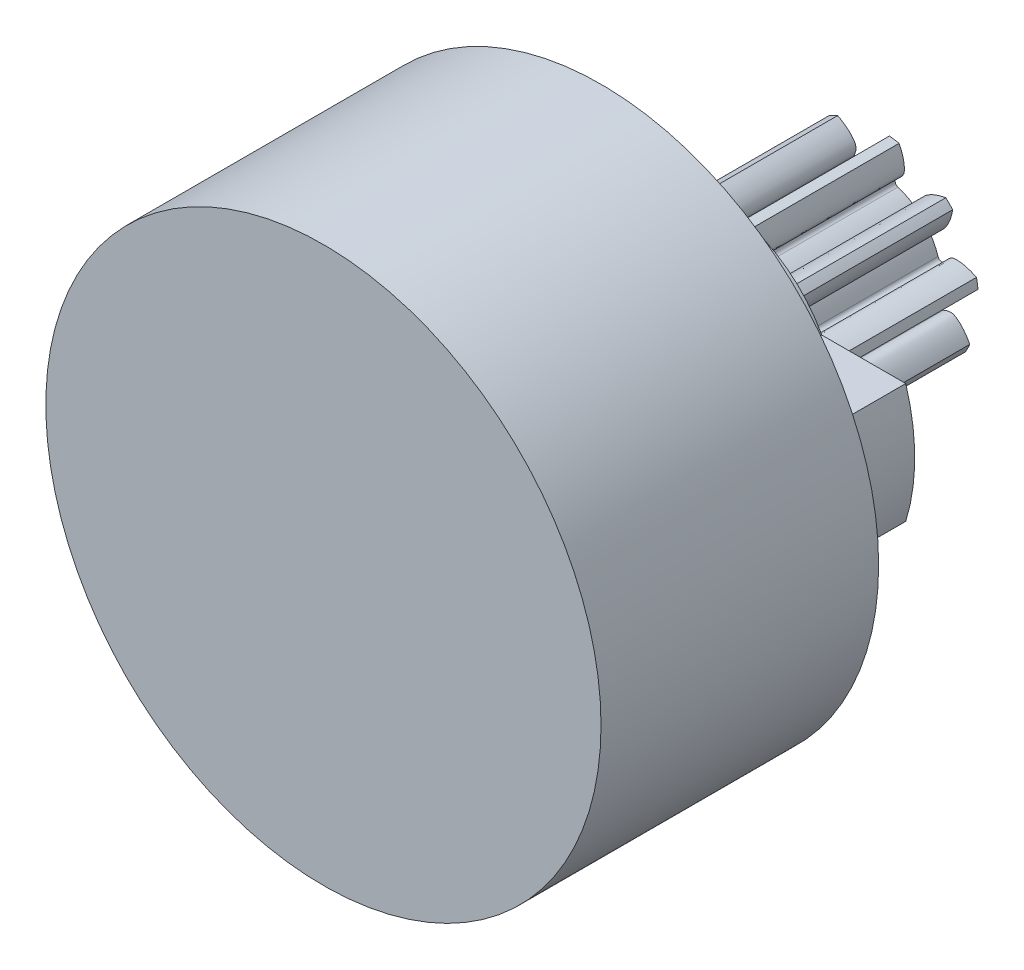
ISO-10303-21;
HEADER;
FILE_DESCRIPTION(('STEP AP214'),'2;1');
FILE_NAME('part.step','',(''),(''),'','','');
FILE_SCHEMA(('AUTOMOTIVE_DESIGN { 1 0 10303 214 1 1 1 1 }'));
ENDSEC;
DATA;
#1=APPLICATION_CONTEXT('core data for automotive mechanical design processes');
#2=APPLICATION_PROTOCOL_DEFINITION('international standard','automotive_design',2000,#1);
#3=PRODUCT_CONTEXT('',#1,'mechanical');
#4=PRODUCT('Part','Part','',(#3));
#5=PRODUCT_RELATED_PRODUCT_CATEGORY('part','',(#4));
#6=PRODUCT_DEFINITION_FORMATION('','',#4);
#7=PRODUCT_DEFINITION_CONTEXT('part definition',#1,'design');
#8=PRODUCT_DEFINITION('design','',#6,#7);
#9=PRODUCT_DEFINITION_SHAPE('','',#8);
#10=(LENGTH_UNIT() NAMED_UNIT(*) SI_UNIT(.MILLI.,.METRE.));
#11=(NAMED_UNIT(*) PLANE_ANGLE_UNIT() SI_UNIT($,.RADIAN.));
#12=(NAMED_UNIT(*) SI_UNIT($,.STERADIAN.) SOLID_ANGLE_UNIT());
#13=UNCERTAINTY_MEASURE_WITH_UNIT(LENGTH_MEASURE(1.E-05),#10,'distance_accuracy_value','');
#14=(GEOMETRIC_REPRESENTATION_CONTEXT(3) GLOBAL_UNCERTAINTY_ASSIGNED_CONTEXT((#13)) GLOBAL_UNIT_ASSIGNED_CONTEXT((#10,
#11,#12)) REPRESENTATION_CONTEXT('',''));
#15=CARTESIAN_POINT('',(0.,0.,0.));
#16=DIRECTION('',(0.,0.,1.));
#17=DIRECTION('',(1.,0.,0.));
#18=AXIS2_PLACEMENT_3D('',#15,#16,#17);
#19=CARTESIAN_POINT('',(0.,0.,5.));
#20=DIRECTION('',(0.,0.,-1.));
#21=DIRECTION('',(-1.,0.,0.));
#22=AXIS2_PLACEMENT_3D('',#19,#20,#21);
#23=CYLINDRICAL_SURFACE('',#22,2.25);
#24=CARTESIAN_POINT('',(0.,0.,5.));
#25=DIRECTION('',(0.,0.,1.));
#26=DIRECTION('',(1.,0.,0.));
#27=AXIS2_PLACEMENT_3D('',#24,#25,#26);
#28=CIRCLE('',#27,2.25);
#29=CARTESIAN_POINT('',(-1.9765816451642,-1.075,5.));
#30=VERTEX_POINT('',#29);
#31=CARTESIAN_POINT('',(1.9765816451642,-1.075,5.));
#32=VERTEX_POINT('',#31);
#33=EDGE_CURVE('E477',#30,#32,#28,.T.);
#34=ORIENTED_EDGE('',*,*,#33,.F.);
#35=DIRECTION('',(0.,0.,-1.));
#36=VECTOR('',#35,1.);
#37=CARTESIAN_POINT('',(-1.9765816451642,-1.075,7.724486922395));
#38=LINE('',#37,#36);
#39=CARTESIAN_POINT('',(-1.9765816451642,-1.075,3.));
#40=VERTEX_POINT('',#39);
#41=EDGE_CURVE('E1424',#30,#40,#38,.T.);
#42=ORIENTED_EDGE('',*,*,#41,.T.);
#43=CARTESIAN_POINT('',(0.,0.,3.));
#44=DIRECTION('',(0.,0.,1.));
#45=DIRECTION('',(1.,0.,0.));
#46=AXIS2_PLACEMENT_3D('',#43,#44,#45);
#47=CIRCLE('',#46,2.25);
#48=CARTESIAN_POINT('',(1.9765816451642,-1.075,3.));
#49=VERTEX_POINT('',#48);
#50=EDGE_CURVE('E57',#40,#49,#47,.T.);
#51=ORIENTED_EDGE('',*,*,#50,.T.);
#52=DIRECTION('',(0.,0.,-1.));
#53=VECTOR('',#52,1.);
#54=CARTESIAN_POINT('',(1.9765816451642,-1.075,7.724486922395));
#55=LINE('',#54,#53);
#56=EDGE_CURVE('E482',#32,#49,#55,.T.);
#57=ORIENTED_EDGE('',*,*,#56,.F.);
#58=EDGE_LOOP('',(#34,#42,#51,#57));
#59=FACE_BOUND('',#58,.T.);
#60=ADVANCED_FACE('F34',(#59),#23,.T.);
#61=CARTESIAN_POINT('',(0.,0.,3.));
#62=DIRECTION('',(0.,0.,-1.));
#63=DIRECTION('',(-1.,0.,0.));
#64=AXIS2_PLACEMENT_3D('',#61,#62,#63);
#65=CYLINDRICAL_SURFACE('',#64,1.125);
#66=CARTESIAN_POINT('',(0.,0.,0.));
#67=DIRECTION('',(0.,0.,1.));
#68=DIRECTION('',(1.,0.,0.));
#69=AXIS2_PLACEMENT_3D('',#66,#67,#68);
#70=CIRCLE('',#69,1.125);
#71=CARTESIAN_POINT('',(0.661405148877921,-0.910037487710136,0.));
#72=VERTEX_POINT('',#71);
#73=CARTESIAN_POINT('',(0.909932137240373,-0.66155007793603,0.));
#74=VERTEX_POINT('',#73);
#75=EDGE_CURVE('E1034',#72,#74,#70,.T.);
#76=ORIENTED_EDGE('',*,*,#75,.T.);
#77=DIRECTION('',(0.,0.,-1.));
#78=VECTOR('',#77,1.);
#79=CARTESIAN_POINT('',(0.909932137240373,-0.66155007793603,3.));
#80=LINE('',#79,#78);
#81=CARTESIAN_POINT('',(0.909932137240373,-0.66155007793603,3.));
#82=VERTEX_POINT('',#81);
#83=EDGE_CURVE('E1022',#74,#82,#80,.F.);
#84=ORIENTED_EDGE('',*,*,#83,.T.);
#85=CARTESIAN_POINT('',(0.,0.,3.));
#86=DIRECTION('',(0.,0.,1.));
#87=DIRECTION('',(1.,0.,0.));
#88=AXIS2_PLACEMENT_3D('',#85,#86,#87);
#89=CIRCLE('',#88,1.125);
#90=CARTESIAN_POINT('',(0.661405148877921,-0.910037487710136,3.));
#91=VERTEX_POINT('',#90);
#92=EDGE_CURVE('E1046',#91,#82,#89,.T.);
#93=ORIENTED_EDGE('',*,*,#92,.F.);
#94=DIRECTION('',(0.,0.,-1.));
#95=VECTOR('',#94,1.);
#96=CARTESIAN_POINT('',(0.661405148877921,-0.910037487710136,3.));
#97=LINE('',#96,#95);
#98=EDGE_CURVE('E994',#91,#72,#97,.T.);
#99=ORIENTED_EDGE('',*,*,#98,.T.);
#100=EDGE_LOOP('',(#76,#84,#93,#99));
#101=FACE_BOUND('',#100,.T.);
#102=ADVANCED_FACE('F1039',(#101),#65,.T.);
#103=CARTESIAN_POINT('',(1.06999461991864,-0.34747160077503,3.));
#104=VERTEX_POINT('',#103);
#105=CARTESIAN_POINT('',(1.12499994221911,-0.000360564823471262,3.));
#106=VERTEX_POINT('',#105);
#107=EDGE_CURVE('E829',#104,#106,#89,.T.);
#108=ORIENTED_EDGE('',*,*,#107,.F.);
#109=DIRECTION('',(0.,0.,-1.));
#110=VECTOR('',#109,1.);
#111=CARTESIAN_POINT('',(1.06999461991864,-0.34747160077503,3.));
#112=LINE('',#111,#110);
#113=CARTESIAN_POINT('',(1.06999461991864,-0.34747160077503,0.));
#114=VERTEX_POINT('',#113);
#115=EDGE_CURVE('E1014',#104,#114,#112,.T.);
#116=ORIENTED_EDGE('',*,*,#115,.T.);
#117=CARTESIAN_POINT('',(1.12499994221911,-0.000360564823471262,0.));
#118=VERTEX_POINT('',#117);
#119=EDGE_CURVE('E823',#114,#118,#70,.T.);
#120=ORIENTED_EDGE('',*,*,#119,.T.);
#121=DIRECTION('',(0.,0.,-1.));
#122=VECTOR('',#121,1.);
#123=CARTESIAN_POINT('',(1.12499994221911,-0.000360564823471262,3.));
#124=LINE('',#123,#122);
#125=EDGE_CURVE('E827',#118,#106,#124,.F.);
#126=ORIENTED_EDGE('',*,*,#125,.T.);
#127=EDGE_LOOP('',(#108,#116,#120,#126));
#128=FACE_BOUND('',#127,.T.);
#129=ADVANCED_FACE('F1061',(#128),#65,.T.);
#130=CARTESIAN_POINT('',(0.000181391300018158,-1.12499998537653,0.));
#131=VERTEX_POINT('',#130);
#132=CARTESIAN_POINT('',(0.347301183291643,-1.07004994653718,0.));
#133=VERTEX_POINT('',#132);
#134=EDGE_CURVE('E1042',#131,#133,#70,.T.);
#135=ORIENTED_EDGE('',*,*,#134,.T.);
#136=DIRECTION('',(0.,0.,-1.));
#137=VECTOR('',#136,1.);
#138=CARTESIAN_POINT('',(0.347301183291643,-1.07004994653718,3.));
#139=LINE('',#138,#137);
#140=CARTESIAN_POINT('',(0.347301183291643,-1.07004994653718,3.));
#141=VERTEX_POINT('',#140);
#142=EDGE_CURVE('E1002',#133,#141,#139,.F.);
#143=ORIENTED_EDGE('',*,*,#142,.T.);
#144=CARTESIAN_POINT('',(0.000181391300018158,-1.12499998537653,3.));
#145=VERTEX_POINT('',#144);
#146=EDGE_CURVE('E1051',#145,#141,#89,.T.);
#147=ORIENTED_EDGE('',*,*,#146,.F.);
#148=DIRECTION('',(0.,0.,-1.));
#149=VECTOR('',#148,1.);
#150=CARTESIAN_POINT('',(0.000181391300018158,-1.12499998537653,3.));
#151=LINE('',#150,#149);
#152=EDGE_CURVE('E974',#145,#131,#151,.T.);
#153=ORIENTED_EDGE('',*,*,#152,.T.);
#154=EDGE_LOOP('',(#135,#143,#147,#153));
#155=FACE_BOUND('',#154,.T.);
#156=ADVANCED_FACE('F1886',(#155),#65,.T.);
#157=CARTESIAN_POINT('',(-0.661111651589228,-0.910250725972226,0.));
#158=VERTEX_POINT('',#157);
#159=CARTESIAN_POINT('',(-0.347987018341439,-1.06982710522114,0.));
#160=VERTEX_POINT('',#159);
#161=EDGE_CURVE('E1951',#158,#160,#70,.T.);
#162=ORIENTED_EDGE('',*,*,#161,.T.);
#163=DIRECTION('',(0.,0.,-1.));
#164=VECTOR('',#163,1.);
#165=CARTESIAN_POINT('',(-0.347987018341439,-1.06982710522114,3.));
#166=LINE('',#165,#164);
#167=CARTESIAN_POINT('',(-0.347987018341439,-1.06982710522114,3.));
#168=VERTEX_POINT('',#167);
#169=EDGE_CURVE('E982',#160,#168,#166,.F.);
#170=ORIENTED_EDGE('',*,*,#169,.T.);
#171=CARTESIAN_POINT('',(-0.661111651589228,-0.910250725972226,3.));
#172=VERTEX_POINT('',#171);
#173=EDGE_CURVE('E1053',#172,#168,#89,.T.);
#174=ORIENTED_EDGE('',*,*,#173,.F.);
#175=DIRECTION('',(0.,0.,-1.));
#176=VECTOR('',#175,1.);
#177=CARTESIAN_POINT('',(-0.661111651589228,-0.910250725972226,3.));
#178=LINE('',#177,#176);
#179=EDGE_CURVE('E954',#172,#158,#178,.T.);
#180=ORIENTED_EDGE('',*,*,#179,.T.);
#181=EDGE_LOOP('',(#162,#170,#174,#180));
#182=FACE_BOUND('',#181,.T.);
#183=ADVANCED_FACE('F1878',(#182),#65,.T.);
#184=CARTESIAN_POINT('',(-1.06988251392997,-0.347816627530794,0.));
#185=VERTEX_POINT('',#184);
#186=CARTESIAN_POINT('',(-0.910356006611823,-0.660966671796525,0.));
#187=VERTEX_POINT('',#186);
#188=EDGE_CURVE('E2016',#185,#187,#70,.T.);
#189=ORIENTED_EDGE('',*,*,#188,.T.);
#190=DIRECTION('',(0.,0.,-1.));
#191=VECTOR('',#190,1.);
#192=CARTESIAN_POINT('',(-0.910356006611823,-0.660966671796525,3.));
#193=LINE('',#192,#191);
#194=CARTESIAN_POINT('',(-0.910356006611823,-0.660966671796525,3.));
#195=VERTEX_POINT('',#194);
#196=EDGE_CURVE('E962',#187,#195,#193,.F.);
#197=ORIENTED_EDGE('',*,*,#196,.T.);
#198=CARTESIAN_POINT('',(-1.06988251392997,-0.347816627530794,3.));
#199=VERTEX_POINT('',#198);
#200=EDGE_CURVE('E1969',#199,#195,#89,.T.);
#201=ORIENTED_EDGE('',*,*,#200,.F.);
#202=DIRECTION('',(0.,0.,-1.));
#203=VECTOR('',#202,1.);
#204=CARTESIAN_POINT('',(-1.06988251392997,-0.347816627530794,3.));
#205=LINE('',#204,#203);
#206=EDGE_CURVE('E934',#199,#185,#205,.T.);
#207=ORIENTED_EDGE('',*,*,#206,.T.);
#208=EDGE_LOOP('',(#189,#197,#201,#207));
#209=FACE_BOUND('',#208,.T.);
#210=ADVANCED_FACE('F1870',(#209),#65,.T.);
#211=CARTESIAN_POINT('',(-1.06999461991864,0.347471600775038,0.));
#212=VERTEX_POINT('',#211);
#213=CARTESIAN_POINT('',(-1.12499994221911,0.000360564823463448,0.));
#214=VERTEX_POINT('',#213);
#215=EDGE_CURVE('E2012',#212,#214,#70,.T.);
#216=ORIENTED_EDGE('',*,*,#215,.T.);
#217=DIRECTION('',(0.,0.,-1.));
#218=VECTOR('',#217,1.);
#219=CARTESIAN_POINT('',(-1.12499994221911,0.000360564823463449,3.));
#220=LINE('',#219,#218);
#221=CARTESIAN_POINT('',(-1.12499994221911,0.000360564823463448,3.));
#222=VERTEX_POINT('',#221);
#223=EDGE_CURVE('E942',#214,#222,#220,.F.);
#224=ORIENTED_EDGE('',*,*,#223,.T.);
#225=CARTESIAN_POINT('',(-1.06999461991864,0.347471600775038,3.));
#226=VERTEX_POINT('',#225);
#227=EDGE_CURVE('E1971',#226,#222,#89,.T.);
#228=ORIENTED_EDGE('',*,*,#227,.F.);
#229=DIRECTION('',(0.,0.,-1.));
#230=VECTOR('',#229,1.);
#231=CARTESIAN_POINT('',(-1.06999461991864,0.347471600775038,3.));
#232=LINE('',#231,#230);
#233=EDGE_CURVE('E914',#226,#212,#232,.T.);
#234=ORIENTED_EDGE('',*,*,#233,.T.);
#235=EDGE_LOOP('',(#216,#224,#228,#234));
#236=FACE_BOUND('',#235,.T.);
#237=ADVANCED_FACE('F1862',(#236),#65,.T.);
#238=CARTESIAN_POINT('',(-0.661405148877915,0.91003748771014,0.));
#239=VERTEX_POINT('',#238);
#240=CARTESIAN_POINT('',(-0.909932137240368,0.661550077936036,0.));
#241=VERTEX_POINT('',#240);
#242=EDGE_CURVE('E2008',#239,#241,#70,.T.);
#243=ORIENTED_EDGE('',*,*,#242,.T.);
#244=DIRECTION('',(0.,0.,-1.));
#245=VECTOR('',#244,1.);
#246=CARTESIAN_POINT('',(-0.909932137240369,0.661550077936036,3.));
#247=LINE('',#246,#245);
#248=CARTESIAN_POINT('',(-0.909932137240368,0.661550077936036,3.));
#249=VERTEX_POINT('',#248);
#250=EDGE_CURVE('E922',#241,#249,#247,.F.);
#251=ORIENTED_EDGE('',*,*,#250,.T.);
#252=CARTESIAN_POINT('',(-0.661405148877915,0.91003748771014,3.));
#253=VERTEX_POINT('',#252);
#254=EDGE_CURVE('E1973',#253,#249,#89,.T.);
#255=ORIENTED_EDGE('',*,*,#254,.F.);
#256=DIRECTION('',(0.,0.,-1.));
#257=VECTOR('',#256,1.);
#258=CARTESIAN_POINT('',(-0.661405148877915,0.91003748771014,3.));
#259=LINE('',#258,#257);
#260=EDGE_CURVE('E894',#253,#239,#259,.T.);
#261=ORIENTED_EDGE('',*,*,#260,.T.);
#262=EDGE_LOOP('',(#243,#251,#255,#261));
#263=FACE_BOUND('',#262,.T.);
#264=ADVANCED_FACE('F1854',(#263),#65,.T.);
#265=CARTESIAN_POINT('',(-0.000181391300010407,1.12499998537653,0.));
#266=VERTEX_POINT('',#265);
#267=CARTESIAN_POINT('',(-0.347301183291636,1.07004994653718,0.));
#268=VERTEX_POINT('',#267);
#269=EDGE_CURVE('E2006',#266,#268,#70,.T.);
#270=ORIENTED_EDGE('',*,*,#269,.T.);
#271=DIRECTION('',(0.,0.,-1.));
#272=VECTOR('',#271,1.);
#273=CARTESIAN_POINT('',(-0.347301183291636,1.07004994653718,3.));
#274=LINE('',#273,#272);
#275=CARTESIAN_POINT('',(-0.347301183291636,1.07004994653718,3.));
#276=VERTEX_POINT('',#275);
#277=EDGE_CURVE('E902',#268,#276,#274,.F.);
#278=ORIENTED_EDGE('',*,*,#277,.T.);
#279=CARTESIAN_POINT('',(-0.000181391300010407,1.12499998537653,3.));
#280=VERTEX_POINT('',#279);
#281=EDGE_CURVE('E1975',#280,#276,#89,.T.);
#282=ORIENTED_EDGE('',*,*,#281,.F.);
#283=DIRECTION('',(0.,0.,-1.));
#284=VECTOR('',#283,1.);
#285=CARTESIAN_POINT('',(-0.000181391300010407,1.12499998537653,3.));
#286=LINE('',#285,#284);
#287=EDGE_CURVE('E874',#280,#266,#286,.T.);
#288=ORIENTED_EDGE('',*,*,#287,.T.);
#289=EDGE_LOOP('',(#270,#278,#282,#288));
#290=FACE_BOUND('',#289,.T.);
#291=ADVANCED_FACE('F1846',(#290),#65,.T.);
#292=CARTESIAN_POINT('',(0.661111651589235,0.910250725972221,0.));
#293=VERTEX_POINT('',#292);
#294=CARTESIAN_POINT('',(0.347987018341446,1.06982710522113,0.));
#295=VERTEX_POINT('',#294);
#296=EDGE_CURVE('E833',#293,#295,#70,.T.);
#297=ORIENTED_EDGE('',*,*,#296,.T.);
#298=DIRECTION('',(0.,0.,-1.));
#299=VECTOR('',#298,1.);
#300=CARTESIAN_POINT('',(0.347987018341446,1.06982710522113,3.));
#301=LINE('',#300,#299);
#302=CARTESIAN_POINT('',(0.347987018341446,1.06982710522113,3.));
#303=VERTEX_POINT('',#302);
#304=EDGE_CURVE('E882',#295,#303,#301,.F.);
#305=ORIENTED_EDGE('',*,*,#304,.T.);
#306=CARTESIAN_POINT('',(0.661111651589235,0.910250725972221,3.));
#307=VERTEX_POINT('',#306);
#308=EDGE_CURVE('E828',#307,#303,#89,.T.);
#309=ORIENTED_EDGE('',*,*,#308,.F.);
#310=DIRECTION('',(0.,0.,-1.));
#311=VECTOR('',#310,1.);
#312=CARTESIAN_POINT('',(0.661111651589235,0.910250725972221,3.));
#313=LINE('',#312,#311);
#314=EDGE_CURVE('E854',#307,#293,#313,.T.);
#315=ORIENTED_EDGE('',*,*,#314,.T.);
#316=EDGE_LOOP('',(#297,#305,#309,#315));
#317=FACE_BOUND('',#316,.T.);
#318=ADVANCED_FACE('F1265',(#317),#65,.T.);
#319=CARTESIAN_POINT('',(1.06988251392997,0.347816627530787,0.));
#320=VERTEX_POINT('',#319);
#321=CARTESIAN_POINT('',(0.910356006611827,0.660966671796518,0.));
#322=VERTEX_POINT('',#321);
#323=EDGE_CURVE('E830',#320,#322,#70,.T.);
#324=ORIENTED_EDGE('',*,*,#323,.T.);
#325=DIRECTION('',(0.,0.,-1.));
#326=VECTOR('',#325,1.);
#327=CARTESIAN_POINT('',(0.910356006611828,0.660966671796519,3.));
#328=LINE('',#327,#326);
#329=CARTESIAN_POINT('',(0.910356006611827,0.660966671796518,3.));
#330=VERTEX_POINT('',#329);
#331=EDGE_CURVE('E862',#322,#330,#328,.F.);
#332=ORIENTED_EDGE('',*,*,#331,.T.);
#333=CARTESIAN_POINT('',(1.06988251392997,0.347816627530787,3.));
#334=VERTEX_POINT('',#333);
#335=EDGE_CURVE('E824',#334,#330,#89,.T.);
#336=ORIENTED_EDGE('',*,*,#335,.F.);
#337=DIRECTION('',(0.,0.,-1.));
#338=VECTOR('',#337,1.);
#339=CARTESIAN_POINT('',(1.06988251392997,0.347816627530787,3.));
#340=LINE('',#339,#338);
#341=EDGE_CURVE('E835',#334,#320,#340,.T.);
#342=ORIENTED_EDGE('',*,*,#341,.T.);
#343=EDGE_LOOP('',(#324,#332,#336,#342));
#344=FACE_BOUND('',#343,.T.);
#345=ADVANCED_FACE('F1261',(#344),#65,.T.);
#346=CARTESIAN_POINT('',(0.,0.,0.));
#347=DIRECTION('',(0.,0.,1.));
#348=DIRECTION('',(1.,0.,0.));
#349=AXIS2_PLACEMENT_3D('',#346,#347,#348);
#350=PLANE('',#349);
#351=CARTESIAN_POINT('',(0.,0.,0.));
#352=DIRECTION('',(0.,0.,1.));
#353=DIRECTION('',(1.,0.,0.));
#354=AXIS2_PLACEMENT_3D('',#351,#352,#353);
#355=CIRCLE('',#354,0.75);
#356=CARTESIAN_POINT('',(0.75,0.,0.));
#357=VERTEX_POINT('',#356);
#358=EDGE_CURVE('E493',#357,#357,#355,.T.);
#359=ORIENTED_EDGE('',*,*,#358,.T.);
#360=EDGE_LOOP('',(#359));
#361=FACE_BOUND('',#360,.T.);
#362=ORIENTED_EDGE('',*,*,#119,.F.);
#363=CARTESIAN_POINT('',(1.14132759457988,-0.370636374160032,0.));
#364=DIRECTION('',(0.,0.,1.));
#365=DIRECTION('',(1.,0.,0.));
#366=AXIS2_PLACEMENT_3D('',#363,#364,#365);
#367=CIRCLE('',#366,0.075);
#368=CARTESIAN_POINT('',(1.16854545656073,-0.440523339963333,0.));
#369=VERTEX_POINT('',#368);
#370=EDGE_CURVE('E1024',#114,#369,#367,.T.);
#371=ORIENTED_EDGE('',*,*,#370,.T.);
#372=CARTESIAN_POINT('',(1.64178016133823,-0.737941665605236,0.));
#373=CARTESIAN_POINT('',(1.6267378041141,-0.710537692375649,0.));
#374=CARTESIAN_POINT('',(1.59727925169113,-0.656870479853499,0.));
#375=CARTESIAN_POINT('',(1.54547396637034,-0.583319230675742,0.));
#376=CARTESIAN_POINT('',(1.48941806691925,-0.518225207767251,0.));
#377=CARTESIAN_POINT('',(1.44202748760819,-0.475179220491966,0.));
#378=CARTESIAN_POINT('',(1.40758647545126,-0.449345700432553,0.));
#379=CARTESIAN_POINT('',(1.38798303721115,-0.436263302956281,0.));
#380=CARTESIAN_POINT('',(1.3678314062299,-0.424954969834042,0.));
#381=CARTESIAN_POINT('',(1.34716866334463,-0.414533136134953,0.));
#382=CARTESIAN_POINT('',(1.32421428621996,-0.411467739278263,0.));
#383=CARTESIAN_POINT('',(1.30122025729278,-0.409572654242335,0.));
#384=CARTESIAN_POINT('',(1.21939301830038,-0.407074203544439,0.));
#385=CARTESIAN_POINT('',(1.13380754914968,-0.470867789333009,0.));
#386=CARTESIAN_POINT('',(1.04680249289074,-0.46306827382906,0.));
#387=CARTESIAN_POINT('',(1.02611260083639,-0.461213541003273,0.));
#388=B_SPLINE_CURVE_WITH_KNOTS('',3,(#372,#373,#374,#375,#376,#377,#378,#379,#380,#381,#382,
#383,#384,#385,#386,#387),.UNSPECIFIED.,.F.,.F.,(4,1,1,1,1,1,1,1,1,1,1,1,1,4),(0.,
0.121255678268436,0.237463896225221,0.348414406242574,0.454127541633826,0.485064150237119,
0.51550132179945,0.54545277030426,0.574931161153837,0.604409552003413,0.634361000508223,
0.664798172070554,0.920288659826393,1.),.UNSPECIFIED.);
#389=CARTESIAN_POINT('',(1.64178016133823,-0.737941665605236,0.));
#390=VERTEX_POINT('',#389);
#391=EDGE_CURVE('E504',#390,#369,#388,.T.);
#392=ORIENTED_EDGE('',*,*,#391,.F.);
#393=CARTESIAN_POINT('',(0.,0.,0.));
#394=DIRECTION('',(0.,0.,1.));
#395=DIRECTION('',(0.809016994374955,-0.587785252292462,0.));
#396=AXIS2_PLACEMENT_3D('',#393,#394,#395);
#397=CIRCLE('',#396,1.8);
#398=CARTESIAN_POINT('',(1.5618790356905,-0.894725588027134,0.));
#399=VERTEX_POINT('',#398);
#400=EDGE_CURVE('E1073',#399,#390,#397,.T.);
#401=ORIENTED_EDGE('',*,*,#400,.F.);
#402=CARTESIAN_POINT('',(0.976174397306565,-0.559203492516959,0.));
#403=CARTESIAN_POINT('',(0.989833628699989,-0.574853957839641,0.));
#404=CARTESIAN_POINT('',(1.04727337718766,-0.640667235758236,0.));
#405=CARTESIAN_POINT('',(1.04595215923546,-0.747404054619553,0.));
#406=CARTESIAN_POINT('',(1.0960599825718,-0.812143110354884,0.));
#407=CARTESIAN_POINT('',(1.11110590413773,-0.829634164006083,0.));
#408=CARTESIAN_POINT('',(1.12707543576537,-0.846405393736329,0.));
#409=CARTESIAN_POINT('',(1.14765044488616,-0.856999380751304,0.));
#410=CARTESIAN_POINT('',(1.1686423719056,-0.866658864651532,0.));
#411=CARTESIAN_POINT('',(1.19074756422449,-0.874832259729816,0.));
#412=CARTESIAN_POINT('',(1.23188922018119,-0.887517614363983,0.));
#413=CARTESIAN_POINT('',(1.29456756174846,-0.900565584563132,0.));
#414=CARTESIAN_POINT('',(1.38017743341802,-0.907668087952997,0.));
#415=CARTESIAN_POINT('',(1.47013223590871,-0.906361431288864,0.));
#416=CARTESIAN_POINT('',(1.53086645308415,-0.898658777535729,0.));
#417=CARTESIAN_POINT('',(1.5618790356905,-0.894725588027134,0.));
#418=B_SPLINE_CURVE_WITH_KNOTS('',3,(#402,#403,#404,#405,#406,#407,#408,#409,#410,#411,#412,
#413,#414,#415,#416,#417),.UNSPECIFIED.,.F.,.F.,(4,1,1,1,1,1,1,1,1,1,1,1,1,4),(0.,
0.0797113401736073,0.335201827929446,0.365638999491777,0.395590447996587,0.425068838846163,
0.454547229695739,0.484498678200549,0.514935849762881,0.545872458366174,0.651585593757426,
0.762536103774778,0.878744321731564,1.),.UNSPECIFIED.);
#419=CARTESIAN_POINT('',(1.04313531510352,-0.686606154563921,0.));
#420=VERTEX_POINT('',#419);
#421=EDGE_CURVE('E496',#420,#399,#418,.T.);
#422=ORIENTED_EDGE('',*,*,#421,.F.);
#423=CARTESIAN_POINT('',(0.970594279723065,-0.705653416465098,0.));
#424=DIRECTION('',(0.,0.,1.));
#425=DIRECTION('',(1.,0.,0.));
#426=AXIS2_PLACEMENT_3D('',#423,#424,#425);
#427=CIRCLE('',#426,0.075);
#428=EDGE_CURVE('E42',#420,#74,#427,.T.);
#429=ORIENTED_EDGE('',*,*,#428,.T.);
#430=ORIENTED_EDGE('',*,*,#75,.F.);
#431=CARTESIAN_POINT('',(0.705498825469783,-0.970706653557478,0.));
#432=DIRECTION('',(0.,0.,1.));
#433=DIRECTION('',(1.,0.,0.));
#434=AXIS2_PLACEMENT_3D('',#431,#432,#433);
#435=CIRCLE('',#434,0.075);
#436=CARTESIAN_POINT('',(0.686440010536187,-1.04324465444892,0.));
#437=VERTEX_POINT('',#436);
#438=EDGE_CURVE('E1004',#72,#437,#435,.T.);
#439=ORIENTED_EDGE('',*,*,#438,.T.);
#440=CARTESIAN_POINT('',(0.894476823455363,-1.56202151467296,0.));
#441=CARTESIAN_POINT('',(0.898414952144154,-1.53100955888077,0.));
#442=CARTESIAN_POINT('',(0.906127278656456,-1.47027656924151,0.));
#443=CARTESIAN_POINT('',(0.907448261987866,-1.38032197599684,0.));
#444=CARTESIAN_POINT('',(0.900359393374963,-1.2947109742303,0.));
#445=CARTESIAN_POINT('',(0.887321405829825,-1.23203055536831,0.));
#446=CARTESIAN_POINT('',(0.874642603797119,-1.19088687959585,0.));
#447=CARTESIAN_POINT('',(0.86647272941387,-1.16878038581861,0.));
#448=CARTESIAN_POINT('',(0.856816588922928,-1.14778692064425,0.));
#449=CARTESIAN_POINT('',(0.846225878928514,-1.12721022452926,0.));
#450=CARTESIAN_POINT('',(0.829457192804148,-1.11123802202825,0.));
#451=CARTESIAN_POINT('',(0.811968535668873,-1.09618931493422,0.));
#452=CARTESIAN_POINT('',(0.747237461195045,-1.04607118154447,0.));
#453=CARTESIAN_POINT('',(0.640500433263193,-1.04737540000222,0.));
#454=CARTESIAN_POINT('',(0.574696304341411,-0.989925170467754,0.));
#455=CARTESIAN_POINT('',(0.559048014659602,-0.976263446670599,0.));
#456=B_SPLINE_CURVE_WITH_KNOTS('',3,(#440,#441,#442,#443,#444,#445,#446,#447,#448,#449,#450,
#451,#452,#453,#454,#455),.UNSPECIFIED.,.F.,.F.,(4,1,1,1,1,1,1,1,1,1,1,1,1,4),(0.,
0.121255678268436,0.237463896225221,0.348414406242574,0.454127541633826,0.485064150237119,
0.51550132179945,0.54545277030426,0.574931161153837,0.604409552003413,0.634361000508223,
0.664798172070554,0.920288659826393,1.),.UNSPECIFIED.);
#457=CARTESIAN_POINT('',(0.894476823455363,-1.56202151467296,0.));
#458=VERTEX_POINT('',#457);
#459=EDGE_CURVE('E547',#458,#437,#456,.T.);
#460=ORIENTED_EDGE('',*,*,#459,.F.);
#461=CARTESIAN_POINT('',(0.,0.,0.));
#462=DIRECTION('',(0.,0.,1.));
#463=DIRECTION('',(0.309016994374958,-0.95105651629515,0.));
#464=AXIS2_PLACEMENT_3D('',#461,#462,#463);
#465=CIRCLE('',#464,1.8);
#466=CARTESIAN_POINT('',(0.73768017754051,-1.64189766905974,0.));
#467=VERTEX_POINT('',#466);
#468=EDGE_CURVE('E541',#467,#458,#465,.T.);
#469=ORIENTED_EDGE('',*,*,#468,.F.);
#470=CARTESIAN_POINT('',(0.461050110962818,-1.02618604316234,0.));
#471=CARTESIAN_POINT('',(0.462901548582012,-1.04687623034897,0.));
#472=CARTESIAN_POINT('',(0.470687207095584,-1.13388252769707,0.));
#473=CARTESIAN_POINT('',(0.406879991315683,-1.21945783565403,0.));
#474=CARTESIAN_POINT('',(0.409365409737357,-1.30128547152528,0.));
#475=CARTESIAN_POINT('',(0.411256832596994,-1.32427980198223,0.));
#476=CARTESIAN_POINT('',(0.414318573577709,-1.3472346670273,0.));
#477=CARTESIAN_POINT('',(0.424737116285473,-1.36789906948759,0.));
#478=CARTESIAN_POINT('',(0.436042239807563,-1.38805250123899,0.));
#479=CARTESIAN_POINT('',(0.4491215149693,-1.4076580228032,0.));
#480=CARTESIAN_POINT('',(0.474949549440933,-1.44210314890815,0.));
#481=CARTESIAN_POINT('',(0.517987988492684,-1.48950058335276,0.));
#482=CARTESIAN_POINT('',(0.583073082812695,-1.54556684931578,0.));
#483=CARTESIAN_POINT('',(0.656616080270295,-1.59738384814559,0.));
#484=CARTESIAN_POINT('',(0.710278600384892,-1.62685094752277,0.));
#485=CARTESIAN_POINT('',(0.73768017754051,-1.64189766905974,0.));
#486=B_SPLINE_CURVE_WITH_KNOTS('',3,(#470,#471,#472,#473,#474,#475,#476,#477,#478,#479,#480,
#481,#482,#483,#484,#485),.UNSPECIFIED.,.F.,.F.,(4,1,1,1,1,1,1,1,1,1,1,1,1,4),(0.,
0.0797113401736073,0.335201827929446,0.365638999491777,0.395590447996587,0.425068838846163,
0.454547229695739,0.484498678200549,0.514935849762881,0.545872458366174,0.651585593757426,
0.762536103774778,0.878744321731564,1.),.UNSPECIFIED.);
#487=CARTESIAN_POINT('',(0.44033722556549,-1.16861560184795,0.));
#488=VERTEX_POINT('',#487);
#489=EDGE_CURVE('E534',#488,#467,#486,.T.);
#490=ORIENTED_EDGE('',*,*,#489,.F.);
#491=CARTESIAN_POINT('',(0.370454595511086,-1.14138660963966,0.));
#492=DIRECTION('',(0.,0.,1.));
#493=DIRECTION('',(1.,0.,0.));
#494=AXIS2_PLACEMENT_3D('',#491,#492,#493);
#495=CIRCLE('',#494,0.075);
#496=EDGE_CURVE('E1009',#488,#133,#495,.T.);
#497=ORIENTED_EDGE('',*,*,#496,.T.);
#498=ORIENTED_EDGE('',*,*,#134,.F.);
#499=CARTESIAN_POINT('',(0.000193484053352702,-1.19999998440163,0.));
#500=DIRECTION('',(0.,0.,1.));
#501=DIRECTION('',(1.,0.,0.));
#502=AXIS2_PLACEMENT_3D('',#499,#500,#501);
#503=CIRCLE('',#502,0.075);
#504=CARTESIAN_POINT('',(-0.0578621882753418,-1.24748196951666,0.));
#505=VERTEX_POINT('',#504);
#506=EDGE_CURVE('E984',#131,#505,#503,.T.);
#507=ORIENTED_EDGE('',*,*,#506,.T.);
#508=CARTESIAN_POINT('',(-0.194486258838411,-1.7894622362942,0.));
#509=CARTESIAN_POINT('',(-0.173071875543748,-1.76668781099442,0.));
#510=CARTESIAN_POINT('',(-0.131134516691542,-1.72208698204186,0.));
#511=CARTESIAN_POINT('',(-0.077191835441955,-1.65008864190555,0.));
#512=CARTESIAN_POINT('',(-0.0326059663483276,-1.57666115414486,0.));
#513=CARTESIAN_POINT('',(-0.00631129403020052,-1.51828809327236,0.));
#514=CARTESIAN_POINT('',(0.00761498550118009,-1.47754974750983,0.));
#515=CARTESIAN_POINT('',(0.0139992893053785,-1.45486308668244,0.));
#516=CARTESIAN_POINT('',(0.0185269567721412,-1.43220327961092,0.));
#517=CARTESIAN_POINT('',(0.0220535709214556,-1.40933131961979,0.));
#518=CARTESIAN_POINT('',(0.017875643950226,-1.38655314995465,0.));
#519=CARTESIAN_POINT('',(0.0125724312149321,-1.3640989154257,0.));
#520=CARTESIAN_POINT('',(-0.0103374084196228,-1.28550452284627,0.));
#521=CARTESIAN_POINT('',(-0.0974560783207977,-1.2238212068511,0.));
#522=CARTESIAN_POINT('',(-0.116924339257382,-1.1386642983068,0.));
#523=CARTESIAN_POINT('',(-0.121553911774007,-1.11841389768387,0.));
#524=B_SPLINE_CURVE_WITH_KNOTS('',3,(#508,#509,#510,#511,#512,#513,#514,#515,#516,#517,#518,
#519,#520,#521,#522,#523),.UNSPECIFIED.,.F.,.F.,(4,1,1,1,1,1,1,1,1,1,1,1,1,4),(0.,
0.121255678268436,0.237463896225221,0.348414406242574,0.454127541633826,0.485064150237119,
0.51550132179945,0.54545277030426,0.574931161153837,0.604409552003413,0.634361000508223,
0.664798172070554,0.920288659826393,1.),.UNSPECIFIED.);
#525=CARTESIAN_POINT('',(-0.194486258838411,-1.7894622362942,0.));
#526=VERTEX_POINT('',#525);
#527=EDGE_CURVE('E569',#526,#505,#524,.T.);
#528=ORIENTED_EDGE('',*,*,#527,.F.);
#529=CARTESIAN_POINT('',(0.,0.,0.));
#530=DIRECTION('',(0.,0.,1.));
#531=DIRECTION('',(-0.309016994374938,-0.951056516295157,0.));
#532=AXIS2_PLACEMENT_3D('',#529,#530,#531);
#533=CIRCLE('',#532,1.8);
#534=CARTESIAN_POINT('',(-0.368287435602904,-1.76192064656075,0.));
#535=VERTEX_POINT('',#534);
#536=EDGE_CURVE('E1112',#535,#526,#533,.T.);
#537=ORIENTED_EDGE('',*,*,#536,.F.);
#538=CARTESIAN_POINT('',(-0.230179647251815,-1.10120040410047,0.));
#539=CARTESIAN_POINT('',(-0.240843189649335,-1.11902736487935,0.));
#540=CARTESIAN_POINT('',(-0.285685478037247,-1.19399323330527,0.));
#541=CARTESIAN_POINT('',(-0.387606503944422,-1.22572017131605,0.));
#542=CARTESIAN_POINT('',(-0.433692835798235,-1.29338101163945,0.));
#543=CARTESIAN_POINT('',(-0.445678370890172,-1.31309556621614,0.));
#544=CARTESIAN_POINT('',(-0.456693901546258,-1.33346608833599,0.));
#545=CARTESIAN_POINT('',(-0.460411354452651,-1.35630780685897,0.));
#546=CARTESIAN_POINT('',(-0.463111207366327,-1.37925726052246,0.));
#547=CARTESIAN_POINT('',(-0.464053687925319,-1.40280626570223,0.));
#548=CARTESIAN_POINT('',(-0.463404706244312,-1.44585429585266,0.));
#549=CARTESIAN_POINT('',(-0.456445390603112,-1.50949698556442,0.));
#550=CARTESIAN_POINT('',(-0.4367453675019,-1.59311160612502,0.));
#551=CARTESIAN_POINT('',(-0.40770510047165,-1.67825992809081,0.));
#552=CARTESIAN_POINT('',(-0.381611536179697,-1.73364135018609,0.));
#553=CARTESIAN_POINT('',(-0.368287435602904,-1.76192064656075,0.));
#554=B_SPLINE_CURVE_WITH_KNOTS('',3,(#538,#539,#540,#541,#542,#543,#544,#545,#546,#547,#548,
#549,#550,#551,#552,#553),.UNSPECIFIED.,.F.,.F.,(4,1,1,1,1,1,1,1,1,1,1,1,1,4),(0.,
0.0797113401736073,0.335201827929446,0.365638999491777,0.395590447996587,0.425068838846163,
0.454547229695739,0.484498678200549,0.514935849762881,0.545872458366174,0.651585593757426,
0.762536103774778,0.878744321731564,1.),.UNSPECIFIED.);
#555=CARTESIAN_POINT('',(-0.330654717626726,-1.20425360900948,0.));
#556=VERTEX_POINT('',#555);
#557=EDGE_CURVE('E561',#556,#535,#554,.T.);
#558=ORIENTED_EDGE('',*,*,#557,.F.);
#559=CARTESIAN_POINT('',(-0.371186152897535,-1.14114891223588,0.));
#560=DIRECTION('',(0.,0.,1.));
#561=DIRECTION('',(1.,0.,0.));
#562=AXIS2_PLACEMENT_3D('',#559,#560,#561);
#563=CIRCLE('',#562,0.075);
#564=EDGE_CURVE('E989',#556,#160,#563,.T.);
#565=ORIENTED_EDGE('',*,*,#564,.T.);
#566=ORIENTED_EDGE('',*,*,#161,.F.);
#567=CARTESIAN_POINT('',(-0.705185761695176,-0.970934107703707,0.));
#568=DIRECTION('',(0.,0.,1.));
#569=DIRECTION('',(1.,0.,0.));
#570=AXIS2_PLACEMENT_3D('',#567,#568,#569);
#571=CIRCLE('',#570,0.075);
#572=CARTESIAN_POINT('',(-0.780062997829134,-0.975223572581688,0.));
#573=VERTEX_POINT('',#572);
#574=EDGE_CURVE('E964',#158,#573,#571,.T.);
#575=ORIENTED_EDGE('',*,*,#574,.T.);
#576=CARTESIAN_POINT('',(-1.20916220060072,-1.33338920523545,0.));
#577=CARTESIAN_POINT('',(-1.17845112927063,-1.32755136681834,0.));
#578=CARTESIAN_POINT('',(-1.11830738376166,-1.31611869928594,0.));
#579=CARTESIAN_POINT('',(-1.03234727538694,-1.2895775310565,0.));
#580=CARTESIAN_POINT('',(-0.953116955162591,-1.25638036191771,0.));
#581=CARTESIAN_POINT('',(-0.897533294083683,-1.22461118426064,0.));
#582=CARTESIAN_POINT('',(-0.86232129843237,-1.19983883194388,0.));
#583=CARTESIAN_POINT('',(-0.843821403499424,-1.18523753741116,0.));
#584=CARTESIAN_POINT('',(-0.826839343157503,-1.1695666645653,0.));
#585=CARTESIAN_POINT('',(-0.810542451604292,-1.1531357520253,0.));
#586=CARTESIAN_POINT('',(-0.80053379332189,-1.1322521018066,0.));
#587=CARTESIAN_POINT('',(-0.791625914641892,-1.11096909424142,0.));
#588=CARTESIAN_POINT('',(-0.763963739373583,-1.03391882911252,0.));
#589=CARTESIAN_POINT('',(-0.798187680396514,-0.932808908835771,0.));
#590=CARTESIAN_POINT('',(-0.763883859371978,-0.852472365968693,0.));
#591=CARTESIAN_POINT('',(-0.75572637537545,-0.833368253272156,0.));
#592=B_SPLINE_CURVE_WITH_KNOTS('',3,(#576,#577,#578,#579,#580,#581,#582,#583,#584,#585,#586,
#587,#588,#589,#590,#591),.UNSPECIFIED.,.F.,.F.,(4,1,1,1,1,1,1,1,1,1,1,1,1,4),(0.,
0.121255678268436,0.237463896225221,0.348414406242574,0.454127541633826,0.485064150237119,
0.51550132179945,0.54545277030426,0.574931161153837,0.604409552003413,0.634361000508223,
0.664798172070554,0.920288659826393,1.),.UNSPECIFIED.);
#593=CARTESIAN_POINT('',(-1.20916220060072,-1.33338920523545,0.));
#594=VERTEX_POINT('',#593);
#595=EDGE_CURVE('E612',#594,#573,#592,.T.);
#596=ORIENTED_EDGE('',*,*,#595,.F.);
#597=CARTESIAN_POINT('',(0.,0.,0.));
#598=DIRECTION('',(0.,0.,1.));
#599=DIRECTION('',(-0.809016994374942,-0.58778525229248,0.));
#600=AXIS2_PLACEMENT_3D('',#597,#598,#599);
#601=CIRCLE('',#600,1.8);
#602=CARTESIAN_POINT('',(-1.33358176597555,-1.20894982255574,0.));
#603=VERTEX_POINT('',#602);
#604=EDGE_CURVE('E606',#603,#594,#601,.T.);
#605=ORIENTED_EDGE('',*,*,#604,.F.);
#606=CARTESIAN_POINT('',(-0.833488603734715,-0.755593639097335,0.));
#607=CARTESIAN_POINT('',(-0.852594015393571,-0.76374808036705,0.));
#608=CARTESIAN_POINT('',(-0.932936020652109,-0.798039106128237,0.));
#609=CARTESIAN_POINT('',(-1.03404048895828,-0.763799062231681,0.));
#610=CARTESIAN_POINT('',(-1.11109515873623,-0.791448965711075,0.));
#611=CARTESIAN_POINT('',(-1.13237958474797,-0.800353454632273,0.));
#612=CARTESIAN_POINT('',(-1.15326482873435,-0.810358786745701,0.));
#613=CARTESIAN_POINT('',(-1.16969833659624,-0.826653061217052,0.));
#614=CARTESIAN_POINT('',(-1.18537191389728,-0.843632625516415,0.));
#615=CARTESIAN_POINT('',(-1.1999761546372,-0.862130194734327,0.));
#616=CARTESIAN_POINT('',(-1.22475411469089,-0.897338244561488,0.));
#617=CARTESIAN_POINT('',(-1.25653214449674,-0.952916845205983,0.));
#618=CARTESIAN_POINT('',(-1.28974193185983,-1.03214187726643,0.));
#619=CARTESIAN_POINT('',(-1.31629679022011,-1.11809775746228,0.));
#620=CARTESIAN_POINT('',(-1.3277390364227,-1.17823968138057,0.));
#621=CARTESIAN_POINT('',(-1.33358176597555,-1.20894982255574,0.));
#622=B_SPLINE_CURVE_WITH_KNOTS('',3,(#606,#607,#608,#609,#610,#611,#612,#613,#614,#615,#616,
#617,#618,#619,#620,#621),.UNSPECIFIED.,.F.,.F.,(4,1,1,1,1,1,1,1,1,1,1,1,1,4),(0.,
0.0797113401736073,0.335201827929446,0.365638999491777,0.395590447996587,0.425068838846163,
0.454547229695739,0.484498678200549,0.514935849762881,0.545872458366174,0.651585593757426,
0.762536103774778,0.878744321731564,1.),.UNSPECIFIED.);
#623=CARTESIAN_POINT('',(-0.97534779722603,-0.77990766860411,0.));
#624=VERTEX_POINT('',#623);
#625=EDGE_CURVE('E599',#624,#603,#622,.T.);
#626=ORIENTED_EDGE('',*,*,#625,.F.);
#627=CARTESIAN_POINT('',(-0.971046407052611,-0.70503111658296,0.));
#628=DIRECTION('',(0.,0.,1.));
#629=DIRECTION('',(1.,0.,0.));
#630=AXIS2_PLACEMENT_3D('',#627,#628,#629);
#631=CIRCLE('',#630,0.075);
#632=EDGE_CURVE('E969',#624,#187,#631,.T.);
#633=ORIENTED_EDGE('',*,*,#632,.T.);
#634=ORIENTED_EDGE('',*,*,#188,.F.);
#635=CARTESIAN_POINT('',(-1.14120801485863,-0.371004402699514,0.));
#636=DIRECTION('',(0.,0.,1.));
#637=DIRECTION('',(1.,0.,0.));
#638=AXIS2_PLACEMENT_3D('',#635,#636,#637);
#639=CIRCLE('',#638,0.075);
#640=CARTESIAN_POINT('',(-1.20430625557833,-0.330462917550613,0.));
#641=VERTEX_POINT('',#640);
#642=EDGE_CURVE('E944',#185,#641,#639,.T.);
#643=ORIENTED_EDGE('',*,*,#642,.T.);
#644=CARTESIAN_POINT('',(-1.76197927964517,-0.368006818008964,0.));
#645=CARTESIAN_POINT('',(-1.73370210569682,-0.38133542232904,0.));
#646=CARTESIAN_POINT('',(-1.6783248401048,-0.407437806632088,0.));
#647=CARTESIAN_POINT('',(-1.59318114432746,-0.436491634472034,0.));
#648=CARTESIAN_POINT('',(-1.50956966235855,-0.456204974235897,0.));
#649=CARTESIAN_POINT('',(-1.44592808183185,-0.463174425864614,0.));
#650=CARTESIAN_POINT('',(-1.4028801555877,-0.463830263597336,0.));
#651=CARTESIAN_POINT('',(-1.37933100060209,-0.462891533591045,0.));
#652=CARTESIAN_POINT('',(-1.35638111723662,-0.46019533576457,0.));
#653=CARTESIAN_POINT('',(-1.33353880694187,-0.45648152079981,0.));
#654=CARTESIAN_POINT('',(-1.31316653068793,-0.445469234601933,0.));
#655=CARTESIAN_POINT('',(-1.29345006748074,-0.433486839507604,0.));
#656=CARTESIAN_POINT('',(-1.2257818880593,-0.387411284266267,0.));
#657=CARTESIAN_POINT('',(-1.1940387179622,-0.285495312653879,0.));
#658=CARTESIAN_POINT('',(-1.11906570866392,-0.240664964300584,0.));
#659=CARTESIAN_POINT('',(-1.10123704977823,-0.230004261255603,0.));
#660=B_SPLINE_CURVE_WITH_KNOTS('',3,(#644,#645,#646,#647,#648,#649,#650,#651,#652,#653,#654,
#655,#656,#657,#658,#659),.UNSPECIFIED.,.F.,.F.,(4,1,1,1,1,1,1,1,1,1,1,1,1,4),(0.,
0.121255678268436,0.237463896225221,0.348414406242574,0.454127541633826,0.485064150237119,
0.51550132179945,0.54545277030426,0.574931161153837,0.604409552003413,0.634361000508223,
0.664798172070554,0.920288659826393,1.),.UNSPECIFIED.);
#661=CARTESIAN_POINT('',(-1.76197927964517,-0.368006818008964,0.));
#662=VERTEX_POINT('',#661);
#663=EDGE_CURVE('E634',#662,#641,#660,.T.);
#664=ORIENTED_EDGE('',*,*,#663,.F.);
#665=CARTESIAN_POINT('',(0.,0.,0.));
#666=DIRECTION('',(0.,0.,1.));
#667=DIRECTION('',(-1.,0.,0.));
#668=AXIS2_PLACEMENT_3D('',#665,#666,#667);
#669=CIRCLE('',#668,1.8);
#670=CARTESIAN_POINT('',(-1.78949318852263,-0.194201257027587,0.));
#671=VERTEX_POINT('',#670);
#672=EDGE_CURVE('E1153',#671,#662,#669,.T.);
#673=ORIENTED_EDGE('',*,*,#672,.F.);
#674=CARTESIAN_POINT('',(-1.11843324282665,-0.121375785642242,0.));
#675=CARTESIAN_POINT('',(-1.13868290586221,-0.116742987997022,0.));
#676=CARTESIAN_POINT('',(-1.22383671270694,-0.0972611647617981,0.));
#677=CARTESIAN_POINT('',(-1.28550615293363,-0.0101326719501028,0.));
#678=CARTESIAN_POINT('',(-1.36409689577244,0.0127896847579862,0.));
#679=CARTESIAN_POINT('',(-1.38655028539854,0.0180964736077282,0.));
#680=CARTESIAN_POINT('',(-1.40932778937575,0.0222780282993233,0.));
#681=CARTESIAN_POINT('',(-1.43220031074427,0.0187550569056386,0.));
#682=CARTESIAN_POINT('',(-1.45486083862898,0.014230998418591,0.));
#683=CARTESIAN_POINT('',(-1.47754851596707,0.00785030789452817,0.));
#684=CARTESIAN_POINT('',(-1.51828907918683,-0.00606948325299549,0.));
#685=CARTESIAN_POINT('',(-1.57666632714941,-0.0323548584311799,0.));
#686=CARTESIAN_POINT('',(-1.65010091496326,-0.0769290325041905,0.));
#687=CARTESIAN_POINT('',(-1.72210784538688,-0.130860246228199,0.));
#688=CARTESIAN_POINT('',(-1.76671535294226,-0.172790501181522,0.));
#689=CARTESIAN_POINT('',(-1.78949318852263,-0.194201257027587,0.));
#690=B_SPLINE_CURVE_WITH_KNOTS('',3,(#674,#675,#676,#677,#678,#679,#680,#681,#682,#683,#684,
#685,#686,#687,#688,#689),.UNSPECIFIED.,.F.,.F.,(4,1,1,1,1,1,1,1,1,1,1,1,1,4),(0.,
0.0797113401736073,0.335201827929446,0.365638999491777,0.395590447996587,0.425068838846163,
0.454547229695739,0.484498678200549,0.514935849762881,0.545872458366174,0.651585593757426,
0.762536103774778,0.878744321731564,1.),.UNSPECIFIED.);
#691=CARTESIAN_POINT('',(-1.24749116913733,-0.0576635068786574,0.));
#692=VERTEX_POINT('',#691);
#693=EDGE_CURVE('E626',#692,#671,#690,.T.);
#694=ORIENTED_EDGE('',*,*,#693,.F.);
#695=CARTESIAN_POINT('',(-1.19999993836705,0.000384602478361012,0.));
#696=DIRECTION('',(0.,0.,1.));
#697=DIRECTION('',(1.,0.,0.));
#698=AXIS2_PLACEMENT_3D('',#695,#696,#697);
#699=CIRCLE('',#698,0.075);
#700=EDGE_CURVE('E949',#692,#214,#699,.T.);
#701=ORIENTED_EDGE('',*,*,#700,.T.);
#702=ORIENTED_EDGE('',*,*,#215,.F.);
#703=CARTESIAN_POINT('',(-1.14132759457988,0.370636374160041,0.));
#704=DIRECTION('',(0.,0.,1.));
#705=DIRECTION('',(1.,0.,0.));
#706=AXIS2_PLACEMENT_3D('',#703,#704,#705);
#707=CIRCLE('',#706,0.075);
#708=CARTESIAN_POINT('',(-1.16854545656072,0.440523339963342,0.));
#709=VERTEX_POINT('',#708);
#710=EDGE_CURVE('E924',#212,#709,#707,.T.);
#711=ORIENTED_EDGE('',*,*,#710,.T.);
#712=CARTESIAN_POINT('',(-1.64178016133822,0.737941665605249,0.));
#713=CARTESIAN_POINT('',(-1.62673780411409,0.710537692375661,0.));
#714=CARTESIAN_POINT('',(-1.59727925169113,0.656870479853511,0.));
#715=CARTESIAN_POINT('',(-1.54547396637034,0.583319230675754,0.));
#716=CARTESIAN_POINT('',(-1.48941806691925,0.518225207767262,0.));
#717=CARTESIAN_POINT('',(-1.44202748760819,0.475179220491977,0.));
#718=CARTESIAN_POINT('',(-1.40758647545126,0.449345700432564,0.));
#719=CARTESIAN_POINT('',(-1.38798303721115,0.436263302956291,0.));
#720=CARTESIAN_POINT('',(-1.3678314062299,0.424954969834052,0.));
#721=CARTESIAN_POINT('',(-1.34716866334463,0.414533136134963,0.));
#722=CARTESIAN_POINT('',(-1.32421428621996,0.411467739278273,0.));
#723=CARTESIAN_POINT('',(-1.30122025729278,0.409572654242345,0.));
#724=CARTESIAN_POINT('',(-1.21939301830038,0.407074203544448,0.));
#725=CARTESIAN_POINT('',(-1.13380754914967,0.470867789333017,0.));
#726=CARTESIAN_POINT('',(-1.04680249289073,0.463068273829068,0.));
#727=CARTESIAN_POINT('',(-1.02611260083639,0.46121354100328,0.));
#728=B_SPLINE_CURVE_WITH_KNOTS('',3,(#712,#713,#714,#715,#716,#717,#718,#719,#720,#721,#722,
#723,#724,#725,#726,#727),.UNSPECIFIED.,.F.,.F.,(4,1,1,1,1,1,1,1,1,1,1,1,1,4),(0.,
0.121255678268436,0.237463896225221,0.348414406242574,0.454127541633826,0.485064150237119,
0.51550132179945,0.54545277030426,0.574931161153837,0.604409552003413,0.634361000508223,
0.664798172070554,0.920288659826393,1.),.UNSPECIFIED.);
#729=CARTESIAN_POINT('',(-1.64178016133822,0.737941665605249,0.));
#730=VERTEX_POINT('',#729);
#731=EDGE_CURVE('E677',#730,#709,#728,.T.);
#732=ORIENTED_EDGE('',*,*,#731,.F.);
#733=CARTESIAN_POINT('',(0.,0.,0.));
#734=DIRECTION('',(0.,0.,1.));
#735=DIRECTION('',(-0.809016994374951,0.587785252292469,0.));
#736=AXIS2_PLACEMENT_3D('',#733,#734,#735);
#737=CIRCLE('',#736,1.8);
#738=CARTESIAN_POINT('',(-1.5618790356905,0.894725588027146,0.));
#739=VERTEX_POINT('',#738);
#740=EDGE_CURVE('E671',#739,#730,#737,.T.);
#741=ORIENTED_EDGE('',*,*,#740,.F.);
#742=CARTESIAN_POINT('',(-0.976174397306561,0.559203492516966,0.));
#743=CARTESIAN_POINT('',(-0.989833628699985,0.574853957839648,0.));
#744=CARTESIAN_POINT('',(-1.04727337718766,0.640667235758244,0.));
#745=CARTESIAN_POINT('',(-1.04595215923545,0.747404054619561,0.));
#746=CARTESIAN_POINT('',(-1.0960599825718,0.812143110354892,0.));
#747=CARTESIAN_POINT('',(-1.11110590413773,0.829634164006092,0.));
#748=CARTESIAN_POINT('',(-1.12707543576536,0.846405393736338,0.));
#749=CARTESIAN_POINT('',(-1.14765044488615,0.856999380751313,0.));
#750=CARTESIAN_POINT('',(-1.16864237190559,0.866658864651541,0.));
#751=CARTESIAN_POINT('',(-1.19074756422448,0.874832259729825,0.));
#752=CARTESIAN_POINT('',(-1.23188922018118,0.887517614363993,0.));
#753=CARTESIAN_POINT('',(-1.29456756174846,0.900565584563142,0.));
#754=CARTESIAN_POINT('',(-1.38017743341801,0.907668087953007,0.));
#755=CARTESIAN_POINT('',(-1.47013223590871,0.906361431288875,0.));
#756=CARTESIAN_POINT('',(-1.53086645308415,0.898658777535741,0.));
#757=CARTESIAN_POINT('',(-1.5618790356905,0.894725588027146,0.));
#758=B_SPLINE_CURVE_WITH_KNOTS('',3,(#742,#743,#744,#745,#746,#747,#748,#749,#750,#751,#752,
#753,#754,#755,#756,#757),.UNSPECIFIED.,.F.,.F.,(4,1,1,1,1,1,1,1,1,1,1,1,1,4),(0.,
0.0797113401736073,0.335201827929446,0.365638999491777,0.395590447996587,0.425068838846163,
0.454547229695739,0.484498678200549,0.514935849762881,0.545872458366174,0.651585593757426,
0.762536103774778,0.878744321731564,1.),.UNSPECIFIED.);
#759=CARTESIAN_POINT('',(-1.04313531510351,0.686606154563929,0.));
#760=VERTEX_POINT('',#759);
#761=EDGE_CURVE('E664',#760,#739,#758,.T.);
#762=ORIENTED_EDGE('',*,*,#761,.F.);
#763=CARTESIAN_POINT('',(-0.97059427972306,0.705653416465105,0.));
#764=DIRECTION('',(0.,0.,1.));
#765=DIRECTION('',(1.,0.,0.));
#766=AXIS2_PLACEMENT_3D('',#763,#764,#765);
#767=CIRCLE('',#766,0.075);
#768=EDGE_CURVE('E929',#760,#241,#767,.T.);
#769=ORIENTED_EDGE('',*,*,#768,.T.);
#770=ORIENTED_EDGE('',*,*,#242,.F.);
#771=CARTESIAN_POINT('',(-0.705498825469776,0.970706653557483,0.));
#772=DIRECTION('',(0.,0.,1.));
#773=DIRECTION('',(1.,0.,0.));
#774=AXIS2_PLACEMENT_3D('',#771,#772,#773);
#775=CIRCLE('',#774,0.075);
#776=CARTESIAN_POINT('',(-0.68644001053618,1.04324465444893,0.));
#777=VERTEX_POINT('',#776);
#778=EDGE_CURVE('E904',#239,#777,#775,.T.);
#779=ORIENTED_EDGE('',*,*,#778,.T.);
#780=CARTESIAN_POINT('',(-0.894476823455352,1.56202151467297,0.));
#781=CARTESIAN_POINT('',(-0.898414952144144,1.53100955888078,0.));
#782=CARTESIAN_POINT('',(-0.906127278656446,1.47027656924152,0.));
#783=CARTESIAN_POINT('',(-0.907448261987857,1.38032197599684,0.));
#784=CARTESIAN_POINT('',(-0.900359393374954,1.2947109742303,0.));
#785=CARTESIAN_POINT('',(-0.887321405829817,1.23203055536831,0.));
#786=CARTESIAN_POINT('',(-0.874642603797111,1.19088687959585,0.));
#787=CARTESIAN_POINT('',(-0.866472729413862,1.16878038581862,0.));
#788=CARTESIAN_POINT('',(-0.85681658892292,1.14778692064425,0.));
#789=CARTESIAN_POINT('',(-0.846225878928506,1.12721022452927,0.));
#790=CARTESIAN_POINT('',(-0.829457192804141,1.11123802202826,0.));
#791=CARTESIAN_POINT('',(-0.811968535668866,1.09618931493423,0.));
#792=CARTESIAN_POINT('',(-0.747237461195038,1.04607118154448,0.));
#793=CARTESIAN_POINT('',(-0.640500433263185,1.04737540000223,0.));
#794=CARTESIAN_POINT('',(-0.574696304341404,0.989925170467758,0.));
#795=CARTESIAN_POINT('',(-0.559048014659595,0.976263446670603,0.));
#796=B_SPLINE_CURVE_WITH_KNOTS('',3,(#780,#781,#782,#783,#784,#785,#786,#787,#788,#789,#790,
#791,#792,#793,#794,#795),.UNSPECIFIED.,.F.,.F.,(4,1,1,1,1,1,1,1,1,1,1,1,1,4),(0.,
0.121255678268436,0.237463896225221,0.348414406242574,0.454127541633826,0.485064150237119,
0.51550132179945,0.54545277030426,0.574931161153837,0.604409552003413,0.634361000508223,
0.664798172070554,0.920288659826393,1.),.UNSPECIFIED.);
#797=CARTESIAN_POINT('',(-0.894476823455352,1.56202151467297,0.));
#798=VERTEX_POINT('',#797);
#799=EDGE_CURVE('E699',#798,#777,#796,.T.);
#800=ORIENTED_EDGE('',*,*,#799,.F.);
#801=CARTESIAN_POINT('',(0.,0.,0.));
#802=DIRECTION('',(0.,0.,1.));
#803=DIRECTION('',(-0.309016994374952,0.951056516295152,0.));
#804=AXIS2_PLACEMENT_3D('',#801,#802,#803);
#805=CIRCLE('',#804,1.8);
#806=CARTESIAN_POINT('',(-0.737680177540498,1.64189766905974,0.));
#807=VERTEX_POINT('',#806);
#808=EDGE_CURVE('E1194',#807,#798,#805,.T.);
#809=ORIENTED_EDGE('',*,*,#808,.F.);
#810=CARTESIAN_POINT('',(-0.461050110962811,1.02618604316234,0.));
#811=CARTESIAN_POINT('',(-0.462901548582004,1.04687623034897,0.));
#812=CARTESIAN_POINT('',(-0.470687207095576,1.13388252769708,0.));
#813=CARTESIAN_POINT('',(-0.406879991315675,1.21945783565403,0.));
#814=CARTESIAN_POINT('',(-0.409365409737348,1.30128547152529,0.));
#815=CARTESIAN_POINT('',(-0.411256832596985,1.32427980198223,0.));
#816=CARTESIAN_POINT('',(-0.4143185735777,1.34723466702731,0.));
#817=CARTESIAN_POINT('',(-0.424737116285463,1.3678990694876,0.));
#818=CARTESIAN_POINT('',(-0.436042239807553,1.388052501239,0.));
#819=CARTESIAN_POINT('',(-0.44912151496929,1.4076580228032,0.));
#820=CARTESIAN_POINT('',(-0.474949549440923,1.44210314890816,0.));
#821=CARTESIAN_POINT('',(-0.517987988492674,1.48950058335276,0.));
#822=CARTESIAN_POINT('',(-0.583073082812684,1.54556684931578,0.));
#823=CARTESIAN_POINT('',(-0.656616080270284,1.5973838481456,0.));
#824=CARTESIAN_POINT('',(-0.71027860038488,1.62685094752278,0.));
#825=CARTESIAN_POINT('',(-0.737680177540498,1.64189766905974,0.));
#826=B_SPLINE_CURVE_WITH_KNOTS('',3,(#810,#811,#812,#813,#814,#815,#816,#817,#818,#819,#820,
#821,#822,#823,#824,#825),.UNSPECIFIED.,.F.,.F.,(4,1,1,1,1,1,1,1,1,1,1,1,1,4),(0.,
0.0797113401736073,0.335201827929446,0.365638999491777,0.395590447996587,0.425068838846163,
0.454547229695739,0.484498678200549,0.514935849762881,0.545872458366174,0.651585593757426,
0.762536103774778,0.878744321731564,1.),.UNSPECIFIED.);
#827=CARTESIAN_POINT('',(-0.440337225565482,1.16861560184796,0.));
#828=VERTEX_POINT('',#827);
#829=EDGE_CURVE('E691',#828,#807,#826,.T.);
#830=ORIENTED_EDGE('',*,*,#829,.F.);
#831=CARTESIAN_POINT('',(-0.370454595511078,1.14138660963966,0.));
#832=DIRECTION('',(0.,0.,1.));
#833=DIRECTION('',(1.,0.,0.));
#834=AXIS2_PLACEMENT_3D('',#831,#832,#833);
#835=CIRCLE('',#834,0.075);
#836=EDGE_CURVE('E909',#828,#268,#835,.T.);
#837=ORIENTED_EDGE('',*,*,#836,.T.);
#838=ORIENTED_EDGE('',*,*,#269,.F.);
#839=CARTESIAN_POINT('',(-0.000193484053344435,1.19999998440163,0.));
#840=DIRECTION('',(0.,0.,1.));
#841=DIRECTION('',(1.,0.,0.));
#842=AXIS2_PLACEMENT_3D('',#839,#840,#841);
#843=CIRCLE('',#842,0.075);
#844=CARTESIAN_POINT('',(0.0578621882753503,1.24748196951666,0.));
#845=VERTEX_POINT('',#844);
#846=EDGE_CURVE('E884',#266,#845,#843,.T.);
#847=ORIENTED_EDGE('',*,*,#846,.T.);
#848=CARTESIAN_POINT('',(0.194486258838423,1.7894622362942,0.));
#849=CARTESIAN_POINT('',(0.17307187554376,1.76668781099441,0.));
#850=CARTESIAN_POINT('',(0.131134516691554,1.72208698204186,0.));
#851=CARTESIAN_POINT('',(0.0771918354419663,1.65008864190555,0.));
#852=CARTESIAN_POINT('',(0.0326059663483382,1.57666115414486,0.));
#853=CARTESIAN_POINT('',(0.00631129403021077,1.51828809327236,0.));
#854=CARTESIAN_POINT('',(-0.00761498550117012,1.47754974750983,0.));
#855=CARTESIAN_POINT('',(-0.0139992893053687,1.45486308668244,0.));
#856=CARTESIAN_POINT('',(-0.0185269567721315,1.43220327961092,0.));
#857=CARTESIAN_POINT('',(-0.0220535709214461,1.40933131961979,0.));
#858=CARTESIAN_POINT('',(-0.0178756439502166,1.38655314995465,0.));
#859=CARTESIAN_POINT('',(-0.0125724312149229,1.3640989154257,0.));
#860=CARTESIAN_POINT('',(0.0103374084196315,1.28550452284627,0.));
#861=CARTESIAN_POINT('',(0.097456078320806,1.2238212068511,0.));
#862=CARTESIAN_POINT('',(0.11692433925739,1.1386642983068,0.));
#863=CARTESIAN_POINT('',(0.121553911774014,1.11841389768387,0.));
#864=B_SPLINE_CURVE_WITH_KNOTS('',3,(#848,#849,#850,#851,#852,#853,#854,#855,#856,#857,#858,
#859,#860,#861,#862,#863),.UNSPECIFIED.,.F.,.F.,(4,1,1,1,1,1,1,1,1,1,1,1,1,4),(0.,
0.121255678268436,0.237463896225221,0.348414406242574,0.454127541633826,0.485064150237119,
0.51550132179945,0.54545277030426,0.574931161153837,0.604409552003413,0.634361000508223,
0.664798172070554,0.920288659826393,1.),.UNSPECIFIED.);
#865=CARTESIAN_POINT('',(0.194486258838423,1.7894622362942,0.));
#866=VERTEX_POINT('',#865);
#867=EDGE_CURVE('E742',#866,#845,#864,.T.);
#868=ORIENTED_EDGE('',*,*,#867,.F.);
#869=CARTESIAN_POINT('',(0.,0.,0.));
#870=DIRECTION('',(0.,0.,1.));
#871=DIRECTION('',(0.309016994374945,0.951056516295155,0.));
#872=AXIS2_PLACEMENT_3D('',#869,#870,#871);
#873=CIRCLE('',#872,1.8);
#874=CARTESIAN_POINT('',(0.368287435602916,1.76192064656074,0.));
#875=VERTEX_POINT('',#874);
#876=EDGE_CURVE('E736',#875,#866,#873,.T.);
#877=ORIENTED_EDGE('',*,*,#876,.F.);
#878=CARTESIAN_POINT('',(0.230179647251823,1.10120040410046,0.));
#879=CARTESIAN_POINT('',(0.240843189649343,1.11902736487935,0.));
#880=CARTESIAN_POINT('',(0.285685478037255,1.19399323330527,0.));
#881=CARTESIAN_POINT('',(0.38760650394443,1.22572017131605,0.));
#882=CARTESIAN_POINT('',(0.433692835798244,1.29338101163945,0.));
#883=CARTESIAN_POINT('',(0.44567837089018,1.31309556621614,0.));
#884=CARTESIAN_POINT('',(0.456693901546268,1.33346608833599,0.));
#885=CARTESIAN_POINT('',(0.46041135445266,1.35630780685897,0.));
#886=CARTESIAN_POINT('',(0.463111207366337,1.37925726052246,0.));
#887=CARTESIAN_POINT('',(0.464053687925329,1.40280626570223,0.));
#888=CARTESIAN_POINT('',(0.463404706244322,1.44585429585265,0.));
#889=CARTESIAN_POINT('',(0.456445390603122,1.50949698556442,0.));
#890=CARTESIAN_POINT('',(0.436745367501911,1.59311160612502,0.));
#891=CARTESIAN_POINT('',(0.407705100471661,1.6782599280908,0.));
#892=CARTESIAN_POINT('',(0.381611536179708,1.73364135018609,0.));
#893=CARTESIAN_POINT('',(0.368287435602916,1.76192064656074,0.));
#894=B_SPLINE_CURVE_WITH_KNOTS('',3,(#878,#879,#880,#881,#882,#883,#884,#885,#886,#887,#888,
#889,#890,#891,#892,#893),.UNSPECIFIED.,.F.,.F.,(4,1,1,1,1,1,1,1,1,1,1,1,1,4),(0.,
0.0797113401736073,0.335201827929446,0.365638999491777,0.395590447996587,0.425068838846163,
0.454547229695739,0.484498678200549,0.514935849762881,0.545872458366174,0.651585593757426,
0.762536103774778,0.878744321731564,1.),.UNSPECIFIED.);
#895=CARTESIAN_POINT('',(0.330654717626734,1.20425360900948,0.));
#896=VERTEX_POINT('',#895);
#897=EDGE_CURVE('E729',#896,#875,#894,.T.);
#898=ORIENTED_EDGE('',*,*,#897,.F.);
#899=CARTESIAN_POINT('',(0.371186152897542,1.14114891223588,0.));
#900=DIRECTION('',(0.,0.,1.));
#901=DIRECTION('',(1.,0.,0.));
#902=AXIS2_PLACEMENT_3D('',#899,#900,#901);
#903=CIRCLE('',#902,0.075);
#904=EDGE_CURVE('E889',#896,#295,#903,.T.);
#905=ORIENTED_EDGE('',*,*,#904,.T.);
#906=ORIENTED_EDGE('',*,*,#296,.F.);
#907=CARTESIAN_POINT('',(0.705185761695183,0.970934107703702,0.));
#908=DIRECTION('',(0.,0.,1.));
#909=DIRECTION('',(1.,0.,0.));
#910=AXIS2_PLACEMENT_3D('',#907,#908,#909);
#911=CIRCLE('',#910,0.075);
#912=CARTESIAN_POINT('',(0.780062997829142,0.975223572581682,0.));
#913=VERTEX_POINT('',#912);
#914=EDGE_CURVE('E864',#293,#913,#911,.T.);
#915=ORIENTED_EDGE('',*,*,#914,.T.);
#916=CARTESIAN_POINT('',(1.20916220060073,1.33338920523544,0.));
#917=CARTESIAN_POINT('',(1.17845112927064,1.32755136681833,0.));
#918=CARTESIAN_POINT('',(1.11830738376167,1.31611869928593,0.));
#919=CARTESIAN_POINT('',(1.03234727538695,1.28957753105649,0.));
#920=CARTESIAN_POINT('',(0.953116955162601,1.25638036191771,0.));
#921=CARTESIAN_POINT('',(0.897533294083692,1.22461118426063,0.));
#922=CARTESIAN_POINT('',(0.862321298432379,1.19983883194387,0.));
#923=CARTESIAN_POINT('',(0.843821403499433,1.18523753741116,0.));
#924=CARTESIAN_POINT('',(0.826839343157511,1.16956666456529,0.));
#925=CARTESIAN_POINT('',(0.8105424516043,1.15313575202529,0.));
#926=CARTESIAN_POINT('',(0.800533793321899,1.1322521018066,0.));
#927=CARTESIAN_POINT('',(0.7916259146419,1.11096909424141,0.));
#928=CARTESIAN_POINT('',(0.763963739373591,1.03391882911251,0.));
#929=CARTESIAN_POINT('',(0.798187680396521,0.932808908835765,0.));
#930=CARTESIAN_POINT('',(0.763883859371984,0.852472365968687,0.));
#931=CARTESIAN_POINT('',(0.755726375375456,0.833368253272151,0.));
#932=B_SPLINE_CURVE_WITH_KNOTS('',3,(#916,#917,#918,#919,#920,#921,#922,#923,#924,#925,#926,
#927,#928,#929,#930,#931),.UNSPECIFIED.,.F.,.F.,(4,1,1,1,1,1,1,1,1,1,1,1,1,4),(0.,
0.121255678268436,0.237463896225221,0.348414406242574,0.454127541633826,0.485064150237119,
0.51550132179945,0.54545277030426,0.574931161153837,0.604409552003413,0.634361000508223,
0.664798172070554,0.920288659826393,1.),.UNSPECIFIED.);
#933=CARTESIAN_POINT('',(1.20916220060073,1.33338920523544,0.));
#934=VERTEX_POINT('',#933);
#935=EDGE_CURVE('E764',#934,#913,#932,.T.);
#936=ORIENTED_EDGE('',*,*,#935,.F.);
#937=CARTESIAN_POINT('',(0.,0.,0.));
#938=DIRECTION('',(0.,0.,1.));
#939=DIRECTION('',(0.809016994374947,0.587785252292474,0.));
#940=AXIS2_PLACEMENT_3D('',#937,#938,#939);
#941=CIRCLE('',#940,1.8);
#942=CARTESIAN_POINT('',(1.33358176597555,1.20894982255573,0.));
#943=VERTEX_POINT('',#942);
#944=EDGE_CURVE('E1234',#943,#934,#941,.T.);
#945=ORIENTED_EDGE('',*,*,#944,.F.);
#946=CARTESIAN_POINT('',(0.833488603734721,0.755593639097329,0.));
#947=CARTESIAN_POINT('',(0.852594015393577,0.763748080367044,0.));
#948=CARTESIAN_POINT('',(0.932936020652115,0.79803910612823,0.));
#949=CARTESIAN_POINT('',(1.03404048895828,0.763799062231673,0.));
#950=CARTESIAN_POINT('',(1.11109515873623,0.791448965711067,0.));
#951=CARTESIAN_POINT('',(1.13237958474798,0.800353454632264,0.));
#952=CARTESIAN_POINT('',(1.15326482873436,0.810358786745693,0.));
#953=CARTESIAN_POINT('',(1.16969833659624,0.826653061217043,0.));
#954=CARTESIAN_POINT('',(1.18537191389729,0.843632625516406,0.));
#955=CARTESIAN_POINT('',(1.19997615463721,0.862130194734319,0.));
#956=CARTESIAN_POINT('',(1.2247541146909,0.897338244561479,0.));
#957=CARTESIAN_POINT('',(1.25653214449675,0.952916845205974,0.));
#958=CARTESIAN_POINT('',(1.28974193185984,1.03214187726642,0.));
#959=CARTESIAN_POINT('',(1.31629679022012,1.11809775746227,0.));
#960=CARTESIAN_POINT('',(1.32773903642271,1.17823968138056,0.));
#961=CARTESIAN_POINT('',(1.33358176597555,1.20894982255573,0.));
#962=B_SPLINE_CURVE_WITH_KNOTS('',3,(#946,#947,#948,#949,#950,#951,#952,#953,#954,#955,#956,
#957,#958,#959,#960,#961),.UNSPECIFIED.,.F.,.F.,(4,1,1,1,1,1,1,1,1,1,1,1,1,4),(0.,
0.0797113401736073,0.335201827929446,0.365638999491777,0.395590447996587,0.425068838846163,
0.454547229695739,0.484498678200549,0.514935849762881,0.545872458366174,0.651585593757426,
0.762536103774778,0.878744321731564,1.),.UNSPECIFIED.);
#963=CARTESIAN_POINT('',(0.975347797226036,0.779907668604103,0.));
#964=VERTEX_POINT('',#963);
#965=EDGE_CURVE('E756',#964,#943,#962,.T.);
#966=ORIENTED_EDGE('',*,*,#965,.F.);
#967=CARTESIAN_POINT('',(0.971046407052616,0.705031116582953,0.));
#968=DIRECTION('',(0.,0.,1.));
#969=DIRECTION('',(1.,0.,0.));
#970=AXIS2_PLACEMENT_3D('',#967,#968,#969);
#971=CIRCLE('',#970,0.075);
#972=EDGE_CURVE('E869',#964,#322,#971,.T.);
#973=ORIENTED_EDGE('',*,*,#972,.T.);
#974=ORIENTED_EDGE('',*,*,#323,.F.);
#975=CARTESIAN_POINT('',(1.14120801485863,0.371004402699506,0.));
#976=DIRECTION('',(0.,0.,1.));
#977=DIRECTION('',(1.,0.,0.));
#978=AXIS2_PLACEMENT_3D('',#975,#976,#977);
#979=CIRCLE('',#978,0.075);
#980=CARTESIAN_POINT('',(1.20430625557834,0.330462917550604,0.));
#981=VERTEX_POINT('',#980);
#982=EDGE_CURVE('E843',#320,#981,#979,.T.);
#983=ORIENTED_EDGE('',*,*,#982,.T.);
#984=CARTESIAN_POINT('',(1.76197927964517,0.368006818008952,0.));
#985=CARTESIAN_POINT('',(1.73370210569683,0.381335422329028,0.));
#986=CARTESIAN_POINT('',(1.6783248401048,0.407437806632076,0.));
#987=CARTESIAN_POINT('',(1.59318114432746,0.436491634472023,0.));
#988=CARTESIAN_POINT('',(1.50956966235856,0.456204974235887,0.));
#989=CARTESIAN_POINT('',(1.44592808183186,0.463174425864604,0.));
#990=CARTESIAN_POINT('',(1.4028801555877,0.463830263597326,0.));
#991=CARTESIAN_POINT('',(1.37933100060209,0.462891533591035,0.));
#992=CARTESIAN_POINT('',(1.35638111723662,0.46019533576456,0.));
#993=CARTESIAN_POINT('',(1.33353880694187,0.4564815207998,0.));
#994=CARTESIAN_POINT('',(1.31316653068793,0.445469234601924,0.));
#995=CARTESIAN_POINT('',(1.29345006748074,0.433486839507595,0.));
#996=CARTESIAN_POINT('',(1.2257818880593,0.387411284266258,0.));
#997=CARTESIAN_POINT('',(1.1940387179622,0.28549531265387,0.));
#998=CARTESIAN_POINT('',(1.11906570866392,0.240664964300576,0.));
#999=CARTESIAN_POINT('',(1.10123704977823,0.230004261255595,0.));
#1000=B_SPLINE_CURVE_WITH_KNOTS('',3,(#984,#985,#986,#987,#988,#989,#990,#991,#992,#993,#994,
#995,#996,#997,#998,#999),.UNSPECIFIED.,.F.,.F.,(4,1,1,1,1,1,1,1,1,1,1,1,1,4),(0.,
0.121255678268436,0.237463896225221,0.348414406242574,0.454127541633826,0.485064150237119,
0.51550132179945,0.54545277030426,0.574931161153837,0.604409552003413,0.634361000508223,
0.664798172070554,0.920288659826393,1.),.UNSPECIFIED.);
#1001=CARTESIAN_POINT('',(1.76197927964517,0.368006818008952,0.));
#1002=VERTEX_POINT('',#1001);
#1003=EDGE_CURVE('E809',#1002,#981,#1000,.T.);
#1004=ORIENTED_EDGE('',*,*,#1003,.F.);
#1005=CARTESIAN_POINT('',(0.,0.,0.));
#1006=DIRECTION('',(0.,0.,1.));
#1007=DIRECTION('',(1.,0.,0.));
#1008=AXIS2_PLACEMENT_3D('',#1005,#1006,#1007);
#1009=CIRCLE('',#1008,1.8);
#1010=CARTESIAN_POINT('',(1.78949318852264,0.194201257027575,0.));
#1011=VERTEX_POINT('',#1010);
#1012=EDGE_CURVE('E803',#1011,#1002,#1009,.T.);
#1013=ORIENTED_EDGE('',*,*,#1012,.F.);
#1014=CARTESIAN_POINT('',(1.11843324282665,0.121375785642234,0.));
#1015=CARTESIAN_POINT('',(1.13868290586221,0.116742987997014,0.));
#1016=CARTESIAN_POINT('',(1.22383671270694,0.0972611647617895,0.));
#1017=CARTESIAN_POINT('',(1.28550615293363,0.0101326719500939,0.));
#1018=CARTESIAN_POINT('',(1.36409689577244,-0.0127896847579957,0.));
#1019=CARTESIAN_POINT('',(1.38655028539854,-0.0180964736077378,0.));
#1020=CARTESIAN_POINT('',(1.40932778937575,-0.0222780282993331,0.));
#1021=CARTESIAN_POINT('',(1.43220031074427,-0.0187550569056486,0.));
#1022=CARTESIAN_POINT('',(1.45486083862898,-0.0142309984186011,0.));
#1023=CARTESIAN_POINT('',(1.47754851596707,-0.00785030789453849,0.));
#1024=CARTESIAN_POINT('',(1.51828907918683,0.00606948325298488,0.));
#1025=CARTESIAN_POINT('',(1.57666632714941,0.0323548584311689,0.));
#1026=CARTESIAN_POINT('',(1.65010091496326,0.076929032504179,0.));
#1027=CARTESIAN_POINT('',(1.72210784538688,0.130860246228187,0.));
#1028=CARTESIAN_POINT('',(1.76671535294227,0.172790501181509,0.));
#1029=CARTESIAN_POINT('',(1.78949318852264,0.194201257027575,0.));
#1030=B_SPLINE_CURVE_WITH_KNOTS('',3,(#1014,#1015,#1016,#1017,#1018,#1019,#1020,#1021,#1022,
#1023,#1024,#1025,#1026,#1027,#1028,#1029),.UNSPECIFIED.,.F.,.F.,(4,1,1,1,1,1,1,1,1,1,1,1,1,4),
(0.,0.0797113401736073,0.335201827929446,0.365638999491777,0.395590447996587,0.425068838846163,
0.454547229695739,0.484498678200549,0.514935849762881,0.545872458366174,0.651585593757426,
0.762536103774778,0.878744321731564,1.),.UNSPECIFIED.);
#1031=CARTESIAN_POINT('',(1.24749116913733,0.0576635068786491,0.));
#1032=VERTEX_POINT('',#1031);
#1033=EDGE_CURVE('E796',#1032,#1011,#1030,.T.);
#1034=ORIENTED_EDGE('',*,*,#1033,.F.);
#1035=CARTESIAN_POINT('',(1.19999993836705,-0.000384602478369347,0.));
#1036=DIRECTION('',(0.,0.,1.));
#1037=DIRECTION('',(1.,0.,0.));
#1038=AXIS2_PLACEMENT_3D('',#1035,#1036,#1037);
#1039=CIRCLE('',#1038,0.075);
#1040=EDGE_CURVE('E848',#1032,#118,#1039,.T.);
#1041=ORIENTED_EDGE('',*,*,#1040,.T.);
#1042=EDGE_LOOP('',(#362,#371,#392,#401,#422,#429,#430,#439,#460,#469,#490,#497,#498,#507,#528,
#537,#558,#565,#566,#575,#596,#605,#626,#633,#634,#643,#664,#673,#694,#701,#702,#711,#732,#741,
#762,#769,#770,#779,#800,#809,#830,#837,#838,#847,#868,#877,#898,#905,#906,#915,#936,#945,#966,
#973,#974,#983,#1004,#1013,#1034,#1041));
#1043=FACE_BOUND('',#1042,.T.);
#1044=ADVANCED_FACE('F1033',(#361,#1043),#350,.F.);
#1045=CARTESIAN_POINT('',(1.11843324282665,0.121375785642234,3.));
#1046=CARTESIAN_POINT('',(1.13868290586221,0.116742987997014,3.));
#1047=CARTESIAN_POINT('',(1.22383671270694,0.0972611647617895,3.));
#1048=CARTESIAN_POINT('',(1.28550615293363,0.0101326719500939,3.));
#1049=CARTESIAN_POINT('',(1.36409689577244,-0.0127896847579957,3.));
#1050=CARTESIAN_POINT('',(1.38655028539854,-0.0180964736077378,3.));
#1051=CARTESIAN_POINT('',(1.40932778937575,-0.0222780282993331,3.));
#1052=CARTESIAN_POINT('',(1.43220031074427,-0.0187550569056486,3.));
#1053=CARTESIAN_POINT('',(1.45486083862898,-0.0142309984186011,3.));
#1054=CARTESIAN_POINT('',(1.47754851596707,-0.00785030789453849,3.));
#1055=CARTESIAN_POINT('',(1.51828907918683,0.00606948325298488,3.));
#1056=CARTESIAN_POINT('',(1.57666632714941,0.0323548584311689,3.));
#1057=CARTESIAN_POINT('',(1.65010091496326,0.076929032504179,3.));
#1058=CARTESIAN_POINT('',(1.72210784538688,0.130860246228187,3.));
#1059=CARTESIAN_POINT('',(1.76671535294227,0.172790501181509,3.));
#1060=CARTESIAN_POINT('',(1.78949318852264,0.194201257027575,3.));
#1061=B_SPLINE_CURVE_WITH_KNOTS('',3,(#1045,#1046,#1047,#1048,#1049,#1050,#1051,#1052,#1053,
#1054,#1055,#1056,#1057,#1058,#1059,#1060),.UNSPECIFIED.,.F.,.F.,(4,1,1,1,1,1,1,1,1,1,1,1,1,4),
(0.,0.0797113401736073,0.335201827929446,0.365638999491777,0.395590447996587,0.425068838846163,
0.454547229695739,0.484498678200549,0.514935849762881,0.545872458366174,0.651585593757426,
0.762536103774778,0.878744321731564,1.),.UNSPECIFIED.);
#1062=DIRECTION('',(0.,0.,-1.));
#1063=VECTOR('',#1062,1.);
#1064=SURFACE_OF_LINEAR_EXTRUSION('',#1061,#1063);
#1065=CARTESIAN_POINT('',(1.24749116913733,0.0576635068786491,3.));
#1066=VERTEX_POINT('',#1065);
#1067=CARTESIAN_POINT('',(1.78949318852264,0.194201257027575,3.));
#1068=VERTEX_POINT('',#1067);
#1069=EDGE_CURVE('E814',#1066,#1068,#1061,.T.);
#1070=ORIENTED_EDGE('',*,*,#1069,.F.);
#1071=DIRECTION('',(0.,0.,-1.));
#1072=VECTOR('',#1071,1.);
#1073=CARTESIAN_POINT('',(1.24749116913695,0.0576635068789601,3.));
#1074=LINE('',#1073,#1072);
#1075=EDGE_CURVE('E840',#1066,#1032,#1074,.T.);
#1076=ORIENTED_EDGE('',*,*,#1075,.T.);
#1077=ORIENTED_EDGE('',*,*,#1033,.T.);
#1078=DIRECTION('',(0.,0.,-1.));
#1079=VECTOR('',#1078,1.);
#1080=CARTESIAN_POINT('',(1.78949318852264,0.194201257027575,3.));
#1081=LINE('',#1080,#1079);
#1082=EDGE_CURVE('E820',#1068,#1011,#1081,.T.);
#1083=ORIENTED_EDGE('',*,*,#1082,.F.);
#1084=EDGE_LOOP('',(#1070,#1076,#1077,#1083));
#1085=FACE_BOUND('',#1084,.T.);
#1086=ADVANCED_FACE('F1255',(#1085),#1064,.F.);
#1087=CARTESIAN_POINT('',(0.,0.,3.));
#1088=DIRECTION('',(0.,0.,-1.));
#1089=DIRECTION('',(-1.,0.,0.));
#1090=AXIS2_PLACEMENT_3D('',#1087,#1088,#1089);
#1091=CYLINDRICAL_SURFACE('',#1090,1.8);
#1092=ORIENTED_EDGE('',*,*,#1012,.T.);
#1093=DIRECTION('',(0.,0.,-1.));
#1094=VECTOR('',#1093,1.);
#1095=CARTESIAN_POINT('',(1.76197927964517,0.368006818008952,3.));
#1096=LINE('',#1095,#1094);
#1097=CARTESIAN_POINT('',(1.76197927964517,0.368006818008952,3.));
#1098=VERTEX_POINT('',#1097);
#1099=EDGE_CURVE('E793',#1098,#1002,#1096,.T.);
#1100=ORIENTED_EDGE('',*,*,#1099,.F.);
#1101=CARTESIAN_POINT('',(0.,0.,3.));
#1102=DIRECTION('',(0.,0.,1.));
#1103=DIRECTION('',(1.,0.,0.));
#1104=AXIS2_PLACEMENT_3D('',#1101,#1102,#1103);
#1105=CIRCLE('',#1104,1.8);
#1106=EDGE_CURVE('E794',#1068,#1098,#1105,.T.);
#1107=ORIENTED_EDGE('',*,*,#1106,.F.);
#1108=ORIENTED_EDGE('',*,*,#1082,.T.);
#1109=EDGE_LOOP('',(#1092,#1100,#1107,#1108));
#1110=FACE_BOUND('',#1109,.T.);
#1111=ADVANCED_FACE('F783',(#1110),#1091,.T.);
#1112=CARTESIAN_POINT('',(1.76197927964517,0.368006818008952,3.));
#1113=CARTESIAN_POINT('',(1.73370210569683,0.381335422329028,3.));
#1114=CARTESIAN_POINT('',(1.6783248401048,0.407437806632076,3.));
#1115=CARTESIAN_POINT('',(1.59318114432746,0.436491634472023,3.));
#1116=CARTESIAN_POINT('',(1.50956966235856,0.456204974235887,3.));
#1117=CARTESIAN_POINT('',(1.44592808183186,0.463174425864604,3.));
#1118=CARTESIAN_POINT('',(1.4028801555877,0.463830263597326,3.));
#1119=CARTESIAN_POINT('',(1.37933100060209,0.462891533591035,3.));
#1120=CARTESIAN_POINT('',(1.35638111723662,0.46019533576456,3.));
#1121=CARTESIAN_POINT('',(1.33353880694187,0.4564815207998,3.));
#1122=CARTESIAN_POINT('',(1.31316653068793,0.445469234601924,3.));
#1123=CARTESIAN_POINT('',(1.29345006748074,0.433486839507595,3.));
#1124=CARTESIAN_POINT('',(1.2257818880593,0.387411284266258,3.));
#1125=CARTESIAN_POINT('',(1.1940387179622,0.28549531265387,3.));
#1126=CARTESIAN_POINT('',(1.11906570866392,0.240664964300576,3.));
#1127=CARTESIAN_POINT('',(1.10123704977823,0.230004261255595,3.));
#1128=B_SPLINE_CURVE_WITH_KNOTS('',3,(#1112,#1113,#1114,#1115,#1116,#1117,#1118,#1119,#1120,
#1121,#1122,#1123,#1124,#1125,#1126,#1127),.UNSPECIFIED.,.F.,.F.,(4,1,1,1,1,1,1,1,1,1,1,1,1,4),
(0.,0.121255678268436,0.237463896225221,0.348414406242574,0.454127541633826,0.485064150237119,
0.51550132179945,0.54545277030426,0.574931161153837,0.604409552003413,0.634361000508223,
0.664798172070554,0.920288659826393,1.),.UNSPECIFIED.);
#1129=DIRECTION('',(0.,0.,-1.));
#1130=VECTOR('',#1129,1.);
#1131=SURFACE_OF_LINEAR_EXTRUSION('',#1128,#1130);
#1132=ORIENTED_EDGE('',*,*,#1003,.T.);
#1133=DIRECTION('',(0.,0.,-1.));
#1134=VECTOR('',#1133,1.);
#1135=CARTESIAN_POINT('',(1.20430625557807,0.330462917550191,0.));
#1136=LINE('',#1135,#1134);
#1137=CARTESIAN_POINT('',(1.20430625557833,0.330462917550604,3.));
#1138=VERTEX_POINT('',#1137);
#1139=EDGE_CURVE('E838',#981,#1138,#1136,.F.);
#1140=ORIENTED_EDGE('',*,*,#1139,.T.);
#1141=EDGE_CURVE('E786',#1098,#1138,#1128,.T.);
#1142=ORIENTED_EDGE('',*,*,#1141,.F.);
#1143=ORIENTED_EDGE('',*,*,#1099,.T.);
#1144=EDGE_LOOP('',(#1132,#1140,#1142,#1143));
#1145=FACE_BOUND('',#1144,.T.);
#1146=ADVANCED_FACE('F778',(#1145),#1131,.F.);
#1147=CARTESIAN_POINT('',(1.14120801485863,0.371004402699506,1.5));
#1148=DIRECTION('',(0.,0.,-1.));
#1149=DIRECTION('',(-1.,0.,0.));
#1150=AXIS2_PLACEMENT_3D('',#1147,#1148,#1149);
#1151=CYLINDRICAL_SURFACE('',#1150,0.075);
#1152=CARTESIAN_POINT('',(1.14120801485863,0.371004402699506,3.));
#1153=DIRECTION('',(0.,0.,1.));
#1154=DIRECTION('',(1.,0.,0.));
#1155=AXIS2_PLACEMENT_3D('',#1152,#1153,#1154);
#1156=CIRCLE('',#1155,0.075);
#1157=EDGE_CURVE('E845',#1138,#334,#1156,.F.);
#1158=ORIENTED_EDGE('',*,*,#1157,.F.);
#1159=ORIENTED_EDGE('',*,*,#1139,.F.);
#1160=ORIENTED_EDGE('',*,*,#982,.F.);
#1161=ORIENTED_EDGE('',*,*,#341,.F.);
#1162=EDGE_LOOP('',(#1158,#1159,#1160,#1161));
#1163=FACE_BOUND('',#1162,.T.);
#1164=ADVANCED_FACE('F782',(#1163),#1151,.F.);
#1165=CARTESIAN_POINT('',(1.19999993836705,-0.000384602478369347,1.5));
#1166=DIRECTION('',(0.,0.,-1.));
#1167=DIRECTION('',(-1.,0.,0.));
#1168=AXIS2_PLACEMENT_3D('',#1165,#1166,#1167);
#1169=CYLINDRICAL_SURFACE('',#1168,0.075);
#1170=CARTESIAN_POINT('',(1.19999993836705,-0.000384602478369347,3.));
#1171=DIRECTION('',(0.,0.,1.));
#1172=DIRECTION('',(1.,0.,0.));
#1173=AXIS2_PLACEMENT_3D('',#1170,#1171,#1172);
#1174=CIRCLE('',#1173,0.075);
#1175=EDGE_CURVE('E851',#106,#1066,#1174,.F.);
#1176=ORIENTED_EDGE('',*,*,#1175,.F.);
#1177=ORIENTED_EDGE('',*,*,#125,.F.);
#1178=ORIENTED_EDGE('',*,*,#1040,.F.);
#1179=ORIENTED_EDGE('',*,*,#1075,.F.);
#1180=EDGE_LOOP('',(#1176,#1177,#1178,#1179));
#1181=FACE_BOUND('',#1180,.T.);
#1182=ADVANCED_FACE('F775',(#1181),#1169,.F.);
#1183=CARTESIAN_POINT('',(0.833488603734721,0.755593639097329,3.));
#1184=CARTESIAN_POINT('',(0.852594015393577,0.763748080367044,3.));
#1185=CARTESIAN_POINT('',(0.932936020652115,0.79803910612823,3.));
#1186=CARTESIAN_POINT('',(1.03404048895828,0.763799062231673,3.));
#1187=CARTESIAN_POINT('',(1.11109515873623,0.791448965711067,3.));
#1188=CARTESIAN_POINT('',(1.13237958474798,0.800353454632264,3.));
#1189=CARTESIAN_POINT('',(1.15326482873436,0.810358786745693,3.));
#1190=CARTESIAN_POINT('',(1.16969833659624,0.826653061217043,3.));
#1191=CARTESIAN_POINT('',(1.18537191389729,0.843632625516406,3.));
#1192=CARTESIAN_POINT('',(1.19997615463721,0.862130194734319,3.));
#1193=CARTESIAN_POINT('',(1.2247541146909,0.897338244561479,3.));
#1194=CARTESIAN_POINT('',(1.25653214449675,0.952916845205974,3.));
#1195=CARTESIAN_POINT('',(1.28974193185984,1.03214187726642,3.));
#1196=CARTESIAN_POINT('',(1.31629679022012,1.11809775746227,3.));
#1197=CARTESIAN_POINT('',(1.32773903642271,1.17823968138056,3.));
#1198=CARTESIAN_POINT('',(1.33358176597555,1.20894982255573,3.));
#1199=B_SPLINE_CURVE_WITH_KNOTS('',3,(#1183,#1184,#1185,#1186,#1187,#1188,#1189,#1190,#1191,
#1192,#1193,#1194,#1195,#1196,#1197,#1198),.UNSPECIFIED.,.F.,.F.,(4,1,1,1,1,1,1,1,1,1,1,1,1,4),
(0.,0.0797113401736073,0.335201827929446,0.365638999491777,0.395590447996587,0.425068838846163,
0.454547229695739,0.484498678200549,0.514935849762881,0.545872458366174,0.651585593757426,
0.762536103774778,0.878744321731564,1.),.UNSPECIFIED.);
#1200=DIRECTION('',(0.,0.,-1.));
#1201=VECTOR('',#1200,1.);
#1202=SURFACE_OF_LINEAR_EXTRUSION('',#1199,#1201);
#1203=CARTESIAN_POINT('',(0.975347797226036,0.779907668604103,3.));
#1204=VERTEX_POINT('',#1203);
#1205=CARTESIAN_POINT('',(1.33358176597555,1.20894982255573,3.));
#1206=VERTEX_POINT('',#1205);
#1207=EDGE_CURVE('E757',#1204,#1206,#1199,.T.);
#1208=ORIENTED_EDGE('',*,*,#1207,.F.);
#1209=DIRECTION('',(0.,0.,-1.));
#1210=VECTOR('',#1209,1.);
#1211=CARTESIAN_POINT('',(0.975347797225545,0.779907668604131,3.));
#1212=LINE('',#1211,#1210);
#1213=EDGE_CURVE('E859',#1204,#964,#1212,.T.);
#1214=ORIENTED_EDGE('',*,*,#1213,.T.);
#1215=ORIENTED_EDGE('',*,*,#965,.T.);
#1216=DIRECTION('',(0.,0.,-1.));
#1217=VECTOR('',#1216,1.);
#1218=CARTESIAN_POINT('',(1.33358176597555,1.20894982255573,3.));
#1219=LINE('',#1218,#1217);
#1220=EDGE_CURVE('E804',#1206,#943,#1219,.T.);
#1221=ORIENTED_EDGE('',*,*,#1220,.F.);
#1222=EDGE_LOOP('',(#1208,#1214,#1215,#1221));
#1223=FACE_BOUND('',#1222,.T.);
#1224=ADVANCED_FACE('F770',(#1223),#1202,.F.);
#1225=CARTESIAN_POINT('',(0.,0.,3.));
#1226=DIRECTION('',(0.,0.,-1.));
#1227=DIRECTION('',(-1.,0.,0.));
#1228=AXIS2_PLACEMENT_3D('',#1225,#1226,#1227);
#1229=CYLINDRICAL_SURFACE('',#1228,1.8);
#1230=ORIENTED_EDGE('',*,*,#944,.T.);
#1231=DIRECTION('',(0.,0.,-1.));
#1232=VECTOR('',#1231,1.);
#1233=CARTESIAN_POINT('',(1.20916220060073,1.33338920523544,3.));
#1234=LINE('',#1233,#1232);
#1235=CARTESIAN_POINT('',(1.20916220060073,1.33338920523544,3.));
#1236=VERTEX_POINT('',#1235);
#1237=EDGE_CURVE('E1227',#1236,#934,#1234,.T.);
#1238=ORIENTED_EDGE('',*,*,#1237,.F.);
#1239=CARTESIAN_POINT('',(0.,0.,3.));
#1240=DIRECTION('',(0.,0.,1.));
#1241=DIRECTION('',(0.809016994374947,0.587785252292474,0.));
#1242=AXIS2_PLACEMENT_3D('',#1239,#1240,#1241);
#1243=CIRCLE('',#1242,1.8);
#1244=EDGE_CURVE('E763',#1206,#1236,#1243,.T.);
#1245=ORIENTED_EDGE('',*,*,#1244,.F.);
#1246=ORIENTED_EDGE('',*,*,#1220,.T.);
#1247=EDGE_LOOP('',(#1230,#1238,#1245,#1246));
#1248=FACE_BOUND('',#1247,.T.);
#1249=ADVANCED_FACE('F774',(#1248),#1229,.T.);
#1250=CARTESIAN_POINT('',(1.20916220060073,1.33338920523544,3.));
#1251=CARTESIAN_POINT('',(1.17845112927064,1.32755136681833,3.));
#1252=CARTESIAN_POINT('',(1.11830738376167,1.31611869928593,3.));
#1253=CARTESIAN_POINT('',(1.03234727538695,1.28957753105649,3.));
#1254=CARTESIAN_POINT('',(0.953116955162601,1.25638036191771,3.));
#1255=CARTESIAN_POINT('',(0.897533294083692,1.22461118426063,3.));
#1256=CARTESIAN_POINT('',(0.862321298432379,1.19983883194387,3.));
#1257=CARTESIAN_POINT('',(0.843821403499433,1.18523753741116,3.));
#1258=CARTESIAN_POINT('',(0.826839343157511,1.16956666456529,3.));
#1259=CARTESIAN_POINT('',(0.8105424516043,1.15313575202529,3.));
#1260=CARTESIAN_POINT('',(0.800533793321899,1.1322521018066,3.));
#1261=CARTESIAN_POINT('',(0.7916259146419,1.11096909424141,3.));
#1262=CARTESIAN_POINT('',(0.763963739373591,1.03391882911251,3.));
#1263=CARTESIAN_POINT('',(0.798187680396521,0.932808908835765,3.));
#1264=CARTESIAN_POINT('',(0.763883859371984,0.852472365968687,3.));
#1265=CARTESIAN_POINT('',(0.755726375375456,0.833368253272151,3.));
#1266=B_SPLINE_CURVE_WITH_KNOTS('',3,(#1250,#1251,#1252,#1253,#1254,#1255,#1256,#1257,#1258,
#1259,#1260,#1261,#1262,#1263,#1264,#1265),.UNSPECIFIED.,.F.,.F.,(4,1,1,1,1,1,1,1,1,1,1,1,1,4),
(0.,0.121255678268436,0.237463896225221,0.348414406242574,0.454127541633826,0.485064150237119,
0.51550132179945,0.54545277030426,0.574931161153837,0.604409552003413,0.634361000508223,
0.664798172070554,0.920288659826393,1.),.UNSPECIFIED.);
#1267=DIRECTION('',(0.,0.,-1.));
#1268=VECTOR('',#1267,1.);
#1269=SURFACE_OF_LINEAR_EXTRUSION('',#1266,#1268);
#1270=ORIENTED_EDGE('',*,*,#935,.T.);
#1271=DIRECTION('',(0.,0.,-1.));
#1272=VECTOR('',#1271,1.);
#1273=CARTESIAN_POINT('',(0.78006299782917,0.975223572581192,0.));
#1274=LINE('',#1273,#1272);
#1275=CARTESIAN_POINT('',(0.780062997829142,0.975223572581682,3.));
#1276=VERTEX_POINT('',#1275);
#1277=EDGE_CURVE('E857',#913,#1276,#1274,.F.);
#1278=ORIENTED_EDGE('',*,*,#1277,.T.);
#1279=EDGE_CURVE('E1221',#1236,#1276,#1266,.T.);
#1280=ORIENTED_EDGE('',*,*,#1279,.F.);
#1281=ORIENTED_EDGE('',*,*,#1237,.T.);
#1282=EDGE_LOOP('',(#1270,#1278,#1280,#1281));
#1283=FACE_BOUND('',#1282,.T.);
#1284=ADVANCED_FACE('F1217',(#1283),#1269,.F.);
#1285=CARTESIAN_POINT('',(0.230179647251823,1.10120040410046,3.));
#1286=CARTESIAN_POINT('',(0.240843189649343,1.11902736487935,3.));
#1287=CARTESIAN_POINT('',(0.285685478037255,1.19399323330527,3.));
#1288=CARTESIAN_POINT('',(0.38760650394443,1.22572017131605,3.));
#1289=CARTESIAN_POINT('',(0.433692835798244,1.29338101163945,3.));
#1290=CARTESIAN_POINT('',(0.44567837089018,1.31309556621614,3.));
#1291=CARTESIAN_POINT('',(0.456693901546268,1.33346608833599,3.));
#1292=CARTESIAN_POINT('',(0.46041135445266,1.35630780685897,3.));
#1293=CARTESIAN_POINT('',(0.463111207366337,1.37925726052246,3.));
#1294=CARTESIAN_POINT('',(0.464053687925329,1.40280626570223,3.));
#1295=CARTESIAN_POINT('',(0.463404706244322,1.44585429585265,3.));
#1296=CARTESIAN_POINT('',(0.456445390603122,1.50949698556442,3.));
#1297=CARTESIAN_POINT('',(0.436745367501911,1.59311160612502,3.));
#1298=CARTESIAN_POINT('',(0.407705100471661,1.6782599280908,3.));
#1299=CARTESIAN_POINT('',(0.381611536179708,1.73364135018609,3.));
#1300=CARTESIAN_POINT('',(0.368287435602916,1.76192064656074,3.));
#1301=B_SPLINE_CURVE_WITH_KNOTS('',3,(#1285,#1286,#1287,#1288,#1289,#1290,#1291,#1292,#1293,
#1294,#1295,#1296,#1297,#1298,#1299,#1300),.UNSPECIFIED.,.F.,.F.,(4,1,1,1,1,1,1,1,1,1,1,1,1,4),
(0.,0.0797113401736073,0.335201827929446,0.365638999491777,0.395590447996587,0.425068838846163,
0.454547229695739,0.484498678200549,0.514935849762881,0.545872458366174,0.651585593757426,
0.762536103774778,0.878744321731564,1.),.UNSPECIFIED.);
#1302=DIRECTION('',(0.,0.,-1.));
#1303=VECTOR('',#1302,1.);
#1304=SURFACE_OF_LINEAR_EXTRUSION('',#1301,#1303);
#1305=CARTESIAN_POINT('',(0.330654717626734,1.20425360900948,3.));
#1306=VERTEX_POINT('',#1305);
#1307=CARTESIAN_POINT('',(0.368287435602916,1.76192064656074,3.));
#1308=VERTEX_POINT('',#1307);
#1309=EDGE_CURVE('E747',#1306,#1308,#1301,.T.);
#1310=ORIENTED_EDGE('',*,*,#1309,.F.);
#1311=DIRECTION('',(0.,0.,-1.));
#1312=VECTOR('',#1311,1.);
#1313=CARTESIAN_POINT('',(0.33065471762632,1.20425360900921,3.));
#1314=LINE('',#1313,#1312);
#1315=EDGE_CURVE('E879',#1306,#896,#1314,.T.);
#1316=ORIENTED_EDGE('',*,*,#1315,.T.);
#1317=ORIENTED_EDGE('',*,*,#897,.T.);
#1318=DIRECTION('',(0.,0.,-1.));
#1319=VECTOR('',#1318,1.);
#1320=CARTESIAN_POINT('',(0.368287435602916,1.76192064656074,3.));
#1321=LINE('',#1320,#1319);
#1322=EDGE_CURVE('E753',#1308,#875,#1321,.T.);
#1323=ORIENTED_EDGE('',*,*,#1322,.F.);
#1324=EDGE_LOOP('',(#1310,#1316,#1317,#1323));
#1325=FACE_BOUND('',#1324,.T.);
#1326=ADVANCED_FACE('F1215',(#1325),#1304,.F.);
#1327=CARTESIAN_POINT('',(0.,0.,3.));
#1328=DIRECTION('',(0.,0.,-1.));
#1329=DIRECTION('',(-1.,0.,0.));
#1330=AXIS2_PLACEMENT_3D('',#1327,#1328,#1329);
#1331=CYLINDRICAL_SURFACE('',#1330,1.8);
#1332=ORIENTED_EDGE('',*,*,#876,.T.);
#1333=DIRECTION('',(0.,0.,-1.));
#1334=VECTOR('',#1333,1.);
#1335=CARTESIAN_POINT('',(0.194486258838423,1.7894622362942,3.));
#1336=LINE('',#1335,#1334);
#1337=CARTESIAN_POINT('',(0.194486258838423,1.7894622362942,3.));
#1338=VERTEX_POINT('',#1337);
#1339=EDGE_CURVE('E726',#1338,#866,#1336,.T.);
#1340=ORIENTED_EDGE('',*,*,#1339,.F.);
#1341=CARTESIAN_POINT('',(0.,0.,3.));
#1342=DIRECTION('',(0.,0.,1.));
#1343=DIRECTION('',(0.309016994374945,0.951056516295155,0.));
#1344=AXIS2_PLACEMENT_3D('',#1341,#1342,#1343);
#1345=CIRCLE('',#1344,1.8);
#1346=EDGE_CURVE('E727',#1308,#1338,#1345,.T.);
#1347=ORIENTED_EDGE('',*,*,#1346,.F.);
#1348=ORIENTED_EDGE('',*,*,#1322,.T.);
#1349=EDGE_LOOP('',(#1332,#1340,#1347,#1348));
#1350=FACE_BOUND('',#1349,.T.);
#1351=ADVANCED_FACE('F716',(#1350),#1331,.T.);
#1352=CARTESIAN_POINT('',(0.194486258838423,1.7894622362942,3.));
#1353=CARTESIAN_POINT('',(0.17307187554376,1.76668781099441,3.));
#1354=CARTESIAN_POINT('',(0.131134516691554,1.72208698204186,3.));
#1355=CARTESIAN_POINT('',(0.0771918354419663,1.65008864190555,3.));
#1356=CARTESIAN_POINT('',(0.0326059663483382,1.57666115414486,3.));
#1357=CARTESIAN_POINT('',(0.00631129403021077,1.51828809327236,3.));
#1358=CARTESIAN_POINT('',(-0.00761498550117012,1.47754974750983,3.));
#1359=CARTESIAN_POINT('',(-0.0139992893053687,1.45486308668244,3.));
#1360=CARTESIAN_POINT('',(-0.0185269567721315,1.43220327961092,3.));
#1361=CARTESIAN_POINT('',(-0.0220535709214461,1.40933131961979,3.));
#1362=CARTESIAN_POINT('',(-0.0178756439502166,1.38655314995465,3.));
#1363=CARTESIAN_POINT('',(-0.0125724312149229,1.3640989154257,3.));
#1364=CARTESIAN_POINT('',(0.0103374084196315,1.28550452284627,3.));
#1365=CARTESIAN_POINT('',(0.097456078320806,1.2238212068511,3.));
#1366=CARTESIAN_POINT('',(0.11692433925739,1.1386642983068,3.));
#1367=CARTESIAN_POINT('',(0.121553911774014,1.11841389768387,3.));
#1368=B_SPLINE_CURVE_WITH_KNOTS('',3,(#1352,#1353,#1354,#1355,#1356,#1357,#1358,#1359,#1360,
#1361,#1362,#1363,#1364,#1365,#1366,#1367),.UNSPECIFIED.,.F.,.F.,(4,1,1,1,1,1,1,1,1,1,1,1,1,4),
(0.,0.121255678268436,0.237463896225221,0.348414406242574,0.454127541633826,0.485064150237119,
0.51550132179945,0.54545277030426,0.574931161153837,0.604409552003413,0.634361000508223,
0.664798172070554,0.920288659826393,1.),.UNSPECIFIED.);
#1369=DIRECTION('',(0.,0.,-1.));
#1370=VECTOR('',#1369,1.);
#1371=SURFACE_OF_LINEAR_EXTRUSION('',#1368,#1370);
#1372=ORIENTED_EDGE('',*,*,#867,.T.);
#1373=DIRECTION('',(0.,0.,-1.));
#1374=VECTOR('',#1373,1.);
#1375=CARTESIAN_POINT('',(0.0578621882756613,1.24748196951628,0.));
#1376=LINE('',#1375,#1374);
#1377=CARTESIAN_POINT('',(0.0578621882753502,1.24748196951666,3.));
#1378=VERTEX_POINT('',#1377);
#1379=EDGE_CURVE('E877',#845,#1378,#1376,.F.);
#1380=ORIENTED_EDGE('',*,*,#1379,.T.);
#1381=EDGE_CURVE('E719',#1338,#1378,#1368,.T.);
#1382=ORIENTED_EDGE('',*,*,#1381,.F.);
#1383=ORIENTED_EDGE('',*,*,#1339,.T.);
#1384=EDGE_LOOP('',(#1372,#1380,#1382,#1383));
#1385=FACE_BOUND('',#1384,.T.);
#1386=ADVANCED_FACE('F710',(#1385),#1371,.F.);
#1387=CARTESIAN_POINT('',(-0.461050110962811,1.02618604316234,3.));
#1388=CARTESIAN_POINT('',(-0.462901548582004,1.04687623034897,3.));
#1389=CARTESIAN_POINT('',(-0.470687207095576,1.13388252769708,3.));
#1390=CARTESIAN_POINT('',(-0.406879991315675,1.21945783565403,3.));
#1391=CARTESIAN_POINT('',(-0.409365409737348,1.30128547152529,3.));
#1392=CARTESIAN_POINT('',(-0.411256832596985,1.32427980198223,3.));
#1393=CARTESIAN_POINT('',(-0.4143185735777,1.34723466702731,3.));
#1394=CARTESIAN_POINT('',(-0.424737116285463,1.3678990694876,3.));
#1395=CARTESIAN_POINT('',(-0.436042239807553,1.388052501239,3.));
#1396=CARTESIAN_POINT('',(-0.44912151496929,1.4076580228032,3.));
#1397=CARTESIAN_POINT('',(-0.474949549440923,1.44210314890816,3.));
#1398=CARTESIAN_POINT('',(-0.517987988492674,1.48950058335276,3.));
#1399=CARTESIAN_POINT('',(-0.583073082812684,1.54556684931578,3.));
#1400=CARTESIAN_POINT('',(-0.656616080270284,1.5973838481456,3.));
#1401=CARTESIAN_POINT('',(-0.71027860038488,1.62685094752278,3.));
#1402=CARTESIAN_POINT('',(-0.737680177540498,1.64189766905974,3.));
#1403=B_SPLINE_CURVE_WITH_KNOTS('',3,(#1387,#1388,#1389,#1390,#1391,#1392,#1393,#1394,#1395,
#1396,#1397,#1398,#1399,#1400,#1401,#1402),.UNSPECIFIED.,.F.,.F.,(4,1,1,1,1,1,1,1,1,1,1,1,1,4),
(0.,0.0797113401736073,0.335201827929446,0.365638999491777,0.395590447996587,0.425068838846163,
0.454547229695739,0.484498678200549,0.514935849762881,0.545872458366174,0.651585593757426,
0.762536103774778,0.878744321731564,1.),.UNSPECIFIED.);
#1404=DIRECTION('',(0.,0.,-1.));
#1405=VECTOR('',#1404,1.);
#1406=SURFACE_OF_LINEAR_EXTRUSION('',#1403,#1405);
#1407=CARTESIAN_POINT('',(-0.440337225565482,1.16861560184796,3.));
#1408=VERTEX_POINT('',#1407);
#1409=CARTESIAN_POINT('',(-0.737680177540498,1.64189766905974,3.));
#1410=VERTEX_POINT('',#1409);
#1411=EDGE_CURVE('E692',#1408,#1410,#1403,.T.);
#1412=ORIENTED_EDGE('',*,*,#1411,.F.);
#1413=DIRECTION('',(0.,0.,-1.));
#1414=VECTOR('',#1413,1.);
#1415=CARTESIAN_POINT('',(-0.44033722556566,1.1686156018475,3.));
#1416=LINE('',#1415,#1414);
#1417=EDGE_CURVE('E899',#1408,#828,#1416,.T.);
#1418=ORIENTED_EDGE('',*,*,#1417,.T.);
#1419=ORIENTED_EDGE('',*,*,#829,.T.);
#1420=DIRECTION('',(0.,0.,-1.));
#1421=VECTOR('',#1420,1.);
#1422=CARTESIAN_POINT('',(-0.737680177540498,1.64189766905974,3.));
#1423=LINE('',#1422,#1421);
#1424=EDGE_CURVE('E737',#1410,#807,#1423,.T.);
#1425=ORIENTED_EDGE('',*,*,#1424,.F.);
#1426=EDGE_LOOP('',(#1412,#1418,#1419,#1425));
#1427=FACE_BOUND('',#1426,.T.);
#1428=ADVANCED_FACE('F705',(#1427),#1406,.F.);
#1429=CARTESIAN_POINT('',(0.,0.,3.));
#1430=DIRECTION('',(0.,0.,-1.));
#1431=DIRECTION('',(-1.,0.,0.));
#1432=AXIS2_PLACEMENT_3D('',#1429,#1430,#1431);
#1433=CYLINDRICAL_SURFACE('',#1432,1.8);
#1434=ORIENTED_EDGE('',*,*,#808,.T.);
#1435=DIRECTION('',(0.,0.,-1.));
#1436=VECTOR('',#1435,1.);
#1437=CARTESIAN_POINT('',(-0.894476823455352,1.56202151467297,3.));
#1438=LINE('',#1437,#1436);
#1439=CARTESIAN_POINT('',(-0.894476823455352,1.56202151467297,3.));
#1440=VERTEX_POINT('',#1439);
#1441=EDGE_CURVE('E1187',#1440,#798,#1438,.T.);
#1442=ORIENTED_EDGE('',*,*,#1441,.F.);
#1443=CARTESIAN_POINT('',(0.,0.,3.));
#1444=DIRECTION('',(0.,0.,1.));
#1445=DIRECTION('',(-0.309016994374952,0.951056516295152,0.));
#1446=AXIS2_PLACEMENT_3D('',#1443,#1444,#1445);
#1447=CIRCLE('',#1446,1.8);
#1448=EDGE_CURVE('E698',#1410,#1440,#1447,.T.);
#1449=ORIENTED_EDGE('',*,*,#1448,.F.);
#1450=ORIENTED_EDGE('',*,*,#1424,.T.);
#1451=EDGE_LOOP('',(#1434,#1442,#1449,#1450));
#1452=FACE_BOUND('',#1451,.T.);
#1453=ADVANCED_FACE('F709',(#1452),#1433,.T.);
#1454=CARTESIAN_POINT('',(-0.894476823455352,1.56202151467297,3.));
#1455=CARTESIAN_POINT('',(-0.898414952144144,1.53100955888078,3.));
#1456=CARTESIAN_POINT('',(-0.906127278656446,1.47027656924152,3.));
#1457=CARTESIAN_POINT('',(-0.907448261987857,1.38032197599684,3.));
#1458=CARTESIAN_POINT('',(-0.900359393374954,1.2947109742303,3.));
#1459=CARTESIAN_POINT('',(-0.887321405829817,1.23203055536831,3.));
#1460=CARTESIAN_POINT('',(-0.874642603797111,1.19088687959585,3.));
#1461=CARTESIAN_POINT('',(-0.866472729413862,1.16878038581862,3.));
#1462=CARTESIAN_POINT('',(-0.85681658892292,1.14778692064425,3.));
#1463=CARTESIAN_POINT('',(-0.846225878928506,1.12721022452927,3.));
#1464=CARTESIAN_POINT('',(-0.829457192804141,1.11123802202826,3.));
#1465=CARTESIAN_POINT('',(-0.811968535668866,1.09618931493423,3.));
#1466=CARTESIAN_POINT('',(-0.747237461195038,1.04607118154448,3.));
#1467=CARTESIAN_POINT('',(-0.640500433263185,1.04737540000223,3.));
#1468=CARTESIAN_POINT('',(-0.574696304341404,0.989925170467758,3.));
#1469=CARTESIAN_POINT('',(-0.559048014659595,0.976263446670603,3.));
#1470=B_SPLINE_CURVE_WITH_KNOTS('',3,(#1454,#1455,#1456,#1457,#1458,#1459,#1460,#1461,#1462,
#1463,#1464,#1465,#1466,#1467,#1468,#1469),.UNSPECIFIED.,.F.,.F.,(4,1,1,1,1,1,1,1,1,1,1,1,1,4),
(0.,0.121255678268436,0.237463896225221,0.348414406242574,0.454127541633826,0.485064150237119,
0.51550132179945,0.54545277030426,0.574931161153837,0.604409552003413,0.634361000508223,
0.664798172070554,0.920288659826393,1.),.UNSPECIFIED.);
#1471=DIRECTION('',(0.,0.,-1.));
#1472=VECTOR('',#1471,1.);
#1473=SURFACE_OF_LINEAR_EXTRUSION('',#1470,#1472);
#1474=ORIENTED_EDGE('',*,*,#799,.T.);
#1475=DIRECTION('',(0.,0.,-1.));
#1476=VECTOR('',#1475,1.);
#1477=CARTESIAN_POINT('',(-0.686440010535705,1.0432446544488,0.));
#1478=LINE('',#1477,#1476);
#1479=CARTESIAN_POINT('',(-0.68644001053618,1.04324465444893,3.));
#1480=VERTEX_POINT('',#1479);
#1481=EDGE_CURVE('E897',#777,#1480,#1478,.F.);
#1482=ORIENTED_EDGE('',*,*,#1481,.T.);
#1483=EDGE_CURVE('E1181',#1440,#1480,#1470,.T.);
#1484=ORIENTED_EDGE('',*,*,#1483,.F.);
#1485=ORIENTED_EDGE('',*,*,#1441,.T.);
#1486=EDGE_LOOP('',(#1474,#1482,#1484,#1485));
#1487=FACE_BOUND('',#1486,.T.);
#1488=ADVANCED_FACE('F1177',(#1487),#1473,.F.);
#1489=CARTESIAN_POINT('',(-0.976174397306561,0.559203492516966,3.));
#1490=CARTESIAN_POINT('',(-0.989833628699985,0.574853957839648,3.));
#1491=CARTESIAN_POINT('',(-1.04727337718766,0.640667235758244,3.));
#1492=CARTESIAN_POINT('',(-1.04595215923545,0.747404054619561,3.));
#1493=CARTESIAN_POINT('',(-1.0960599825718,0.812143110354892,3.));
#1494=CARTESIAN_POINT('',(-1.11110590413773,0.829634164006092,3.));
#1495=CARTESIAN_POINT('',(-1.12707543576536,0.846405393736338,3.));
#1496=CARTESIAN_POINT('',(-1.14765044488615,0.856999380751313,3.));
#1497=CARTESIAN_POINT('',(-1.16864237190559,0.866658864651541,3.));
#1498=CARTESIAN_POINT('',(-1.19074756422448,0.874832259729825,3.));
#1499=CARTESIAN_POINT('',(-1.23188922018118,0.887517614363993,3.));
#1500=CARTESIAN_POINT('',(-1.29456756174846,0.900565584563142,3.));
#1501=CARTESIAN_POINT('',(-1.38017743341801,0.907668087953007,3.));
#1502=CARTESIAN_POINT('',(-1.47013223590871,0.906361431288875,3.));
#1503=CARTESIAN_POINT('',(-1.53086645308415,0.898658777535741,3.));
#1504=CARTESIAN_POINT('',(-1.5618790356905,0.894725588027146,3.));
#1505=B_SPLINE_CURVE_WITH_KNOTS('',3,(#1489,#1490,#1491,#1492,#1493,#1494,#1495,#1496,#1497,
#1498,#1499,#1500,#1501,#1502,#1503,#1504),.UNSPECIFIED.,.F.,.F.,(4,1,1,1,1,1,1,1,1,1,1,1,1,4),
(0.,0.0797113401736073,0.335201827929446,0.365638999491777,0.395590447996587,0.425068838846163,
0.454547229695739,0.484498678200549,0.514935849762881,0.545872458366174,0.651585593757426,
0.762536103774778,0.878744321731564,1.),.UNSPECIFIED.);
#1506=DIRECTION('',(0.,0.,-1.));
#1507=VECTOR('',#1506,1.);
#1508=SURFACE_OF_LINEAR_EXTRUSION('',#1505,#1507);
#1509=CARTESIAN_POINT('',(-1.04313531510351,0.686606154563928,3.));
#1510=VERTEX_POINT('',#1509);
#1511=CARTESIAN_POINT('',(-1.5618790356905,0.894725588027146,3.));
#1512=VERTEX_POINT('',#1511);
#1513=EDGE_CURVE('E682',#1510,#1512,#1505,.T.);
#1514=ORIENTED_EDGE('',*,*,#1513,.F.);
#1515=DIRECTION('',(0.,0.,-1.));
#1516=VECTOR('',#1515,1.);
#1517=CARTESIAN_POINT('',(-1.04313531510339,0.686606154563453,3.));
#1518=LINE('',#1517,#1516);
#1519=EDGE_CURVE('E919',#1510,#760,#1518,.T.);
#1520=ORIENTED_EDGE('',*,*,#1519,.T.);
#1521=ORIENTED_EDGE('',*,*,#761,.T.);
#1522=DIRECTION('',(0.,0.,-1.));
#1523=VECTOR('',#1522,1.);
#1524=CARTESIAN_POINT('',(-1.5618790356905,0.894725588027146,3.));
#1525=LINE('',#1524,#1523);
#1526=EDGE_CURVE('E688',#1512,#739,#1525,.T.);
#1527=ORIENTED_EDGE('',*,*,#1526,.F.);
#1528=EDGE_LOOP('',(#1514,#1520,#1521,#1527));
#1529=FACE_BOUND('',#1528,.T.);
#1530=ADVANCED_FACE('F1175',(#1529),#1508,.F.);
#1531=CARTESIAN_POINT('',(0.,0.,3.));
#1532=DIRECTION('',(0.,0.,-1.));
#1533=DIRECTION('',(-1.,0.,0.));
#1534=AXIS2_PLACEMENT_3D('',#1531,#1532,#1533);
#1535=CYLINDRICAL_SURFACE('',#1534,1.8);
#1536=ORIENTED_EDGE('',*,*,#740,.T.);
#1537=DIRECTION('',(0.,0.,-1.));
#1538=VECTOR('',#1537,1.);
#1539=CARTESIAN_POINT('',(-1.64178016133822,0.737941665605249,3.));
#1540=LINE('',#1539,#1538);
#1541=CARTESIAN_POINT('',(-1.64178016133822,0.737941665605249,3.));
#1542=VERTEX_POINT('',#1541);
#1543=EDGE_CURVE('E661',#1542,#730,#1540,.T.);
#1544=ORIENTED_EDGE('',*,*,#1543,.F.);
#1545=CARTESIAN_POINT('',(0.,0.,3.));
#1546=DIRECTION('',(0.,0.,1.));
#1547=DIRECTION('',(-0.809016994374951,0.587785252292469,0.));
#1548=AXIS2_PLACEMENT_3D('',#1545,#1546,#1547);
#1549=CIRCLE('',#1548,1.8);
#1550=EDGE_CURVE('E662',#1512,#1542,#1549,.T.);
#1551=ORIENTED_EDGE('',*,*,#1550,.F.);
#1552=ORIENTED_EDGE('',*,*,#1526,.T.);
#1553=EDGE_LOOP('',(#1536,#1544,#1551,#1552));
#1554=FACE_BOUND('',#1553,.T.);
#1555=ADVANCED_FACE('F651',(#1554),#1535,.T.);
#1556=CARTESIAN_POINT('',(-1.64178016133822,0.737941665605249,3.));
#1557=CARTESIAN_POINT('',(-1.62673780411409,0.710537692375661,3.));
#1558=CARTESIAN_POINT('',(-1.59727925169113,0.656870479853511,3.));
#1559=CARTESIAN_POINT('',(-1.54547396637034,0.583319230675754,3.));
#1560=CARTESIAN_POINT('',(-1.48941806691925,0.518225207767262,3.));
#1561=CARTESIAN_POINT('',(-1.44202748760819,0.475179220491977,3.));
#1562=CARTESIAN_POINT('',(-1.40758647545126,0.449345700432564,3.));
#1563=CARTESIAN_POINT('',(-1.38798303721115,0.436263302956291,3.));
#1564=CARTESIAN_POINT('',(-1.3678314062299,0.424954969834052,3.));
#1565=CARTESIAN_POINT('',(-1.34716866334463,0.414533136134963,3.));
#1566=CARTESIAN_POINT('',(-1.32421428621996,0.411467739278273,3.));
#1567=CARTESIAN_POINT('',(-1.30122025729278,0.409572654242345,3.));
#1568=CARTESIAN_POINT('',(-1.21939301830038,0.407074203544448,3.));
#1569=CARTESIAN_POINT('',(-1.13380754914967,0.470867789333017,3.));
#1570=CARTESIAN_POINT('',(-1.04680249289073,0.463068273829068,3.));
#1571=CARTESIAN_POINT('',(-1.02611260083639,0.46121354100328,3.));
#1572=B_SPLINE_CURVE_WITH_KNOTS('',3,(#1556,#1557,#1558,#1559,#1560,#1561,#1562,#1563,#1564,
#1565,#1566,#1567,#1568,#1569,#1570,#1571),.UNSPECIFIED.,.F.,.F.,(4,1,1,1,1,1,1,1,1,1,1,1,1,4),
(0.,0.121255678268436,0.237463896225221,0.348414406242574,0.454127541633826,0.485064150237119,
0.51550132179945,0.54545277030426,0.574931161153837,0.604409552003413,0.634361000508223,
0.664798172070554,0.920288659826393,1.),.UNSPECIFIED.);
#1573=DIRECTION('',(0.,0.,-1.));
#1574=VECTOR('',#1573,1.);
#1575=SURFACE_OF_LINEAR_EXTRUSION('',#1572,#1574);
#1576=ORIENTED_EDGE('',*,*,#731,.T.);
#1577=DIRECTION('',(0.,0.,-1.));
#1578=VECTOR('',#1577,1.);
#1579=CARTESIAN_POINT('',(-1.16854545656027,0.440523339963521,0.));
#1580=LINE('',#1579,#1578);
#1581=CARTESIAN_POINT('',(-1.16854545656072,0.440523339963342,3.));
#1582=VERTEX_POINT('',#1581);
#1583=EDGE_CURVE('E917',#709,#1582,#1580,.F.);
#1584=ORIENTED_EDGE('',*,*,#1583,.T.);
#1585=EDGE_CURVE('E654',#1542,#1582,#1572,.T.);
#1586=ORIENTED_EDGE('',*,*,#1585,.F.);
#1587=ORIENTED_EDGE('',*,*,#1543,.T.);
#1588=EDGE_LOOP('',(#1576,#1584,#1586,#1587));
#1589=FACE_BOUND('',#1588,.T.);
#1590=ADVANCED_FACE('F645',(#1589),#1575,.F.);
#1591=CARTESIAN_POINT('',(-1.11843324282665,-0.121375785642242,3.));
#1592=CARTESIAN_POINT('',(-1.13868290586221,-0.116742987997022,3.));
#1593=CARTESIAN_POINT('',(-1.22383671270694,-0.0972611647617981,3.));
#1594=CARTESIAN_POINT('',(-1.28550615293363,-0.0101326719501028,3.));
#1595=CARTESIAN_POINT('',(-1.36409689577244,0.0127896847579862,3.));
#1596=CARTESIAN_POINT('',(-1.38655028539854,0.0180964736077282,3.));
#1597=CARTESIAN_POINT('',(-1.40932778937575,0.0222780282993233,3.));
#1598=CARTESIAN_POINT('',(-1.43220031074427,0.0187550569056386,3.));
#1599=CARTESIAN_POINT('',(-1.45486083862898,0.014230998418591,3.));
#1600=CARTESIAN_POINT('',(-1.47754851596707,0.00785030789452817,3.));
#1601=CARTESIAN_POINT('',(-1.51828907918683,-0.00606948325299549,3.));
#1602=CARTESIAN_POINT('',(-1.57666632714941,-0.0323548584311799,3.));
#1603=CARTESIAN_POINT('',(-1.65010091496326,-0.0769290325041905,3.));
#1604=CARTESIAN_POINT('',(-1.72210784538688,-0.130860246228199,3.));
#1605=CARTESIAN_POINT('',(-1.76671535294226,-0.172790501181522,3.));
#1606=CARTESIAN_POINT('',(-1.78949318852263,-0.194201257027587,3.));
#1607=B_SPLINE_CURVE_WITH_KNOTS('',3,(#1591,#1592,#1593,#1594,#1595,#1596,#1597,#1598,#1599,
#1600,#1601,#1602,#1603,#1604,#1605,#1606),.UNSPECIFIED.,.F.,.F.,(4,1,1,1,1,1,1,1,1,1,1,1,1,4),
(0.,0.0797113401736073,0.335201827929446,0.365638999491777,0.395590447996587,0.425068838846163,
0.454547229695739,0.484498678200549,0.514935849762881,0.545872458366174,0.651585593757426,
0.762536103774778,0.878744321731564,1.),.UNSPECIFIED.);
#1608=DIRECTION('',(0.,0.,-1.));
#1609=VECTOR('',#1608,1.);
#1610=SURFACE_OF_LINEAR_EXTRUSION('',#1607,#1609);
#1611=CARTESIAN_POINT('',(-1.24749116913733,-0.0576635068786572,3.));
#1612=VERTEX_POINT('',#1611);
#1613=CARTESIAN_POINT('',(-1.78949318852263,-0.194201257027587,3.));
#1614=VERTEX_POINT('',#1613);
#1615=EDGE_CURVE('E627',#1612,#1614,#1607,.T.);
#1616=ORIENTED_EDGE('',*,*,#1615,.F.);
#1617=DIRECTION('',(0.,0.,-1.));
#1618=VECTOR('',#1617,1.);
#1619=CARTESIAN_POINT('',(-1.24749116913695,-0.0576635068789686,3.));
#1620=LINE('',#1619,#1618);
#1621=EDGE_CURVE('E939',#1612,#692,#1620,.T.);
#1622=ORIENTED_EDGE('',*,*,#1621,.T.);
#1623=ORIENTED_EDGE('',*,*,#693,.T.);
#1624=DIRECTION('',(0.,0.,-1.));
#1625=VECTOR('',#1624,1.);
#1626=CARTESIAN_POINT('',(-1.78949318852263,-0.194201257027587,3.));
#1627=LINE('',#1626,#1625);
#1628=EDGE_CURVE('E672',#1614,#671,#1627,.T.);
#1629=ORIENTED_EDGE('',*,*,#1628,.F.);
#1630=EDGE_LOOP('',(#1616,#1622,#1623,#1629));
#1631=FACE_BOUND('',#1630,.T.);
#1632=ADVANCED_FACE('F640',(#1631),#1610,.F.);
#1633=CARTESIAN_POINT('',(0.,0.,3.));
#1634=DIRECTION('',(0.,0.,-1.));
#1635=DIRECTION('',(-1.,0.,0.));
#1636=AXIS2_PLACEMENT_3D('',#1633,#1634,#1635);
#1637=CYLINDRICAL_SURFACE('',#1636,1.8);
#1638=ORIENTED_EDGE('',*,*,#672,.T.);
#1639=DIRECTION('',(0.,0.,-1.));
#1640=VECTOR('',#1639,1.);
#1641=CARTESIAN_POINT('',(-1.76197927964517,-0.368006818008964,3.));
#1642=LINE('',#1641,#1640);
#1643=CARTESIAN_POINT('',(-1.76197927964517,-0.368006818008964,3.));
#1644=VERTEX_POINT('',#1643);
#1645=EDGE_CURVE('E1146',#1644,#662,#1642,.T.);
#1646=ORIENTED_EDGE('',*,*,#1645,.F.);
#1647=CARTESIAN_POINT('',(0.,0.,3.));
#1648=DIRECTION('',(0.,0.,1.));
#1649=DIRECTION('',(-1.,0.,0.));
#1650=AXIS2_PLACEMENT_3D('',#1647,#1648,#1649);
#1651=CIRCLE('',#1650,1.8);
#1652=EDGE_CURVE('E633',#1614,#1644,#1651,.T.);
#1653=ORIENTED_EDGE('',*,*,#1652,.F.);
#1654=ORIENTED_EDGE('',*,*,#1628,.T.);
#1655=EDGE_LOOP('',(#1638,#1646,#1653,#1654));
#1656=FACE_BOUND('',#1655,.T.);
#1657=ADVANCED_FACE('F644',(#1656),#1637,.T.);
#1658=CARTESIAN_POINT('',(-1.76197927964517,-0.368006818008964,3.));
#1659=CARTESIAN_POINT('',(-1.73370210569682,-0.38133542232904,3.));
#1660=CARTESIAN_POINT('',(-1.6783248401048,-0.407437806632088,3.));
#1661=CARTESIAN_POINT('',(-1.59318114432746,-0.436491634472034,3.));
#1662=CARTESIAN_POINT('',(-1.50956966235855,-0.456204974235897,3.));
#1663=CARTESIAN_POINT('',(-1.44592808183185,-0.463174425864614,3.));
#1664=CARTESIAN_POINT('',(-1.4028801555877,-0.463830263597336,3.));
#1665=CARTESIAN_POINT('',(-1.37933100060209,-0.462891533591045,3.));
#1666=CARTESIAN_POINT('',(-1.35638111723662,-0.46019533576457,3.));
#1667=CARTESIAN_POINT('',(-1.33353880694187,-0.45648152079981,3.));
#1668=CARTESIAN_POINT('',(-1.31316653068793,-0.445469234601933,3.));
#1669=CARTESIAN_POINT('',(-1.29345006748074,-0.433486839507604,3.));
#1670=CARTESIAN_POINT('',(-1.2257818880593,-0.387411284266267,3.));
#1671=CARTESIAN_POINT('',(-1.1940387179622,-0.285495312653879,3.));
#1672=CARTESIAN_POINT('',(-1.11906570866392,-0.240664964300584,3.));
#1673=CARTESIAN_POINT('',(-1.10123704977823,-0.230004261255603,3.));
#1674=B_SPLINE_CURVE_WITH_KNOTS('',3,(#1658,#1659,#1660,#1661,#1662,#1663,#1664,#1665,#1666,
#1667,#1668,#1669,#1670,#1671,#1672,#1673),.UNSPECIFIED.,.F.,.F.,(4,1,1,1,1,1,1,1,1,1,1,1,1,4),
(0.,0.121255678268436,0.237463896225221,0.348414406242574,0.454127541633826,0.485064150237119,
0.51550132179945,0.54545277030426,0.574931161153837,0.604409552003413,0.634361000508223,
0.664798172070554,0.920288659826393,1.),.UNSPECIFIED.);
#1675=DIRECTION('',(0.,0.,-1.));
#1676=VECTOR('',#1675,1.);
#1677=SURFACE_OF_LINEAR_EXTRUSION('',#1674,#1676);
#1678=ORIENTED_EDGE('',*,*,#663,.T.);
#1679=DIRECTION('',(0.,0.,-1.));
#1680=VECTOR('',#1679,1.);
#1681=CARTESIAN_POINT('',(-1.20430625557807,-0.3304629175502,0.));
#1682=LINE('',#1681,#1680);
#1683=CARTESIAN_POINT('',(-1.20430625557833,-0.330462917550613,3.));
#1684=VERTEX_POINT('',#1683);
#1685=EDGE_CURVE('E937',#641,#1684,#1682,.F.);
#1686=ORIENTED_EDGE('',*,*,#1685,.T.);
#1687=EDGE_CURVE('E1140',#1644,#1684,#1674,.T.);
#1688=ORIENTED_EDGE('',*,*,#1687,.F.);
#1689=ORIENTED_EDGE('',*,*,#1645,.T.);
#1690=EDGE_LOOP('',(#1678,#1686,#1688,#1689));
#1691=FACE_BOUND('',#1690,.T.);
#1692=ADVANCED_FACE('F1136',(#1691),#1677,.F.);
#1693=CARTESIAN_POINT('',(-0.833488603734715,-0.755593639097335,3.));
#1694=CARTESIAN_POINT('',(-0.852594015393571,-0.76374808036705,3.));
#1695=CARTESIAN_POINT('',(-0.932936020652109,-0.798039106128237,3.));
#1696=CARTESIAN_POINT('',(-1.03404048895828,-0.763799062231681,3.));
#1697=CARTESIAN_POINT('',(-1.11109515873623,-0.791448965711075,3.));
#1698=CARTESIAN_POINT('',(-1.13237958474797,-0.800353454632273,3.));
#1699=CARTESIAN_POINT('',(-1.15326482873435,-0.810358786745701,3.));
#1700=CARTESIAN_POINT('',(-1.16969833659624,-0.826653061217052,3.));
#1701=CARTESIAN_POINT('',(-1.18537191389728,-0.843632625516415,3.));
#1702=CARTESIAN_POINT('',(-1.1999761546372,-0.862130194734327,3.));
#1703=CARTESIAN_POINT('',(-1.22475411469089,-0.897338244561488,3.));
#1704=CARTESIAN_POINT('',(-1.25653214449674,-0.952916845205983,3.));
#1705=CARTESIAN_POINT('',(-1.28974193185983,-1.03214187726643,3.));
#1706=CARTESIAN_POINT('',(-1.31629679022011,-1.11809775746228,3.));
#1707=CARTESIAN_POINT('',(-1.3277390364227,-1.17823968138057,3.));
#1708=CARTESIAN_POINT('',(-1.33358176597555,-1.20894982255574,3.));
#1709=B_SPLINE_CURVE_WITH_KNOTS('',3,(#1693,#1694,#1695,#1696,#1697,#1698,#1699,#1700,#1701,
#1702,#1703,#1704,#1705,#1706,#1707,#1708),.UNSPECIFIED.,.F.,.F.,(4,1,1,1,1,1,1,1,1,1,1,1,1,4),
(0.,0.0797113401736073,0.335201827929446,0.365638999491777,0.395590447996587,0.425068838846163,
0.454547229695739,0.484498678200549,0.514935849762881,0.545872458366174,0.651585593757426,
0.762536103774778,0.878744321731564,1.),.UNSPECIFIED.);
#1710=DIRECTION('',(0.,0.,-1.));
#1711=VECTOR('',#1710,1.);
#1712=SURFACE_OF_LINEAR_EXTRUSION('',#1709,#1711);
#1713=CARTESIAN_POINT('',(-0.97534779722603,-0.77990766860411,3.));
#1714=VERTEX_POINT('',#1713);
#1715=CARTESIAN_POINT('',(-1.33358176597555,-1.20894982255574,3.));
#1716=VERTEX_POINT('',#1715);
#1717=EDGE_CURVE('E617',#1714,#1716,#1709,.T.);
#1718=ORIENTED_EDGE('',*,*,#1717,.F.);
#1719=DIRECTION('',(0.,0.,-1.));
#1720=VECTOR('',#1719,1.);
#1721=CARTESIAN_POINT('',(-0.975347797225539,-0.779907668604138,3.));
#1722=LINE('',#1721,#1720);
#1723=EDGE_CURVE('E959',#1714,#624,#1722,.T.);
#1724=ORIENTED_EDGE('',*,*,#1723,.T.);
#1725=ORIENTED_EDGE('',*,*,#625,.T.);
#1726=DIRECTION('',(0.,0.,-1.));
#1727=VECTOR('',#1726,1.);
#1728=CARTESIAN_POINT('',(-1.33358176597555,-1.20894982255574,3.));
#1729=LINE('',#1728,#1727);
#1730=EDGE_CURVE('E623',#1716,#603,#1729,.T.);
#1731=ORIENTED_EDGE('',*,*,#1730,.F.);
#1732=EDGE_LOOP('',(#1718,#1724,#1725,#1731));
#1733=FACE_BOUND('',#1732,.T.);
#1734=ADVANCED_FACE('F1134',(#1733),#1712,.F.);
#1735=CARTESIAN_POINT('',(0.,0.,3.));
#1736=DIRECTION('',(0.,0.,-1.));
#1737=DIRECTION('',(-1.,0.,0.));
#1738=AXIS2_PLACEMENT_3D('',#1735,#1736,#1737);
#1739=CYLINDRICAL_SURFACE('',#1738,1.8);
#1740=ORIENTED_EDGE('',*,*,#604,.T.);
#1741=DIRECTION('',(0.,0.,-1.));
#1742=VECTOR('',#1741,1.);
#1743=CARTESIAN_POINT('',(-1.20916220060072,-1.33338920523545,3.));
#1744=LINE('',#1743,#1742);
#1745=CARTESIAN_POINT('',(-1.20916220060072,-1.33338920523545,3.));
#1746=VERTEX_POINT('',#1745);
#1747=EDGE_CURVE('E596',#1746,#594,#1744,.T.);
#1748=ORIENTED_EDGE('',*,*,#1747,.F.);
#1749=CARTESIAN_POINT('',(0.,0.,3.));
#1750=DIRECTION('',(0.,0.,1.));
#1751=DIRECTION('',(-0.809016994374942,-0.58778525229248,0.));
#1752=AXIS2_PLACEMENT_3D('',#1749,#1750,#1751);
#1753=CIRCLE('',#1752,1.8);
#1754=EDGE_CURVE('E597',#1716,#1746,#1753,.T.);
#1755=ORIENTED_EDGE('',*,*,#1754,.F.);
#1756=ORIENTED_EDGE('',*,*,#1730,.T.);
#1757=EDGE_LOOP('',(#1740,#1748,#1755,#1756));
#1758=FACE_BOUND('',#1757,.T.);
#1759=ADVANCED_FACE('F586',(#1758),#1739,.T.);
#1760=CARTESIAN_POINT('',(-1.20916220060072,-1.33338920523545,3.));
#1761=CARTESIAN_POINT('',(-1.17845112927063,-1.32755136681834,3.));
#1762=CARTESIAN_POINT('',(-1.11830738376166,-1.31611869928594,3.));
#1763=CARTESIAN_POINT('',(-1.03234727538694,-1.2895775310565,3.));
#1764=CARTESIAN_POINT('',(-0.953116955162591,-1.25638036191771,3.));
#1765=CARTESIAN_POINT('',(-0.897533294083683,-1.22461118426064,3.));
#1766=CARTESIAN_POINT('',(-0.86232129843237,-1.19983883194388,3.));
#1767=CARTESIAN_POINT('',(-0.843821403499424,-1.18523753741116,3.));
#1768=CARTESIAN_POINT('',(-0.826839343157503,-1.1695666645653,3.));
#1769=CARTESIAN_POINT('',(-0.810542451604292,-1.1531357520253,3.));
#1770=CARTESIAN_POINT('',(-0.80053379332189,-1.1322521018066,3.));
#1771=CARTESIAN_POINT('',(-0.791625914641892,-1.11096909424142,3.));
#1772=CARTESIAN_POINT('',(-0.763963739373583,-1.03391882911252,3.));
#1773=CARTESIAN_POINT('',(-0.798187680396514,-0.932808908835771,3.));
#1774=CARTESIAN_POINT('',(-0.763883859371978,-0.852472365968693,3.));
#1775=CARTESIAN_POINT('',(-0.75572637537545,-0.833368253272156,3.));
#1776=B_SPLINE_CURVE_WITH_KNOTS('',3,(#1760,#1761,#1762,#1763,#1764,#1765,#1766,#1767,#1768,
#1769,#1770,#1771,#1772,#1773,#1774,#1775),.UNSPECIFIED.,.F.,.F.,(4,1,1,1,1,1,1,1,1,1,1,1,1,4),
(0.,0.121255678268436,0.237463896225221,0.348414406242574,0.454127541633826,0.485064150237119,
0.51550132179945,0.54545277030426,0.574931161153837,0.604409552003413,0.634361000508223,
0.664798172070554,0.920288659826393,1.),.UNSPECIFIED.);
#1777=DIRECTION('',(0.,0.,-1.));
#1778=VECTOR('',#1777,1.);
#1779=SURFACE_OF_LINEAR_EXTRUSION('',#1776,#1778);
#1780=ORIENTED_EDGE('',*,*,#595,.T.);
#1781=DIRECTION('',(0.,0.,-1.));
#1782=VECTOR('',#1781,1.);
#1783=CARTESIAN_POINT('',(-0.780062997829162,-0.975223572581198,0.));
#1784=LINE('',#1783,#1782);
#1785=CARTESIAN_POINT('',(-0.780062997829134,-0.975223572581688,3.));
#1786=VERTEX_POINT('',#1785);
#1787=EDGE_CURVE('E957',#573,#1786,#1784,.F.);
#1788=ORIENTED_EDGE('',*,*,#1787,.T.);
#1789=EDGE_CURVE('E589',#1746,#1786,#1776,.T.);
#1790=ORIENTED_EDGE('',*,*,#1789,.F.);
#1791=ORIENTED_EDGE('',*,*,#1747,.T.);
#1792=EDGE_LOOP('',(#1780,#1788,#1790,#1791));
#1793=FACE_BOUND('',#1792,.T.);
#1794=ADVANCED_FACE('F580',(#1793),#1779,.F.);
#1795=CARTESIAN_POINT('',(-0.230179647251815,-1.10120040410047,3.));
#1796=CARTESIAN_POINT('',(-0.240843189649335,-1.11902736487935,3.));
#1797=CARTESIAN_POINT('',(-0.285685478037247,-1.19399323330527,3.));
#1798=CARTESIAN_POINT('',(-0.387606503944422,-1.22572017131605,3.));
#1799=CARTESIAN_POINT('',(-0.433692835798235,-1.29338101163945,3.));
#1800=CARTESIAN_POINT('',(-0.445678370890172,-1.31309556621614,3.));
#1801=CARTESIAN_POINT('',(-0.456693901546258,-1.33346608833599,3.));
#1802=CARTESIAN_POINT('',(-0.460411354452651,-1.35630780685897,3.));
#1803=CARTESIAN_POINT('',(-0.463111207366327,-1.37925726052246,3.));
#1804=CARTESIAN_POINT('',(-0.464053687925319,-1.40280626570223,3.));
#1805=CARTESIAN_POINT('',(-0.463404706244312,-1.44585429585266,3.));
#1806=CARTESIAN_POINT('',(-0.456445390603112,-1.50949698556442,3.));
#1807=CARTESIAN_POINT('',(-0.4367453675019,-1.59311160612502,3.));
#1808=CARTESIAN_POINT('',(-0.40770510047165,-1.67825992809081,3.));
#1809=CARTESIAN_POINT('',(-0.381611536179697,-1.73364135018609,3.));
#1810=CARTESIAN_POINT('',(-0.368287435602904,-1.76192064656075,3.));
#1811=B_SPLINE_CURVE_WITH_KNOTS('',3,(#1795,#1796,#1797,#1798,#1799,#1800,#1801,#1802,#1803,
#1804,#1805,#1806,#1807,#1808,#1809,#1810),.UNSPECIFIED.,.F.,.F.,(4,1,1,1,1,1,1,1,1,1,1,1,1,4),
(0.,0.0797113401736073,0.335201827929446,0.365638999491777,0.395590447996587,0.425068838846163,
0.454547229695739,0.484498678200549,0.514935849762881,0.545872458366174,0.651585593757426,
0.762536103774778,0.878744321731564,1.),.UNSPECIFIED.);
#1812=DIRECTION('',(0.,0.,-1.));
#1813=VECTOR('',#1812,1.);
#1814=SURFACE_OF_LINEAR_EXTRUSION('',#1811,#1813);
#1815=CARTESIAN_POINT('',(-0.330654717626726,-1.20425360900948,3.));
#1816=VERTEX_POINT('',#1815);
#1817=CARTESIAN_POINT('',(-0.368287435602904,-1.76192064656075,3.));
#1818=VERTEX_POINT('',#1817);
#1819=EDGE_CURVE('E562',#1816,#1818,#1811,.T.);
#1820=ORIENTED_EDGE('',*,*,#1819,.F.);
#1821=DIRECTION('',(0.,0.,-1.));
#1822=VECTOR('',#1821,1.);
#1823=CARTESIAN_POINT('',(-0.330654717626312,-1.20425360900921,3.));
#1824=LINE('',#1823,#1822);
#1825=EDGE_CURVE('E979',#1816,#556,#1824,.T.);
#1826=ORIENTED_EDGE('',*,*,#1825,.T.);
#1827=ORIENTED_EDGE('',*,*,#557,.T.);
#1828=DIRECTION('',(0.,0.,-1.));
#1829=VECTOR('',#1828,1.);
#1830=CARTESIAN_POINT('',(-0.368287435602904,-1.76192064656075,3.));
#1831=LINE('',#1830,#1829);
#1832=EDGE_CURVE('E607',#1818,#535,#1831,.T.);
#1833=ORIENTED_EDGE('',*,*,#1832,.F.);
#1834=EDGE_LOOP('',(#1820,#1826,#1827,#1833));
#1835=FACE_BOUND('',#1834,.T.);
#1836=ADVANCED_FACE('F575',(#1835),#1814,.F.);
#1837=CARTESIAN_POINT('',(0.,0.,3.));
#1838=DIRECTION('',(0.,0.,-1.));
#1839=DIRECTION('',(-1.,0.,0.));
#1840=AXIS2_PLACEMENT_3D('',#1837,#1838,#1839);
#1841=CYLINDRICAL_SURFACE('',#1840,1.8);
#1842=ORIENTED_EDGE('',*,*,#536,.T.);
#1843=DIRECTION('',(0.,0.,-1.));
#1844=VECTOR('',#1843,1.);
#1845=CARTESIAN_POINT('',(-0.194486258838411,-1.7894622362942,3.));
#1846=LINE('',#1845,#1844);
#1847=CARTESIAN_POINT('',(-0.194486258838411,-1.7894622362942,3.));
#1848=VERTEX_POINT('',#1847);
#1849=EDGE_CURVE('E1105',#1848,#526,#1846,.T.);
#1850=ORIENTED_EDGE('',*,*,#1849,.F.);
#1851=CARTESIAN_POINT('',(0.,0.,3.));
#1852=DIRECTION('',(0.,0.,1.));
#1853=DIRECTION('',(-0.309016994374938,-0.951056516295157,0.));
#1854=AXIS2_PLACEMENT_3D('',#1851,#1852,#1853);
#1855=CIRCLE('',#1854,1.8);
#1856=EDGE_CURVE('E568',#1818,#1848,#1855,.T.);
#1857=ORIENTED_EDGE('',*,*,#1856,.F.);
#1858=ORIENTED_EDGE('',*,*,#1832,.T.);
#1859=EDGE_LOOP('',(#1842,#1850,#1857,#1858));
#1860=FACE_BOUND('',#1859,.T.);
#1861=ADVANCED_FACE('F579',(#1860),#1841,.T.);
#1862=CARTESIAN_POINT('',(-0.194486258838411,-1.7894622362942,3.));
#1863=CARTESIAN_POINT('',(-0.173071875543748,-1.76668781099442,3.));
#1864=CARTESIAN_POINT('',(-0.131134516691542,-1.72208698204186,3.));
#1865=CARTESIAN_POINT('',(-0.077191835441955,-1.65008864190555,3.));
#1866=CARTESIAN_POINT('',(-0.0326059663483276,-1.57666115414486,3.));
#1867=CARTESIAN_POINT('',(-0.00631129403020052,-1.51828809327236,3.));
#1868=CARTESIAN_POINT('',(0.00761498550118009,-1.47754974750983,3.));
#1869=CARTESIAN_POINT('',(0.0139992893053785,-1.45486308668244,3.));
#1870=CARTESIAN_POINT('',(0.0185269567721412,-1.43220327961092,3.));
#1871=CARTESIAN_POINT('',(0.0220535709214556,-1.40933131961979,3.));
#1872=CARTESIAN_POINT('',(0.017875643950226,-1.38655314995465,3.));
#1873=CARTESIAN_POINT('',(0.0125724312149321,-1.3640989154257,3.));
#1874=CARTESIAN_POINT('',(-0.0103374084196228,-1.28550452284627,3.));
#1875=CARTESIAN_POINT('',(-0.0974560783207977,-1.2238212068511,3.));
#1876=CARTESIAN_POINT('',(-0.116924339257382,-1.1386642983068,3.));
#1877=CARTESIAN_POINT('',(-0.121553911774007,-1.11841389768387,3.));
#1878=B_SPLINE_CURVE_WITH_KNOTS('',3,(#1862,#1863,#1864,#1865,#1866,#1867,#1868,#1869,#1870,
#1871,#1872,#1873,#1874,#1875,#1876,#1877),.UNSPECIFIED.,.F.,.F.,(4,1,1,1,1,1,1,1,1,1,1,1,1,4),
(0.,0.121255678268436,0.237463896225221,0.348414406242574,0.454127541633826,0.485064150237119,
0.51550132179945,0.54545277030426,0.574931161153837,0.604409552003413,0.634361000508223,
0.664798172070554,0.920288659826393,1.),.UNSPECIFIED.);
#1879=DIRECTION('',(0.,0.,-1.));
#1880=VECTOR('',#1879,1.);
#1881=SURFACE_OF_LINEAR_EXTRUSION('',#1878,#1880);
#1882=ORIENTED_EDGE('',*,*,#527,.T.);
#1883=DIRECTION('',(0.,0.,-1.));
#1884=VECTOR('',#1883,1.);
#1885=CARTESIAN_POINT('',(-0.0578621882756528,-1.24748196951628,0.));
#1886=LINE('',#1885,#1884);
#1887=CARTESIAN_POINT('',(-0.0578621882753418,-1.24748196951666,3.));
#1888=VERTEX_POINT('',#1887);
#1889=EDGE_CURVE('E977',#505,#1888,#1886,.F.);
#1890=ORIENTED_EDGE('',*,*,#1889,.T.);
#1891=EDGE_CURVE('E1099',#1848,#1888,#1878,.T.);
#1892=ORIENTED_EDGE('',*,*,#1891,.F.);
#1893=ORIENTED_EDGE('',*,*,#1849,.T.);
#1894=EDGE_LOOP('',(#1882,#1890,#1892,#1893));
#1895=FACE_BOUND('',#1894,.T.);
#1896=ADVANCED_FACE('F1095',(#1895),#1881,.F.);
#1897=CARTESIAN_POINT('',(0.461050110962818,-1.02618604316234,3.));
#1898=CARTESIAN_POINT('',(0.462901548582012,-1.04687623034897,3.));
#1899=CARTESIAN_POINT('',(0.470687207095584,-1.13388252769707,3.));
#1900=CARTESIAN_POINT('',(0.406879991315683,-1.21945783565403,3.));
#1901=CARTESIAN_POINT('',(0.409365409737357,-1.30128547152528,3.));
#1902=CARTESIAN_POINT('',(0.411256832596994,-1.32427980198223,3.));
#1903=CARTESIAN_POINT('',(0.414318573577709,-1.3472346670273,3.));
#1904=CARTESIAN_POINT('',(0.424737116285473,-1.36789906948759,3.));
#1905=CARTESIAN_POINT('',(0.436042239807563,-1.38805250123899,3.));
#1906=CARTESIAN_POINT('',(0.4491215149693,-1.4076580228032,3.));
#1907=CARTESIAN_POINT('',(0.474949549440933,-1.44210314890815,3.));
#1908=CARTESIAN_POINT('',(0.517987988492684,-1.48950058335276,3.));
#1909=CARTESIAN_POINT('',(0.583073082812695,-1.54556684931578,3.));
#1910=CARTESIAN_POINT('',(0.656616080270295,-1.59738384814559,3.));
#1911=CARTESIAN_POINT('',(0.710278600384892,-1.62685094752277,3.));
#1912=CARTESIAN_POINT('',(0.73768017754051,-1.64189766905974,3.));
#1913=B_SPLINE_CURVE_WITH_KNOTS('',3,(#1897,#1898,#1899,#1900,#1901,#1902,#1903,#1904,#1905,
#1906,#1907,#1908,#1909,#1910,#1911,#1912),.UNSPECIFIED.,.F.,.F.,(4,1,1,1,1,1,1,1,1,1,1,1,1,4),
(0.,0.0797113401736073,0.335201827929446,0.365638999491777,0.395590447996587,0.425068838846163,
0.454547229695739,0.484498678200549,0.514935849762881,0.545872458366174,0.651585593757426,
0.762536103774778,0.878744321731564,1.),.UNSPECIFIED.);
#1914=DIRECTION('',(0.,0.,-1.));
#1915=VECTOR('',#1914,1.);
#1916=SURFACE_OF_LINEAR_EXTRUSION('',#1913,#1915);
#1917=CARTESIAN_POINT('',(0.44033722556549,-1.16861560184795,3.));
#1918=VERTEX_POINT('',#1917);
#1919=CARTESIAN_POINT('',(0.73768017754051,-1.64189766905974,3.));
#1920=VERTEX_POINT('',#1919);
#1921=EDGE_CURVE('E552',#1918,#1920,#1913,.T.);
#1922=ORIENTED_EDGE('',*,*,#1921,.F.);
#1923=DIRECTION('',(0.,0.,-1.));
#1924=VECTOR('',#1923,1.);
#1925=CARTESIAN_POINT('',(0.440337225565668,-1.1686156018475,3.));
#1926=LINE('',#1925,#1924);
#1927=EDGE_CURVE('E999',#1918,#488,#1926,.T.);
#1928=ORIENTED_EDGE('',*,*,#1927,.T.);
#1929=ORIENTED_EDGE('',*,*,#489,.T.);
#1930=DIRECTION('',(0.,0.,-1.));
#1931=VECTOR('',#1930,1.);
#1932=CARTESIAN_POINT('',(0.73768017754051,-1.64189766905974,3.));
#1933=LINE('',#1932,#1931);
#1934=EDGE_CURVE('E558',#1920,#467,#1933,.T.);
#1935=ORIENTED_EDGE('',*,*,#1934,.F.);
#1936=EDGE_LOOP('',(#1922,#1928,#1929,#1935));
#1937=FACE_BOUND('',#1936,.T.);
#1938=ADVANCED_FACE('F1093',(#1937),#1916,.F.);
#1939=CARTESIAN_POINT('',(0.,0.,3.));
#1940=DIRECTION('',(0.,0.,-1.));
#1941=DIRECTION('',(-1.,0.,0.));
#1942=AXIS2_PLACEMENT_3D('',#1939,#1940,#1941);
#1943=CYLINDRICAL_SURFACE('',#1942,1.8);
#1944=ORIENTED_EDGE('',*,*,#468,.T.);
#1945=DIRECTION('',(0.,0.,-1.));
#1946=VECTOR('',#1945,1.);
#1947=CARTESIAN_POINT('',(0.894476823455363,-1.56202151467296,3.));
#1948=LINE('',#1947,#1946);
#1949=CARTESIAN_POINT('',(0.894476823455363,-1.56202151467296,3.));
#1950=VERTEX_POINT('',#1949);
#1951=EDGE_CURVE('E531',#1950,#458,#1948,.T.);
#1952=ORIENTED_EDGE('',*,*,#1951,.F.);
#1953=CARTESIAN_POINT('',(0.,0.,3.));
#1954=DIRECTION('',(0.,0.,1.));
#1955=DIRECTION('',(0.309016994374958,-0.95105651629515,0.));
#1956=AXIS2_PLACEMENT_3D('',#1953,#1954,#1955);
#1957=CIRCLE('',#1956,1.8);
#1958=EDGE_CURVE('E532',#1920,#1950,#1957,.T.);
#1959=ORIENTED_EDGE('',*,*,#1958,.F.);
#1960=ORIENTED_EDGE('',*,*,#1934,.T.);
#1961=EDGE_LOOP('',(#1944,#1952,#1959,#1960));
#1962=FACE_BOUND('',#1961,.T.);
#1963=ADVANCED_FACE('F521',(#1962),#1943,.T.);
#1964=CARTESIAN_POINT('',(0.894476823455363,-1.56202151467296,3.));
#1965=CARTESIAN_POINT('',(0.898414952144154,-1.53100955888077,3.));
#1966=CARTESIAN_POINT('',(0.906127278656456,-1.47027656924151,3.));
#1967=CARTESIAN_POINT('',(0.907448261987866,-1.38032197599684,3.));
#1968=CARTESIAN_POINT('',(0.900359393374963,-1.2947109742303,3.));
#1969=CARTESIAN_POINT('',(0.887321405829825,-1.23203055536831,3.));
#1970=CARTESIAN_POINT('',(0.874642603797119,-1.19088687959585,3.));
#1971=CARTESIAN_POINT('',(0.86647272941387,-1.16878038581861,3.));
#1972=CARTESIAN_POINT('',(0.856816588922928,-1.14778692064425,3.));
#1973=CARTESIAN_POINT('',(0.846225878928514,-1.12721022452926,3.));
#1974=CARTESIAN_POINT('',(0.829457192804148,-1.11123802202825,3.));
#1975=CARTESIAN_POINT('',(0.811968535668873,-1.09618931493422,3.));
#1976=CARTESIAN_POINT('',(0.747237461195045,-1.04607118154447,3.));
#1977=CARTESIAN_POINT('',(0.640500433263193,-1.04737540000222,3.));
#1978=CARTESIAN_POINT('',(0.574696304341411,-0.989925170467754,3.));
#1979=CARTESIAN_POINT('',(0.559048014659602,-0.976263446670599,3.));
#1980=B_SPLINE_CURVE_WITH_KNOTS('',3,(#1964,#1965,#1966,#1967,#1968,#1969,#1970,#1971,#1972,
#1973,#1974,#1975,#1976,#1977,#1978,#1979),.UNSPECIFIED.,.F.,.F.,(4,1,1,1,1,1,1,1,1,1,1,1,1,4),
(0.,0.121255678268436,0.237463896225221,0.348414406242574,0.454127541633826,0.485064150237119,
0.51550132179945,0.54545277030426,0.574931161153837,0.604409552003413,0.634361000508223,
0.664798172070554,0.920288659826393,1.),.UNSPECIFIED.);
#1981=DIRECTION('',(0.,0.,-1.));
#1982=VECTOR('',#1981,1.);
#1983=SURFACE_OF_LINEAR_EXTRUSION('',#1980,#1982);
#1984=ORIENTED_EDGE('',*,*,#459,.T.);
#1985=DIRECTION('',(0.,0.,-1.));
#1986=VECTOR('',#1985,1.);
#1987=CARTESIAN_POINT('',(0.686440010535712,-1.0432446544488,0.));
#1988=LINE('',#1987,#1986);
#1989=CARTESIAN_POINT('',(0.686440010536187,-1.04324465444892,3.));
#1990=VERTEX_POINT('',#1989);
#1991=EDGE_CURVE('E997',#437,#1990,#1988,.F.);
#1992=ORIENTED_EDGE('',*,*,#1991,.T.);
#1993=EDGE_CURVE('E524',#1950,#1990,#1980,.T.);
#1994=ORIENTED_EDGE('',*,*,#1993,.F.);
#1995=ORIENTED_EDGE('',*,*,#1951,.T.);
#1996=EDGE_LOOP('',(#1984,#1992,#1994,#1995));
#1997=FACE_BOUND('',#1996,.T.);
#1998=ADVANCED_FACE('F515',(#1997),#1983,.F.);
#1999=CARTESIAN_POINT('',(0.976174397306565,-0.559203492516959,3.));
#2000=CARTESIAN_POINT('',(0.989833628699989,-0.574853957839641,3.));
#2001=CARTESIAN_POINT('',(1.04727337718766,-0.640667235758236,3.));
#2002=CARTESIAN_POINT('',(1.04595215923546,-0.747404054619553,3.));
#2003=CARTESIAN_POINT('',(1.0960599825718,-0.812143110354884,3.));
#2004=CARTESIAN_POINT('',(1.11110590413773,-0.829634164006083,3.));
#2005=CARTESIAN_POINT('',(1.12707543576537,-0.846405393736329,3.));
#2006=CARTESIAN_POINT('',(1.14765044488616,-0.856999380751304,3.));
#2007=CARTESIAN_POINT('',(1.1686423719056,-0.866658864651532,3.));
#2008=CARTESIAN_POINT('',(1.19074756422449,-0.874832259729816,3.));
#2009=CARTESIAN_POINT('',(1.23188922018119,-0.887517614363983,3.));
#2010=CARTESIAN_POINT('',(1.29456756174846,-0.900565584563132,3.));
#2011=CARTESIAN_POINT('',(1.38017743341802,-0.907668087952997,3.));
#2012=CARTESIAN_POINT('',(1.47013223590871,-0.906361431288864,3.));
#2013=CARTESIAN_POINT('',(1.53086645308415,-0.898658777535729,3.));
#2014=CARTESIAN_POINT('',(1.5618790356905,-0.894725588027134,3.));
#2015=B_SPLINE_CURVE_WITH_KNOTS('',3,(#1999,#2000,#2001,#2002,#2003,#2004,#2005,#2006,#2007,
#2008,#2009,#2010,#2011,#2012,#2013,#2014),.UNSPECIFIED.,.F.,.F.,(4,1,1,1,1,1,1,1,1,1,1,1,1,4),
(0.,0.0797113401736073,0.335201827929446,0.365638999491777,0.395590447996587,0.425068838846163,
0.454547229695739,0.484498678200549,0.514935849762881,0.545872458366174,0.651585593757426,
0.762536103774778,0.878744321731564,1.),.UNSPECIFIED.);
#2016=DIRECTION('',(0.,0.,-1.));
#2017=VECTOR('',#2016,1.);
#2018=SURFACE_OF_LINEAR_EXTRUSION('',#2015,#2017);
#2019=CARTESIAN_POINT('',(1.04313531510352,-0.686606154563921,3.));
#2020=VERTEX_POINT('',#2019);
#2021=CARTESIAN_POINT('',(1.5618790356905,-0.894725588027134,3.));
#2022=VERTEX_POINT('',#2021);
#2023=EDGE_CURVE('E497',#2020,#2022,#2015,.T.);
#2024=ORIENTED_EDGE('',*,*,#2023,.F.);
#2025=DIRECTION('',(0.,0.,-1.));
#2026=VECTOR('',#2025,1.);
#2027=CARTESIAN_POINT('',(1.04313531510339,-0.686606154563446,3.));
#2028=LINE('',#2027,#2026);
#2029=EDGE_CURVE('E1019',#2020,#420,#2028,.T.);
#2030=ORIENTED_EDGE('',*,*,#2029,.T.);
#2031=ORIENTED_EDGE('',*,*,#421,.T.);
#2032=DIRECTION('',(0.,0.,-1.));
#2033=VECTOR('',#2032,1.);
#2034=CARTESIAN_POINT('',(1.5618790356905,-0.894725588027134,3.));
#2035=LINE('',#2034,#2033);
#2036=EDGE_CURVE('E542',#2022,#399,#2035,.T.);
#2037=ORIENTED_EDGE('',*,*,#2036,.F.);
#2038=EDGE_LOOP('',(#2024,#2030,#2031,#2037));
#2039=FACE_BOUND('',#2038,.T.);
#2040=ADVANCED_FACE('F510',(#2039),#2018,.F.);
#2041=CARTESIAN_POINT('',(0.,0.,3.));
#2042=DIRECTION('',(0.,0.,-1.));
#2043=DIRECTION('',(-1.,0.,0.));
#2044=AXIS2_PLACEMENT_3D('',#2041,#2042,#2043);
#2045=CYLINDRICAL_SURFACE('',#2044,1.8);
#2046=ORIENTED_EDGE('',*,*,#400,.T.);
#2047=DIRECTION('',(0.,0.,-1.));
#2048=VECTOR('',#2047,1.);
#2049=CARTESIAN_POINT('',(1.64178016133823,-0.737941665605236,3.));
#2050=LINE('',#2049,#2048);
#2051=CARTESIAN_POINT('',(1.64178016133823,-0.737941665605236,3.));
#2052=VERTEX_POINT('',#2051);
#2053=EDGE_CURVE('E1072',#2052,#390,#2050,.T.);
#2054=ORIENTED_EDGE('',*,*,#2053,.F.);
#2055=CARTESIAN_POINT('',(0.,0.,3.));
#2056=DIRECTION('',(0.,0.,1.));
#2057=DIRECTION('',(0.809016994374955,-0.587785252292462,0.));
#2058=AXIS2_PLACEMENT_3D('',#2055,#2056,#2057);
#2059=CIRCLE('',#2058,1.8);
#2060=EDGE_CURVE('E503',#2022,#2052,#2059,.T.);
#2061=ORIENTED_EDGE('',*,*,#2060,.F.);
#2062=ORIENTED_EDGE('',*,*,#2036,.T.);
#2063=EDGE_LOOP('',(#2046,#2054,#2061,#2062));
#2064=FACE_BOUND('',#2063,.T.);
#2065=ADVANCED_FACE('F514',(#2064),#2045,.T.);
#2066=CARTESIAN_POINT('',(1.64178016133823,-0.737941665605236,3.));
#2067=CARTESIAN_POINT('',(1.6267378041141,-0.710537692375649,3.));
#2068=CARTESIAN_POINT('',(1.59727925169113,-0.656870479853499,3.));
#2069=CARTESIAN_POINT('',(1.54547396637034,-0.583319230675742,3.));
#2070=CARTESIAN_POINT('',(1.48941806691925,-0.518225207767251,3.));
#2071=CARTESIAN_POINT('',(1.44202748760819,-0.475179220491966,3.));
#2072=CARTESIAN_POINT('',(1.40758647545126,-0.449345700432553,3.));
#2073=CARTESIAN_POINT('',(1.38798303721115,-0.436263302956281,3.));
#2074=CARTESIAN_POINT('',(1.3678314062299,-0.424954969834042,3.));
#2075=CARTESIAN_POINT('',(1.34716866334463,-0.414533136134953,3.));
#2076=CARTESIAN_POINT('',(1.32421428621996,-0.411467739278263,3.));
#2077=CARTESIAN_POINT('',(1.30122025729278,-0.409572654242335,3.));
#2078=CARTESIAN_POINT('',(1.21939301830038,-0.407074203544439,3.));
#2079=CARTESIAN_POINT('',(1.13380754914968,-0.470867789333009,3.));
#2080=CARTESIAN_POINT('',(1.04680249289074,-0.46306827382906,3.));
#2081=CARTESIAN_POINT('',(1.02611260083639,-0.461213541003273,3.));
#2082=B_SPLINE_CURVE_WITH_KNOTS('',3,(#2066,#2067,#2068,#2069,#2070,#2071,#2072,#2073,#2074,
#2075,#2076,#2077,#2078,#2079,#2080,#2081),.UNSPECIFIED.,.F.,.F.,(4,1,1,1,1,1,1,1,1,1,1,1,1,4),
(0.,0.121255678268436,0.237463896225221,0.348414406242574,0.454127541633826,0.485064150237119,
0.51550132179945,0.54545277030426,0.574931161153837,0.604409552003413,0.634361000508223,
0.664798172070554,0.920288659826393,1.),.UNSPECIFIED.);
#2083=DIRECTION('',(0.,0.,-1.));
#2084=VECTOR('',#2083,1.);
#2085=SURFACE_OF_LINEAR_EXTRUSION('',#2082,#2084);
#2086=ORIENTED_EDGE('',*,*,#391,.T.);
#2087=DIRECTION('',(0.,0.,-1.));
#2088=VECTOR('',#2087,1.);
#2089=CARTESIAN_POINT('',(1.16854545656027,-0.440523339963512,0.));
#2090=LINE('',#2089,#2088);
#2091=CARTESIAN_POINT('',(1.16854545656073,-0.440523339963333,3.));
#2092=VERTEX_POINT('',#2091);
#2093=EDGE_CURVE('E1017',#369,#2092,#2090,.F.);
#2094=ORIENTED_EDGE('',*,*,#2093,.T.);
#2095=EDGE_CURVE('E1084',#2052,#2092,#2082,.T.);
#2096=ORIENTED_EDGE('',*,*,#2095,.F.);
#2097=ORIENTED_EDGE('',*,*,#2053,.T.);
#2098=EDGE_LOOP('',(#2086,#2094,#2096,#2097));
#2099=FACE_BOUND('',#2098,.T.);
#2100=ADVANCED_FACE('F1070',(#2099),#2085,.F.);
#2101=CARTESIAN_POINT('',(0.705185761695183,0.970934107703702,1.5));
#2102=DIRECTION('',(0.,0.,-1.));
#2103=DIRECTION('',(-1.,0.,0.));
#2104=AXIS2_PLACEMENT_3D('',#2101,#2102,#2103);
#2105=CYLINDRICAL_SURFACE('',#2104,0.075);
#2106=CARTESIAN_POINT('',(0.705185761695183,0.970934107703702,3.));
#2107=DIRECTION('',(0.,0.,1.));
#2108=DIRECTION('',(1.,0.,0.));
#2109=AXIS2_PLACEMENT_3D('',#2106,#2107,#2108);
#2110=CIRCLE('',#2109,0.075);
#2111=EDGE_CURVE('E866',#1276,#307,#2110,.F.);
#2112=ORIENTED_EDGE('',*,*,#2111,.F.);
#2113=ORIENTED_EDGE('',*,*,#1277,.F.);
#2114=ORIENTED_EDGE('',*,*,#914,.F.);
#2115=ORIENTED_EDGE('',*,*,#314,.F.);
#2116=EDGE_LOOP('',(#2112,#2113,#2114,#2115));
#2117=FACE_BOUND('',#2116,.T.);
#2118=ADVANCED_FACE('F1273',(#2117),#2105,.F.);
#2119=CARTESIAN_POINT('',(0.971046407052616,0.705031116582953,1.5));
#2120=DIRECTION('',(0.,0.,-1.));
#2121=DIRECTION('',(-1.,0.,0.));
#2122=AXIS2_PLACEMENT_3D('',#2119,#2120,#2121);
#2123=CYLINDRICAL_SURFACE('',#2122,0.075);
#2124=CARTESIAN_POINT('',(0.971046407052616,0.705031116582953,3.));
#2125=DIRECTION('',(0.,0.,1.));
#2126=DIRECTION('',(1.,0.,0.));
#2127=AXIS2_PLACEMENT_3D('',#2124,#2125,#2126);
#2128=CIRCLE('',#2127,0.075);
#2129=EDGE_CURVE('E871',#330,#1204,#2128,.F.);
#2130=ORIENTED_EDGE('',*,*,#2129,.F.);
#2131=ORIENTED_EDGE('',*,*,#331,.F.);
#2132=ORIENTED_EDGE('',*,*,#972,.F.);
#2133=ORIENTED_EDGE('',*,*,#1213,.F.);
#2134=EDGE_LOOP('',(#2130,#2131,#2132,#2133));
#2135=FACE_BOUND('',#2134,.T.);
#2136=ADVANCED_FACE('F1276',(#2135),#2123,.F.);
#2137=CARTESIAN_POINT('',(-0.000193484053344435,1.19999998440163,1.5));
#2138=DIRECTION('',(0.,0.,-1.));
#2139=DIRECTION('',(-1.,0.,0.));
#2140=AXIS2_PLACEMENT_3D('',#2137,#2138,#2139);
#2141=CYLINDRICAL_SURFACE('',#2140,0.075);
#2142=CARTESIAN_POINT('',(-0.000193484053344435,1.19999998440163,3.));
#2143=DIRECTION('',(0.,0.,1.));
#2144=DIRECTION('',(1.,0.,0.));
#2145=AXIS2_PLACEMENT_3D('',#2142,#2143,#2144);
#2146=CIRCLE('',#2145,0.075);
#2147=EDGE_CURVE('E886',#1378,#280,#2146,.F.);
#2148=ORIENTED_EDGE('',*,*,#2147,.F.);
#2149=ORIENTED_EDGE('',*,*,#1379,.F.);
#2150=ORIENTED_EDGE('',*,*,#846,.F.);
#2151=ORIENTED_EDGE('',*,*,#287,.F.);
#2152=EDGE_LOOP('',(#2148,#2149,#2150,#2151));
#2153=FACE_BOUND('',#2152,.T.);
#2154=ADVANCED_FACE('F1280',(#2153),#2141,.F.);
#2155=CARTESIAN_POINT('',(0.371186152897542,1.14114891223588,1.5));
#2156=DIRECTION('',(0.,0.,-1.));
#2157=DIRECTION('',(-1.,0.,0.));
#2158=AXIS2_PLACEMENT_3D('',#2155,#2156,#2157);
#2159=CYLINDRICAL_SURFACE('',#2158,0.075);
#2160=CARTESIAN_POINT('',(0.371186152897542,1.14114891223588,3.));
#2161=DIRECTION('',(0.,0.,1.));
#2162=DIRECTION('',(1.,0.,0.));
#2163=AXIS2_PLACEMENT_3D('',#2160,#2161,#2162);
#2164=CIRCLE('',#2163,0.075);
#2165=EDGE_CURVE('E891',#303,#1306,#2164,.F.);
#2166=ORIENTED_EDGE('',*,*,#2165,.F.);
#2167=ORIENTED_EDGE('',*,*,#304,.F.);
#2168=ORIENTED_EDGE('',*,*,#904,.F.);
#2169=ORIENTED_EDGE('',*,*,#1315,.F.);
#2170=EDGE_LOOP('',(#2166,#2167,#2168,#2169));
#2171=FACE_BOUND('',#2170,.T.);
#2172=ADVANCED_FACE('F1284',(#2171),#2159,.F.);
#2173=CARTESIAN_POINT('',(-0.705498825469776,0.970706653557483,1.5));
#2174=DIRECTION('',(0.,0.,-1.));
#2175=DIRECTION('',(-1.,0.,0.));
#2176=AXIS2_PLACEMENT_3D('',#2173,#2174,#2175);
#2177=CYLINDRICAL_SURFACE('',#2176,0.075);
#2178=CARTESIAN_POINT('',(-0.705498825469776,0.970706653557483,3.));
#2179=DIRECTION('',(0.,0.,1.));
#2180=DIRECTION('',(1.,0.,0.));
#2181=AXIS2_PLACEMENT_3D('',#2178,#2179,#2180);
#2182=CIRCLE('',#2181,0.075);
#2183=EDGE_CURVE('E906',#1480,#253,#2182,.F.);
#2184=ORIENTED_EDGE('',*,*,#2183,.F.);
#2185=ORIENTED_EDGE('',*,*,#1481,.F.);
#2186=ORIENTED_EDGE('',*,*,#778,.F.);
#2187=ORIENTED_EDGE('',*,*,#260,.F.);
#2188=EDGE_LOOP('',(#2184,#2185,#2186,#2187));
#2189=FACE_BOUND('',#2188,.T.);
#2190=ADVANCED_FACE('F1288',(#2189),#2177,.F.);
#2191=CARTESIAN_POINT('',(-0.370454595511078,1.14138660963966,1.5));
#2192=DIRECTION('',(0.,0.,-1.));
#2193=DIRECTION('',(-1.,0.,0.));
#2194=AXIS2_PLACEMENT_3D('',#2191,#2192,#2193);
#2195=CYLINDRICAL_SURFACE('',#2194,0.075);
#2196=CARTESIAN_POINT('',(-0.370454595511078,1.14138660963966,3.));
#2197=DIRECTION('',(0.,0.,1.));
#2198=DIRECTION('',(1.,0.,0.));
#2199=AXIS2_PLACEMENT_3D('',#2196,#2197,#2198);
#2200=CIRCLE('',#2199,0.075);
#2201=EDGE_CURVE('E911',#276,#1408,#2200,.F.);
#2202=ORIENTED_EDGE('',*,*,#2201,.F.);
#2203=ORIENTED_EDGE('',*,*,#277,.F.);
#2204=ORIENTED_EDGE('',*,*,#836,.F.);
#2205=ORIENTED_EDGE('',*,*,#1417,.F.);
#2206=EDGE_LOOP('',(#2202,#2203,#2204,#2205));
#2207=FACE_BOUND('',#2206,.T.);
#2208=ADVANCED_FACE('F1292',(#2207),#2195,.F.);
#2209=CARTESIAN_POINT('',(-1.14132759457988,0.370636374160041,1.5));
#2210=DIRECTION('',(0.,0.,-1.));
#2211=DIRECTION('',(-1.,0.,0.));
#2212=AXIS2_PLACEMENT_3D('',#2209,#2210,#2211);
#2213=CYLINDRICAL_SURFACE('',#2212,0.075);
#2214=CARTESIAN_POINT('',(-1.14132759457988,0.370636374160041,3.));
#2215=DIRECTION('',(0.,0.,1.));
#2216=DIRECTION('',(1.,0.,0.));
#2217=AXIS2_PLACEMENT_3D('',#2214,#2215,#2216);
#2218=CIRCLE('',#2217,0.075);
#2219=EDGE_CURVE('E926',#1582,#226,#2218,.F.);
#2220=ORIENTED_EDGE('',*,*,#2219,.F.);
#2221=ORIENTED_EDGE('',*,*,#1583,.F.);
#2222=ORIENTED_EDGE('',*,*,#710,.F.);
#2223=ORIENTED_EDGE('',*,*,#233,.F.);
#2224=EDGE_LOOP('',(#2220,#2221,#2222,#2223));
#2225=FACE_BOUND('',#2224,.T.);
#2226=ADVANCED_FACE('F1296',(#2225),#2213,.F.);
#2227=CARTESIAN_POINT('',(-0.97059427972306,0.705653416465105,1.5));
#2228=DIRECTION('',(0.,0.,-1.));
#2229=DIRECTION('',(-1.,0.,0.));
#2230=AXIS2_PLACEMENT_3D('',#2227,#2228,#2229);
#2231=CYLINDRICAL_SURFACE('',#2230,0.075);
#2232=CARTESIAN_POINT('',(-0.97059427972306,0.705653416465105,3.));
#2233=DIRECTION('',(0.,0.,1.));
#2234=DIRECTION('',(1.,0.,0.));
#2235=AXIS2_PLACEMENT_3D('',#2232,#2233,#2234);
#2236=CIRCLE('',#2235,0.075);
#2237=EDGE_CURVE('E931',#249,#1510,#2236,.F.);
#2238=ORIENTED_EDGE('',*,*,#2237,.F.);
#2239=ORIENTED_EDGE('',*,*,#250,.F.);
#2240=ORIENTED_EDGE('',*,*,#768,.F.);
#2241=ORIENTED_EDGE('',*,*,#1519,.F.);
#2242=EDGE_LOOP('',(#2238,#2239,#2240,#2241));
#2243=FACE_BOUND('',#2242,.T.);
#2244=ADVANCED_FACE('F1300',(#2243),#2231,.F.);
#2245=CARTESIAN_POINT('',(-1.14120801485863,-0.371004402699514,1.5));
#2246=DIRECTION('',(0.,0.,-1.));
#2247=DIRECTION('',(-1.,0.,0.));
#2248=AXIS2_PLACEMENT_3D('',#2245,#2246,#2247);
#2249=CYLINDRICAL_SURFACE('',#2248,0.075);
#2250=CARTESIAN_POINT('',(-1.14120801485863,-0.371004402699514,3.));
#2251=DIRECTION('',(0.,0.,1.));
#2252=DIRECTION('',(1.,0.,0.));
#2253=AXIS2_PLACEMENT_3D('',#2250,#2251,#2252);
#2254=CIRCLE('',#2253,0.075);
#2255=EDGE_CURVE('E946',#1684,#199,#2254,.F.);
#2256=ORIENTED_EDGE('',*,*,#2255,.F.);
#2257=ORIENTED_EDGE('',*,*,#1685,.F.);
#2258=ORIENTED_EDGE('',*,*,#642,.F.);
#2259=ORIENTED_EDGE('',*,*,#206,.F.);
#2260=EDGE_LOOP('',(#2256,#2257,#2258,#2259));
#2261=FACE_BOUND('',#2260,.T.);
#2262=ADVANCED_FACE('F1304',(#2261),#2249,.F.);
#2263=CARTESIAN_POINT('',(-1.19999993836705,0.000384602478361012,1.5));
#2264=DIRECTION('',(0.,0.,-1.));
#2265=DIRECTION('',(-1.,0.,0.));
#2266=AXIS2_PLACEMENT_3D('',#2263,#2264,#2265);
#2267=CYLINDRICAL_SURFACE('',#2266,0.075);
#2268=CARTESIAN_POINT('',(-1.19999993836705,0.000384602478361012,3.));
#2269=DIRECTION('',(0.,0.,1.));
#2270=DIRECTION('',(1.,0.,0.));
#2271=AXIS2_PLACEMENT_3D('',#2268,#2269,#2270);
#2272=CIRCLE('',#2271,0.075);
#2273=EDGE_CURVE('E951',#222,#1612,#2272,.F.);
#2274=ORIENTED_EDGE('',*,*,#2273,.F.);
#2275=ORIENTED_EDGE('',*,*,#223,.F.);
#2276=ORIENTED_EDGE('',*,*,#700,.F.);
#2277=ORIENTED_EDGE('',*,*,#1621,.F.);
#2278=EDGE_LOOP('',(#2274,#2275,#2276,#2277));
#2279=FACE_BOUND('',#2278,.T.);
#2280=ADVANCED_FACE('F1308',(#2279),#2267,.F.);
#2281=CARTESIAN_POINT('',(-0.705185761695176,-0.970934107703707,1.5));
#2282=DIRECTION('',(0.,0.,-1.));
#2283=DIRECTION('',(-1.,0.,0.));
#2284=AXIS2_PLACEMENT_3D('',#2281,#2282,#2283);
#2285=CYLINDRICAL_SURFACE('',#2284,0.075);
#2286=CARTESIAN_POINT('',(-0.705185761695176,-0.970934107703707,3.));
#2287=DIRECTION('',(0.,0.,1.));
#2288=DIRECTION('',(1.,0.,0.));
#2289=AXIS2_PLACEMENT_3D('',#2286,#2287,#2288);
#2290=CIRCLE('',#2289,0.075);
#2291=EDGE_CURVE('E966',#1786,#172,#2290,.F.);
#2292=ORIENTED_EDGE('',*,*,#2291,.F.);
#2293=ORIENTED_EDGE('',*,*,#1787,.F.);
#2294=ORIENTED_EDGE('',*,*,#574,.F.);
#2295=ORIENTED_EDGE('',*,*,#179,.F.);
#2296=EDGE_LOOP('',(#2292,#2293,#2294,#2295));
#2297=FACE_BOUND('',#2296,.T.);
#2298=ADVANCED_FACE('F1312',(#2297),#2285,.F.);
#2299=CARTESIAN_POINT('',(-0.971046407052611,-0.70503111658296,1.5));
#2300=DIRECTION('',(0.,0.,-1.));
#2301=DIRECTION('',(-1.,0.,0.));
#2302=AXIS2_PLACEMENT_3D('',#2299,#2300,#2301);
#2303=CYLINDRICAL_SURFACE('',#2302,0.075);
#2304=CARTESIAN_POINT('',(-0.971046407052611,-0.70503111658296,3.));
#2305=DIRECTION('',(0.,0.,1.));
#2306=DIRECTION('',(1.,0.,0.));
#2307=AXIS2_PLACEMENT_3D('',#2304,#2305,#2306);
#2308=CIRCLE('',#2307,0.075);
#2309=EDGE_CURVE('E971',#195,#1714,#2308,.F.);
#2310=ORIENTED_EDGE('',*,*,#2309,.F.);
#2311=ORIENTED_EDGE('',*,*,#196,.F.);
#2312=ORIENTED_EDGE('',*,*,#632,.F.);
#2313=ORIENTED_EDGE('',*,*,#1723,.F.);
#2314=EDGE_LOOP('',(#2310,#2311,#2312,#2313));
#2315=FACE_BOUND('',#2314,.T.);
#2316=ADVANCED_FACE('F1316',(#2315),#2303,.F.);
#2317=CARTESIAN_POINT('',(0.000193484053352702,-1.19999998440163,1.5));
#2318=DIRECTION('',(0.,0.,-1.));
#2319=DIRECTION('',(-1.,0.,0.));
#2320=AXIS2_PLACEMENT_3D('',#2317,#2318,#2319);
#2321=CYLINDRICAL_SURFACE('',#2320,0.075);
#2322=CARTESIAN_POINT('',(0.000193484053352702,-1.19999998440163,3.));
#2323=DIRECTION('',(0.,0.,1.));
#2324=DIRECTION('',(1.,0.,0.));
#2325=AXIS2_PLACEMENT_3D('',#2322,#2323,#2324);
#2326=CIRCLE('',#2325,0.075);
#2327=EDGE_CURVE('E986',#1888,#145,#2326,.F.);
#2328=ORIENTED_EDGE('',*,*,#2327,.F.);
#2329=ORIENTED_EDGE('',*,*,#1889,.F.);
#2330=ORIENTED_EDGE('',*,*,#506,.F.);
#2331=ORIENTED_EDGE('',*,*,#152,.F.);
#2332=EDGE_LOOP('',(#2328,#2329,#2330,#2331));
#2333=FACE_BOUND('',#2332,.T.);
#2334=ADVANCED_FACE('F1320',(#2333),#2321,.F.);
#2335=CARTESIAN_POINT('',(-0.371186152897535,-1.14114891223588,1.5));
#2336=DIRECTION('',(0.,0.,-1.));
#2337=DIRECTION('',(-1.,0.,0.));
#2338=AXIS2_PLACEMENT_3D('',#2335,#2336,#2337);
#2339=CYLINDRICAL_SURFACE('',#2338,0.075);
#2340=CARTESIAN_POINT('',(-0.371186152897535,-1.14114891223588,3.));
#2341=DIRECTION('',(0.,0.,1.));
#2342=DIRECTION('',(1.,0.,0.));
#2343=AXIS2_PLACEMENT_3D('',#2340,#2341,#2342);
#2344=CIRCLE('',#2343,0.075);
#2345=EDGE_CURVE('E991',#168,#1816,#2344,.F.);
#2346=ORIENTED_EDGE('',*,*,#2345,.F.);
#2347=ORIENTED_EDGE('',*,*,#169,.F.);
#2348=ORIENTED_EDGE('',*,*,#564,.F.);
#2349=ORIENTED_EDGE('',*,*,#1825,.F.);
#2350=EDGE_LOOP('',(#2346,#2347,#2348,#2349));
#2351=FACE_BOUND('',#2350,.T.);
#2352=ADVANCED_FACE('F1324',(#2351),#2339,.F.);
#2353=CARTESIAN_POINT('',(0.705498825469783,-0.970706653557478,1.5));
#2354=DIRECTION('',(0.,0.,-1.));
#2355=DIRECTION('',(-1.,0.,0.));
#2356=AXIS2_PLACEMENT_3D('',#2353,#2354,#2355);
#2357=CYLINDRICAL_SURFACE('',#2356,0.075);
#2358=CARTESIAN_POINT('',(0.705498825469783,-0.970706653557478,3.));
#2359=DIRECTION('',(0.,0.,1.));
#2360=DIRECTION('',(1.,0.,0.));
#2361=AXIS2_PLACEMENT_3D('',#2358,#2359,#2360);
#2362=CIRCLE('',#2361,0.075);
#2363=EDGE_CURVE('E1006',#1990,#91,#2362,.F.);
#2364=ORIENTED_EDGE('',*,*,#2363,.F.);
#2365=ORIENTED_EDGE('',*,*,#1991,.F.);
#2366=ORIENTED_EDGE('',*,*,#438,.F.);
#2367=ORIENTED_EDGE('',*,*,#98,.F.);
#2368=EDGE_LOOP('',(#2364,#2365,#2366,#2367));
#2369=FACE_BOUND('',#2368,.T.);
#2370=ADVANCED_FACE('F1328',(#2369),#2357,.F.);
#2371=CARTESIAN_POINT('',(0.370454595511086,-1.14138660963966,1.5));
#2372=DIRECTION('',(0.,0.,-1.));
#2373=DIRECTION('',(-1.,0.,0.));
#2374=AXIS2_PLACEMENT_3D('',#2371,#2372,#2373);
#2375=CYLINDRICAL_SURFACE('',#2374,0.075);
#2376=CARTESIAN_POINT('',(0.370454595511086,-1.14138660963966,3.));
#2377=DIRECTION('',(0.,0.,1.));
#2378=DIRECTION('',(1.,0.,0.));
#2379=AXIS2_PLACEMENT_3D('',#2376,#2377,#2378);
#2380=CIRCLE('',#2379,0.075);
#2381=EDGE_CURVE('E1011',#141,#1918,#2380,.F.);
#2382=ORIENTED_EDGE('',*,*,#2381,.F.);
#2383=ORIENTED_EDGE('',*,*,#142,.F.);
#2384=ORIENTED_EDGE('',*,*,#496,.F.);
#2385=ORIENTED_EDGE('',*,*,#1927,.F.);
#2386=EDGE_LOOP('',(#2382,#2383,#2384,#2385));
#2387=FACE_BOUND('',#2386,.T.);
#2388=ADVANCED_FACE('F1332',(#2387),#2375,.F.);
#2389=CARTESIAN_POINT('',(1.14132759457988,-0.370636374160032,1.5));
#2390=DIRECTION('',(0.,0.,-1.));
#2391=DIRECTION('',(-1.,0.,0.));
#2392=AXIS2_PLACEMENT_3D('',#2389,#2390,#2391);
#2393=CYLINDRICAL_SURFACE('',#2392,0.075);
#2394=CARTESIAN_POINT('',(1.14132759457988,-0.370636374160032,3.));
#2395=DIRECTION('',(0.,0.,1.));
#2396=DIRECTION('',(1.,0.,0.));
#2397=AXIS2_PLACEMENT_3D('',#2394,#2395,#2396);
#2398=CIRCLE('',#2397,0.075);
#2399=EDGE_CURVE('E1026',#2092,#104,#2398,.F.);
#2400=ORIENTED_EDGE('',*,*,#2399,.F.);
#2401=ORIENTED_EDGE('',*,*,#2093,.F.);
#2402=ORIENTED_EDGE('',*,*,#370,.F.);
#2403=ORIENTED_EDGE('',*,*,#115,.F.);
#2404=EDGE_LOOP('',(#2400,#2401,#2402,#2403));
#2405=FACE_BOUND('',#2404,.T.);
#2406=ADVANCED_FACE('F1064',(#2405),#2393,.F.);
#2407=CARTESIAN_POINT('',(0.970594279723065,-0.705653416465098,1.5));
#2408=DIRECTION('',(0.,0.,-1.));
#2409=DIRECTION('',(-1.,0.,0.));
#2410=AXIS2_PLACEMENT_3D('',#2407,#2408,#2409);
#2411=CYLINDRICAL_SURFACE('',#2410,0.075);
#2412=CARTESIAN_POINT('',(0.970594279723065,-0.705653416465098,3.));
#2413=DIRECTION('',(0.,0.,1.));
#2414=DIRECTION('',(1.,0.,0.));
#2415=AXIS2_PLACEMENT_3D('',#2412,#2413,#2414);
#2416=CIRCLE('',#2415,0.075);
#2417=EDGE_CURVE('E11',#82,#2020,#2416,.F.);
#2418=ORIENTED_EDGE('',*,*,#2417,.F.);
#2419=ORIENTED_EDGE('',*,*,#83,.F.);
#2420=ORIENTED_EDGE('',*,*,#428,.F.);
#2421=ORIENTED_EDGE('',*,*,#2029,.F.);
#2422=EDGE_LOOP('',(#2418,#2419,#2420,#2421));
#2423=FACE_BOUND('',#2422,.T.);
#2424=ADVANCED_FACE('F36',(#2423),#2411,.F.);
#2425=CARTESIAN_POINT('',(0.,0.,3.));
#2426=DIRECTION('',(0.,0.,-1.));
#2427=DIRECTION('',(-1.,0.,0.));
#2428=AXIS2_PLACEMENT_3D('',#2425,#2426,#2427);
#2429=CYLINDRICAL_SURFACE('',#2428,0.75);
#2430=CARTESIAN_POINT('',(0.,0.,3.));
#2431=DIRECTION('',(0.,0.,1.));
#2432=DIRECTION('',(1.,0.,0.));
#2433=AXIS2_PLACEMENT_3D('',#2430,#2431,#2432);
#2434=CIRCLE('',#2433,0.75);
#2435=CARTESIAN_POINT('',(0.75,0.,3.));
#2436=VERTEX_POINT('',#2435);
#2437=EDGE_CURVE('E476',#2436,#2436,#2434,.T.);
#2438=ORIENTED_EDGE('',*,*,#2437,.T.);
#2439=EDGE_LOOP('',(#2438));
#2440=FACE_BOUND('',#2439,.T.);
#2441=ORIENTED_EDGE('',*,*,#358,.F.);
#2442=EDGE_LOOP('',(#2441));
#2443=FACE_BOUND('',#2442,.T.);
#2444=ADVANCED_FACE('F1340',(#2440,#2443),#2429,.F.);
#2445=CARTESIAN_POINT('',(0.,0.,3.));
#2446=DIRECTION('',(0.,0.,1.));
#2447=DIRECTION('',(1.,0.,0.));
#2448=AXIS2_PLACEMENT_3D('',#2445,#2446,#2447);
#2449=PLANE('',#2448);
#2450=ORIENTED_EDGE('',*,*,#2437,.F.);
#2451=EDGE_LOOP('',(#2450));
#2452=FACE_BOUND('',#2451,.T.);
#2453=ADVANCED_FACE('F1350',(#2452),#2449,.F.);
#2454=CARTESIAN_POINT('',(1.9765816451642,1.075,3.));
#2455=VERTEX_POINT('',#2454);
#2456=CARTESIAN_POINT('',(-1.9765816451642,1.075,3.));
#2457=VERTEX_POINT('',#2456);
#2458=EDGE_CURVE('E49',#2455,#2457,#47,.T.);
#2459=ORIENTED_EDGE('',*,*,#2458,.T.);
#2460=DIRECTION('',(0.,0.,-1.));
#2461=VECTOR('',#2460,1.);
#2462=CARTESIAN_POINT('',(-1.9765816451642,1.075,7.724486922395));
#2463=LINE('',#2462,#2461);
#2464=CARTESIAN_POINT('',(-1.9765816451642,1.075,5.));
#2465=VERTEX_POINT('',#2464);
#2466=EDGE_CURVE('E474',#2465,#2457,#2463,.T.);
#2467=ORIENTED_EDGE('',*,*,#2466,.F.);
#2468=CARTESIAN_POINT('',(1.9765816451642,1.075,5.));
#2469=VERTEX_POINT('',#2468);
#2470=EDGE_CURVE('E463',#2469,#2465,#28,.T.);
#2471=ORIENTED_EDGE('',*,*,#2470,.F.);
#2472=DIRECTION('',(0.,0.,-1.));
#2473=VECTOR('',#2472,1.);
#2474=CARTESIAN_POINT('',(1.9765816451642,1.075,7.724486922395));
#2475=LINE('',#2474,#2473);
#2476=EDGE_CURVE('E470',#2469,#2455,#2475,.T.);
#2477=ORIENTED_EDGE('',*,*,#2476,.T.);
#2478=EDGE_LOOP('',(#2459,#2467,#2471,#2477));
#2479=FACE_BOUND('',#2478,.T.);
#2480=ADVANCED_FACE('F472',(#2479),#23,.T.);
#2481=ORIENTED_EDGE('',*,*,#1309,.T.);
#2482=ORIENTED_EDGE('',*,*,#1346,.T.);
#2483=ORIENTED_EDGE('',*,*,#1381,.T.);
#2484=ORIENTED_EDGE('',*,*,#2147,.T.);
#2485=ORIENTED_EDGE('',*,*,#281,.T.);
#2486=ORIENTED_EDGE('',*,*,#2201,.T.);
#2487=ORIENTED_EDGE('',*,*,#1411,.T.);
#2488=ORIENTED_EDGE('',*,*,#1448,.T.);
#2489=ORIENTED_EDGE('',*,*,#1483,.T.);
#2490=ORIENTED_EDGE('',*,*,#2183,.T.);
#2491=ORIENTED_EDGE('',*,*,#254,.T.);
#2492=ORIENTED_EDGE('',*,*,#2237,.T.);
#2493=ORIENTED_EDGE('',*,*,#1513,.T.);
#2494=ORIENTED_EDGE('',*,*,#1550,.T.);
#2495=ORIENTED_EDGE('',*,*,#1585,.T.);
#2496=ORIENTED_EDGE('',*,*,#2219,.T.);
#2497=ORIENTED_EDGE('',*,*,#227,.T.);
#2498=ORIENTED_EDGE('',*,*,#2273,.T.);
#2499=ORIENTED_EDGE('',*,*,#1615,.T.);
#2500=ORIENTED_EDGE('',*,*,#1652,.T.);
#2501=ORIENTED_EDGE('',*,*,#1687,.T.);
#2502=ORIENTED_EDGE('',*,*,#2255,.T.);
#2503=ORIENTED_EDGE('',*,*,#200,.T.);
#2504=ORIENTED_EDGE('',*,*,#2309,.T.);
#2505=ORIENTED_EDGE('',*,*,#1717,.T.);
#2506=ORIENTED_EDGE('',*,*,#1754,.T.);
#2507=ORIENTED_EDGE('',*,*,#1789,.T.);
#2508=ORIENTED_EDGE('',*,*,#2291,.T.);
#2509=ORIENTED_EDGE('',*,*,#173,.T.);
#2510=ORIENTED_EDGE('',*,*,#2345,.T.);
#2511=ORIENTED_EDGE('',*,*,#1819,.T.);
#2512=ORIENTED_EDGE('',*,*,#1856,.T.);
#2513=ORIENTED_EDGE('',*,*,#1891,.T.);
#2514=ORIENTED_EDGE('',*,*,#2327,.T.);
#2515=ORIENTED_EDGE('',*,*,#146,.T.);
#2516=ORIENTED_EDGE('',*,*,#2381,.T.);
#2517=ORIENTED_EDGE('',*,*,#1921,.T.);
#2518=ORIENTED_EDGE('',*,*,#1958,.T.);
#2519=ORIENTED_EDGE('',*,*,#1993,.T.);
#2520=ORIENTED_EDGE('',*,*,#2363,.T.);
#2521=ORIENTED_EDGE('',*,*,#92,.T.);
#2522=ORIENTED_EDGE('',*,*,#2417,.T.);
#2523=ORIENTED_EDGE('',*,*,#2023,.T.);
#2524=ORIENTED_EDGE('',*,*,#2060,.T.);
#2525=ORIENTED_EDGE('',*,*,#2095,.T.);
#2526=ORIENTED_EDGE('',*,*,#2399,.T.);
#2527=ORIENTED_EDGE('',*,*,#107,.T.);
#2528=ORIENTED_EDGE('',*,*,#1175,.T.);
#2529=ORIENTED_EDGE('',*,*,#1069,.T.);
#2530=ORIENTED_EDGE('',*,*,#1106,.T.);
#2531=ORIENTED_EDGE('',*,*,#1141,.T.);
#2532=ORIENTED_EDGE('',*,*,#1157,.T.);
#2533=ORIENTED_EDGE('',*,*,#335,.T.);
#2534=ORIENTED_EDGE('',*,*,#2129,.T.);
#2535=ORIENTED_EDGE('',*,*,#1207,.T.);
#2536=ORIENTED_EDGE('',*,*,#1244,.T.);
#2537=ORIENTED_EDGE('',*,*,#1279,.T.);
#2538=ORIENTED_EDGE('',*,*,#2111,.T.);
#2539=ORIENTED_EDGE('',*,*,#308,.T.);
#2540=ORIENTED_EDGE('',*,*,#2165,.T.);
#2541=EDGE_LOOP('',(#2481,#2482,#2483,#2484,#2485,#2486,#2487,#2488,#2489,#2490,#2491,#2492,
#2493,#2494,#2495,#2496,#2497,#2498,#2499,#2500,#2501,#2502,#2503,#2504,#2505,#2506,#2507,#2508,
#2509,#2510,#2511,#2512,#2513,#2514,#2515,#2516,#2517,#2518,#2519,#2520,#2521,#2522,#2523,#2524,
#2525,#2526,#2527,#2528,#2529,#2530,#2531,#2532,#2533,#2534,#2535,#2536,#2537,#2538,#2539,#2540));
#2542=FACE_BOUND('',#2541,.T.);
#2543=ORIENTED_EDGE('',*,*,#2458,.F.);
#2544=DIRECTION('',(1.,0.,0.));
#2545=VECTOR('',#2544,1.);
#2546=CARTESIAN_POINT('',(3.48810478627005,1.075,3.));
#2547=LINE('',#2546,#2545);
#2548=CARTESIAN_POINT('',(3.48810478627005,1.075,3.));
#2549=VERTEX_POINT('',#2548);
#2550=EDGE_CURVE('E481',#2455,#2549,#2547,.T.);
#2551=ORIENTED_EDGE('',*,*,#2550,.T.);
#2552=CARTESIAN_POINT('',(0.,0.,3.));
#2553=DIRECTION('',(0.,0.,-1.));
#2554=DIRECTION('',(-1.,0.,0.));
#2555=AXIS2_PLACEMENT_3D('',#2552,#2553,#2554);
#2556=CIRCLE('',#2555,3.65);
#2557=CARTESIAN_POINT('',(3.48810478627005,-1.075,3.));
#2558=VERTEX_POINT('',#2557);
#2559=EDGE_CURVE('E1428',#2549,#2558,#2556,.T.);
#2560=ORIENTED_EDGE('',*,*,#2559,.T.);
#2561=DIRECTION('',(-1.,0.,0.));
#2562=VECTOR('',#2561,1.);
#2563=CARTESIAN_POINT('',(3.48810478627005,-1.075,3.));
#2564=LINE('',#2563,#2562);
#2565=EDGE_CURVE('E1430',#2558,#49,#2564,.T.);
#2566=ORIENTED_EDGE('',*,*,#2565,.T.);
#2567=ORIENTED_EDGE('',*,*,#50,.F.);
#2568=DIRECTION('',(-1.,0.,0.));
#2569=VECTOR('',#2568,1.);
#2570=CARTESIAN_POINT('',(-1.9765816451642,-1.075,3.));
#2571=LINE('',#2570,#2569);
#2572=CARTESIAN_POINT('',(-3.48810478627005,-1.075,3.));
#2573=VERTEX_POINT('',#2572);
#2574=EDGE_CURVE('E1399',#40,#2573,#2571,.T.);
#2575=ORIENTED_EDGE('',*,*,#2574,.T.);
#2576=CARTESIAN_POINT('',(0.,0.,3.));
#2577=DIRECTION('',(0.,0.,-1.));
#2578=DIRECTION('',(-1.,0.,0.));
#2579=AXIS2_PLACEMENT_3D('',#2576,#2577,#2578);
#2580=CIRCLE('',#2579,3.65);
#2581=CARTESIAN_POINT('',(-3.48810478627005,1.075,3.));
#2582=VERTEX_POINT('',#2581);
#2583=EDGE_CURVE('E1403',#2573,#2582,#2580,.T.);
#2584=ORIENTED_EDGE('',*,*,#2583,.T.);
#2585=DIRECTION('',(1.,0.,0.));
#2586=VECTOR('',#2585,1.);
#2587=CARTESIAN_POINT('',(-1.9765816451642,1.075,3.));
#2588=LINE('',#2587,#2586);
#2589=EDGE_CURVE('E1408',#2582,#2457,#2588,.T.);
#2590=ORIENTED_EDGE('',*,*,#2589,.T.);
#2591=EDGE_LOOP('',(#2543,#2551,#2560,#2566,#2567,#2575,#2584,#2590));
#2592=FACE_BOUND('',#2591,.T.);
#2593=ADVANCED_FACE('F1048',(#2542,#2592),#2449,.F.);
#2594=CARTESIAN_POINT('',(3.48810478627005,-1.075,7.724486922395));
#2595=DIRECTION('',(0.,-1.,0.));
#2596=DIRECTION('',(0.,0.,-1.));
#2597=AXIS2_PLACEMENT_3D('',#2594,#2595,#2596);
#2598=PLANE('',#2597);
#2599=DIRECTION('',(0.,0.,-1.));
#2600=VECTOR('',#2599,1.);
#2601=CARTESIAN_POINT('',(3.48810478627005,-1.075,7.724486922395));
#2602=LINE('',#2601,#2600);
#2603=CARTESIAN_POINT('',(3.48810478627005,-1.075,5.));
#2604=VERTEX_POINT('',#2603);
#2605=EDGE_CURVE('E488',#2604,#2558,#2602,.T.);
#2606=ORIENTED_EDGE('',*,*,#2605,.F.);
#2607=DIRECTION('',(-1.,0.,0.));
#2608=VECTOR('',#2607,1.);
#2609=CARTESIAN_POINT('',(3.48810478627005,-1.075,5.));
#2610=LINE('',#2609,#2608);
#2611=EDGE_CURVE('E484',#2604,#32,#2610,.T.);
#2612=ORIENTED_EDGE('',*,*,#2611,.T.);
#2613=ORIENTED_EDGE('',*,*,#56,.T.);
#2614=ORIENTED_EDGE('',*,*,#2565,.F.);
#2615=EDGE_LOOP('',(#2606,#2612,#2613,#2614));
#2616=FACE_BOUND('',#2615,.T.);
#2617=ADVANCED_FACE('F1355',(#2616),#2598,.T.);
#2618=CARTESIAN_POINT('',(3.48810478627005,1.075,7.724486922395));
#2619=DIRECTION('',(0.,1.,0.));
#2620=DIRECTION('',(0.,0.,1.));
#2621=AXIS2_PLACEMENT_3D('',#2618,#2619,#2620);
#2622=PLANE('',#2621);
#2623=ORIENTED_EDGE('',*,*,#2476,.F.);
#2624=DIRECTION('',(1.,0.,0.));
#2625=VECTOR('',#2624,1.);
#2626=CARTESIAN_POINT('',(3.48810478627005,1.075,5.));
#2627=LINE('',#2626,#2625);
#2628=CARTESIAN_POINT('',(3.48810478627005,1.075,5.));
#2629=VERTEX_POINT('',#2628);
#2630=EDGE_CURVE('E460',#2469,#2629,#2627,.T.);
#2631=ORIENTED_EDGE('',*,*,#2630,.T.);
#2632=DIRECTION('',(0.,0.,-1.));
#2633=VECTOR('',#2632,1.);
#2634=CARTESIAN_POINT('',(3.48810478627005,1.075,7.724486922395));
#2635=LINE('',#2634,#2633);
#2636=EDGE_CURVE('E469',#2629,#2549,#2635,.T.);
#2637=ORIENTED_EDGE('',*,*,#2636,.T.);
#2638=ORIENTED_EDGE('',*,*,#2550,.F.);
#2639=EDGE_LOOP('',(#2623,#2631,#2637,#2638));
#2640=FACE_BOUND('',#2639,.T.);
#2641=ADVANCED_FACE('F479',(#2640),#2622,.T.);
#2642=CARTESIAN_POINT('',(0.,0.,7.724486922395));
#2643=DIRECTION('',(0.,0.,-1.));
#2644=DIRECTION('',(-1.,0.,0.));
#2645=AXIS2_PLACEMENT_3D('',#2642,#2643,#2644);
#2646=CYLINDRICAL_SURFACE('',#2645,3.65);
#2647=ORIENTED_EDGE('',*,*,#2636,.F.);
#2648=CARTESIAN_POINT('',(0.,0.,5.));
#2649=DIRECTION('',(0.,0.,1.));
#2650=DIRECTION('',(1.,0.,0.));
#2651=AXIS2_PLACEMENT_3D('',#2648,#2649,#2650);
#2652=CIRCLE('',#2651,3.65);
#2653=EDGE_CURVE('E465',#2629,#2604,#2652,.F.);
#2654=ORIENTED_EDGE('',*,*,#2653,.T.);
#2655=ORIENTED_EDGE('',*,*,#2605,.T.);
#2656=ORIENTED_EDGE('',*,*,#2559,.F.);
#2657=EDGE_LOOP('',(#2647,#2654,#2655,#2656));
#2658=FACE_BOUND('',#2657,.T.);
#2659=ADVANCED_FACE('F1368',(#2658),#2646,.T.);
#2660=CARTESIAN_POINT('',(-1.9765816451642,-1.075,7.724486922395));
#2661=DIRECTION('',(0.,-1.,0.));
#2662=DIRECTION('',(0.,0.,-1.));
#2663=AXIS2_PLACEMENT_3D('',#2660,#2661,#2662);
#2664=PLANE('',#2663);
#2665=ORIENTED_EDGE('',*,*,#41,.F.);
#2666=DIRECTION('',(-1.,0.,0.));
#2667=VECTOR('',#2666,1.);
#2668=CARTESIAN_POINT('',(-1.9765816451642,-1.075,5.));
#2669=LINE('',#2668,#2667);
#2670=CARTESIAN_POINT('',(-3.48810478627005,-1.075,5.));
#2671=VERTEX_POINT('',#2670);
#2672=EDGE_CURVE('E1411',#30,#2671,#2669,.T.);
#2673=ORIENTED_EDGE('',*,*,#2672,.T.);
#2674=DIRECTION('',(0.,0.,-1.));
#2675=VECTOR('',#2674,1.);
#2676=CARTESIAN_POINT('',(-3.48810478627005,-1.075,7.724486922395));
#2677=LINE('',#2676,#2675);
#2678=EDGE_CURVE('E1416',#2671,#2573,#2677,.T.);
#2679=ORIENTED_EDGE('',*,*,#2678,.T.);
#2680=ORIENTED_EDGE('',*,*,#2574,.F.);
#2681=EDGE_LOOP('',(#2665,#2673,#2679,#2680));
#2682=FACE_BOUND('',#2681,.T.);
#2683=ADVANCED_FACE('F1371',(#2682),#2664,.T.);
#2684=CARTESIAN_POINT('',(0.,0.,7.724486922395));
#2685=DIRECTION('',(0.,0.,-1.));
#2686=DIRECTION('',(-1.,0.,0.));
#2687=AXIS2_PLACEMENT_3D('',#2684,#2685,#2686);
#2688=CYLINDRICAL_SURFACE('',#2687,3.65);
#2689=ORIENTED_EDGE('',*,*,#2678,.F.);
#2690=CARTESIAN_POINT('',(0.,0.,5.));
#2691=DIRECTION('',(0.,0.,1.));
#2692=DIRECTION('',(1.,0.,0.));
#2693=AXIS2_PLACEMENT_3D('',#2690,#2691,#2692);
#2694=CIRCLE('',#2693,3.65);
#2695=CARTESIAN_POINT('',(-3.48810478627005,1.075,5.));
#2696=VERTEX_POINT('',#2695);
#2697=EDGE_CURVE('E1420',#2671,#2696,#2694,.F.);
#2698=ORIENTED_EDGE('',*,*,#2697,.T.);
#2699=DIRECTION('',(0.,0.,-1.));
#2700=VECTOR('',#2699,1.);
#2701=CARTESIAN_POINT('',(-3.48810478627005,1.075,7.724486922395));
#2702=LINE('',#2701,#2700);
#2703=EDGE_CURVE('E1419',#2696,#2582,#2702,.T.);
#2704=ORIENTED_EDGE('',*,*,#2703,.T.);
#2705=ORIENTED_EDGE('',*,*,#2583,.F.);
#2706=EDGE_LOOP('',(#2689,#2698,#2704,#2705));
#2707=FACE_BOUND('',#2706,.T.);
#2708=ADVANCED_FACE('F1375',(#2707),#2688,.T.);
#2709=CARTESIAN_POINT('',(-1.9765816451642,1.075,7.724486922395));
#2710=DIRECTION('',(0.,1.,0.));
#2711=DIRECTION('',(0.,0.,1.));
#2712=AXIS2_PLACEMENT_3D('',#2709,#2710,#2711);
#2713=PLANE('',#2712);
#2714=ORIENTED_EDGE('',*,*,#2703,.F.);
#2715=DIRECTION('',(1.,0.,0.));
#2716=VECTOR('',#2715,1.);
#2717=CARTESIAN_POINT('',(-1.9765816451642,1.075,5.));
#2718=LINE('',#2717,#2716);
#2719=EDGE_CURVE('E1417',#2696,#2465,#2718,.T.);
#2720=ORIENTED_EDGE('',*,*,#2719,.T.);
#2721=ORIENTED_EDGE('',*,*,#2466,.T.);
#2722=ORIENTED_EDGE('',*,*,#2589,.F.);
#2723=EDGE_LOOP('',(#2714,#2720,#2721,#2722));
#2724=FACE_BOUND('',#2723,.T.);
#2725=ADVANCED_FACE('F1379',(#2724),#2713,.T.);
#2726=CARTESIAN_POINT('',(0.,0.,5.));
#2727=DIRECTION('',(0.,0.,1.));
#2728=DIRECTION('',(1.,0.,0.));
#2729=AXIS2_PLACEMENT_3D('',#2726,#2727,#2728);
#2730=PLANE('',#2729);
#2731=CARTESIAN_POINT('',(0.,0.,5.));
#2732=DIRECTION('',(0.,0.,1.));
#2733=DIRECTION('',(1.,0.,0.));
#2734=AXIS2_PLACEMENT_3D('',#2731,#2732,#2733);
#2735=CIRCLE('',#2734,5.);
#2736=CARTESIAN_POINT('',(5.,0.,5.));
#2737=VERTEX_POINT('',#2736);
#2738=EDGE_CURVE('E1400',#2737,#2737,#2735,.T.);
#2739=ORIENTED_EDGE('',*,*,#2738,.F.);
#2740=EDGE_LOOP('',(#2739));
#2741=FACE_BOUND('',#2740,.T.);
#2742=ORIENTED_EDGE('',*,*,#2630,.F.);
#2743=ORIENTED_EDGE('',*,*,#2470,.T.);
#2744=ORIENTED_EDGE('',*,*,#2719,.F.);
#2745=ORIENTED_EDGE('',*,*,#2697,.F.);
#2746=ORIENTED_EDGE('',*,*,#2672,.F.);
#2747=ORIENTED_EDGE('',*,*,#33,.T.);
#2748=ORIENTED_EDGE('',*,*,#2611,.F.);
#2749=ORIENTED_EDGE('',*,*,#2653,.F.);
#2750=EDGE_LOOP('',(#2742,#2743,#2744,#2745,#2746,#2747,#2748,#2749));
#2751=FACE_BOUND('',#2750,.T.);
#2752=ADVANCED_FACE('F462',(#2741,#2751),#2730,.F.);
#2753=CARTESIAN_POINT('',(0.,0.,10.));
#2754=DIRECTION('',(0.,0.,-1.));
#2755=DIRECTION('',(-1.,0.,0.));
#2756=AXIS2_PLACEMENT_3D('',#2753,#2754,#2755);
#2757=CYLINDRICAL_SURFACE('',#2756,5.);
#2758=CARTESIAN_POINT('',(0.,0.,10.));
#2759=DIRECTION('',(0.,0.,1.));
#2760=DIRECTION('',(1.,0.,0.));
#2761=AXIS2_PLACEMENT_3D('',#2758,#2759,#2760);
#2762=CIRCLE('',#2761,5.);
#2763=CARTESIAN_POINT('',(5.,0.,10.));
#2764=VERTEX_POINT('',#2763);
#2765=EDGE_CURVE('E1398',#2764,#2764,#2762,.T.);
#2766=ORIENTED_EDGE('',*,*,#2765,.F.);
#2767=EDGE_LOOP('',(#2766));
#2768=FACE_BOUND('',#2767,.T.);
#2769=ORIENTED_EDGE('',*,*,#2738,.T.);
#2770=EDGE_LOOP('',(#2769));
#2771=FACE_BOUND('',#2770,.T.);
#2772=ADVANCED_FACE('F1384',(#2768,#2771),#2757,.T.);
#2773=CARTESIAN_POINT('',(0.,0.,10.));
#2774=DIRECTION('',(0.,0.,1.));
#2775=DIRECTION('',(1.,0.,0.));
#2776=AXIS2_PLACEMENT_3D('',#2773,#2774,#2775);
#2777=PLANE('',#2776);
#2778=ORIENTED_EDGE('',*,*,#2765,.T.);
#2779=EDGE_LOOP('',(#2778));
#2780=FACE_BOUND('',#2779,.T.);
#2781=ADVANCED_FACE('F1387',(#2780),#2777,.T.);
#2782=CLOSED_SHELL('',(#60,#102,#129,#156,#183,#210,#237,#264,#291,#318,#345,#1044,#1086,#1111,
#1146,#1164,#1182,#1224,#1249,#1284,#1326,#1351,#1386,#1428,#1453,#1488,#1530,#1555,#1590,#1632,
#1657,#1692,#1734,#1759,#1794,#1836,#1861,#1896,#1938,#1963,#1998,#2040,#2065,#2100,#2118,#2136,
#2154,#2172,#2190,#2208,#2226,#2244,#2262,#2280,#2298,#2316,#2334,#2352,#2370,#2388,#2406,#2424,
#2444,#2453,#2480,#2593,#2617,#2641,#2659,#2683,#2708,#2725,#2752,#2772,#2781));
#2783=MANIFOLD_SOLID_BREP('B2',#2782);
#2784=ADVANCED_BREP_SHAPE_REPRESENTATION('',(#18,#2783),#14);
#2785=SHAPE_DEFINITION_REPRESENTATION(#9,#2784);
ENDSEC;
END-ISO-10303-21;
